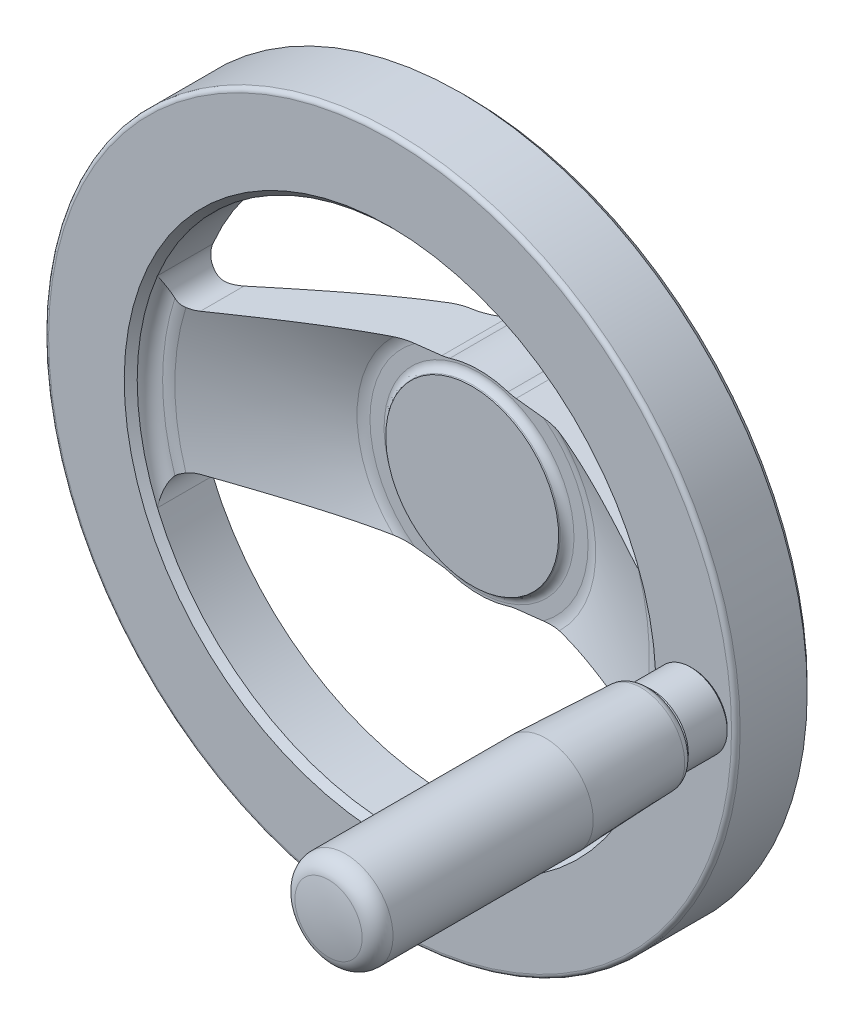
ISO-10303-21;
HEADER;
FILE_DESCRIPTION(('STEP AP214'),'2;1');
FILE_NAME('part.step','',(''),(''),'','','');
FILE_SCHEMA(('AUTOMOTIVE_DESIGN { 1 0 10303 214 1 1 1 1 }'));
ENDSEC;
DATA;
#1=APPLICATION_CONTEXT('core data for automotive mechanical design processes');
#2=APPLICATION_PROTOCOL_DEFINITION('international standard','automotive_design',2000,#1);
#3=PRODUCT_CONTEXT('',#1,'mechanical');
#4=PRODUCT('Part','Part','',(#3));
#5=PRODUCT_RELATED_PRODUCT_CATEGORY('part','',(#4));
#6=PRODUCT_DEFINITION_FORMATION('','',#4);
#7=PRODUCT_DEFINITION_CONTEXT('part definition',#1,'design');
#8=PRODUCT_DEFINITION('design','',#6,#7);
#9=PRODUCT_DEFINITION_SHAPE('','',#8);
#10=(LENGTH_UNIT() NAMED_UNIT(*) SI_UNIT(.MILLI.,.METRE.));
#11=(NAMED_UNIT(*) PLANE_ANGLE_UNIT() SI_UNIT($,.RADIAN.));
#12=(NAMED_UNIT(*) SI_UNIT($,.STERADIAN.) SOLID_ANGLE_UNIT());
#13=UNCERTAINTY_MEASURE_WITH_UNIT(LENGTH_MEASURE(1.E-05),#10,'distance_accuracy_value','');
#14=(GEOMETRIC_REPRESENTATION_CONTEXT(3) GLOBAL_UNCERTAINTY_ASSIGNED_CONTEXT((#13)) GLOBAL_UNIT_ASSIGNED_CONTEXT((#10,
#11,#12)) REPRESENTATION_CONTEXT('',''));
#15=CARTESIAN_POINT('',(0.,0.,0.));
#16=DIRECTION('',(0.,0.,1.));
#17=DIRECTION('',(1.,0.,0.));
#18=AXIS2_PLACEMENT_3D('',#15,#16,#17);
#19=CARTESIAN_POINT('',(0.,0.,21.829634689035));
#20=DIRECTION('',(0.,0.,-1.));
#21=DIRECTION('',(0.,1.,0.));
#22=AXIS2_PLACEMENT_3D('',#19,#20,#21);
#23=TOROIDAL_SURFACE('',#22,24.9629876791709,5.00000000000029);
#24=CARTESIAN_POINT('',(19.4327877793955,19.8404974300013,17.6932115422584));
#25=CARTESIAN_POINT('',(19.2942455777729,19.8562865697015,17.6350509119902));
#26=CARTESIAN_POINT('',(19.154225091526,19.872244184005,17.5805806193));
#27=CARTESIAN_POINT('',(18.8717748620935,19.904433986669,17.4785768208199));
#28=CARTESIAN_POINT('',(18.7293461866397,19.9206660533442,17.4310403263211));
#29=CARTESIAN_POINT('',(18.2996924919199,19.9696320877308,17.2982832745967));
#30=CARTESIAN_POINT('',(18.0095103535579,20.0027030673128,17.2226734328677));
#31=CARTESIAN_POINT('',(17.4275078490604,20.0690317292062,17.0945050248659));
#32=CARTESIAN_POINT('',(17.1357367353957,20.1022837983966,17.0417125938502));
#33=CARTESIAN_POINT('',(16.5493793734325,20.1691087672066,16.9550776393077));
#34=CARTESIAN_POINT('',(16.2547923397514,20.2026817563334,16.9212405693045));
#35=CARTESIAN_POINT('',(15.8061737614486,20.2538091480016,16.8822546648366));
#36=CARTESIAN_POINT('',(15.6526170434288,20.2713094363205,16.8711333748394));
#37=CARTESIAN_POINT('',(15.3448312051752,20.3063866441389,16.852944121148));
#38=CARTESIAN_POINT('',(15.1906014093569,20.3239636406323,16.8458876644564));
#39=CARTESIAN_POINT('',(15.0363074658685,20.3415479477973,16.8407123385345));
#40=B_SPLINE_CURVE_WITH_KNOTS('',3,(#24,#25,#26,#27,#28,#29,#30,#31,#32,#33,#34,#35,#36,#37,#38,
#39),.UNSPECIFIED.,.F.,.F.,(4,2,2,2,2,2,2,4),(0.,0.453117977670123,0.906040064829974,
1.80996987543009,2.70440158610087,3.59909049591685,4.06389763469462,4.53001419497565),.UNSPECIFIED.);
#41=CARTESIAN_POINT('',(19.432311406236,19.8405517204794,17.6930115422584));
#42=VERTEX_POINT('',#41);
#43=CARTESIAN_POINT('',(15.0422455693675,20.3408712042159,16.840912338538));
#44=VERTEX_POINT('',#43);
#45=EDGE_CURVE('E290',#42,#44,#40,.T.);
#46=ORIENTED_EDGE('',*,*,#45,.F.);
#47=CARTESIAN_POINT('',(0.,0.,17.6930115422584));
#48=DIRECTION('',(0.,0.,-1.));
#49=DIRECTION('',(0.,1.,0.));
#50=AXIS2_PLACEMENT_3D('',#47,#48,#49);
#51=CIRCLE('',#50,27.7716081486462);
#52=CARTESIAN_POINT('',(19.432311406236,-19.8405517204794,17.6930115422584));
#53=VERTEX_POINT('',#52);
#54=EDGE_CURVE('E289',#42,#53,#51,.T.);
#55=ORIENTED_EDGE('',*,*,#54,.T.);
#56=CARTESIAN_POINT('',(19.4327877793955,-19.8404974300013,17.6932115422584));
#57=CARTESIAN_POINT('',(19.2942455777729,-19.8562865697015,17.6350509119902));
#58=CARTESIAN_POINT('',(19.154225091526,-19.872244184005,17.5805806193));
#59=CARTESIAN_POINT('',(18.8717748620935,-19.904433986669,17.4785768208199));
#60=CARTESIAN_POINT('',(18.7293461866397,-19.9206660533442,17.4310403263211));
#61=CARTESIAN_POINT('',(18.2996924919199,-19.9696320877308,17.2982832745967));
#62=CARTESIAN_POINT('',(18.0095103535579,-20.0027030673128,17.2226734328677));
#63=CARTESIAN_POINT('',(17.4275078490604,-20.0690317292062,17.0945050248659));
#64=CARTESIAN_POINT('',(17.1357367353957,-20.1022837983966,17.0417125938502));
#65=CARTESIAN_POINT('',(16.5493793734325,-20.1691087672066,16.9550776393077));
#66=CARTESIAN_POINT('',(16.2547923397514,-20.2026817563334,16.9212405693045));
#67=CARTESIAN_POINT('',(15.8061737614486,-20.2538091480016,16.8822546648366));
#68=CARTESIAN_POINT('',(15.6526170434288,-20.2713094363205,16.8711333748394));
#69=CARTESIAN_POINT('',(15.3448312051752,-20.3063866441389,16.852944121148));
#70=CARTESIAN_POINT('',(15.1906014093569,-20.3239636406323,16.8458876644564));
#71=CARTESIAN_POINT('',(15.0363074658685,-20.3415479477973,16.8407123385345));
#72=B_SPLINE_CURVE_WITH_KNOTS('',3,(#56,#57,#58,#59,#60,#61,#62,#63,#64,#65,#66,#67,#68,#69,#70,
#71),.UNSPECIFIED.,.F.,.F.,(4,2,2,2,2,2,2,4),(0.,0.453117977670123,0.906040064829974,
1.80996987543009,2.70440158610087,3.59909049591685,4.06389763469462,4.53001419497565),.UNSPECIFIED.);
#73=CARTESIAN_POINT('',(15.042245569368,-20.3408712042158,16.8409123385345));
#74=VERTEX_POINT('',#73);
#75=EDGE_CURVE('E440',#53,#74,#72,.T.);
#76=ORIENTED_EDGE('',*,*,#75,.T.);
#77=CARTESIAN_POINT('',(0.,0.,16.8409123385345));
#78=DIRECTION('',(0.,0.,-1.));
#79=DIRECTION('',(0.,1.,0.));
#80=AXIS2_PLACEMENT_3D('',#77,#78,#79);
#81=CIRCLE('',#80,25.29862037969);
#82=EDGE_CURVE('E791',#44,#74,#81,.T.);
#83=ORIENTED_EDGE('',*,*,#82,.F.);
#84=EDGE_LOOP('',(#46,#55,#76,#83));
#85=FACE_BOUND('',#84,.T.);
#86=ADVANCED_FACE('F14',(#85),#23,.T.);
#87=CARTESIAN_POINT('',(0.,0.,13.84767892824));
#88=DIRECTION('',(0.,0.,-1.));
#89=DIRECTION('',(0.,1.,0.));
#90=AXIS2_PLACEMENT_3D('',#87,#88,#89);
#91=TOROIDAL_SURFACE('',#90,25.5000000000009,2.99999999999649);
#92=CARTESIAN_POINT('',(7.62231417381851,21.2347918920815,14.4514484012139));
#93=CARTESIAN_POINT('',(7.70157602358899,21.2177757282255,14.503827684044));
#94=CARTESIAN_POINT('',(7.78116034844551,21.2016968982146,14.5560253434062));
#95=CARTESIAN_POINT('',(7.94095366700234,21.1714412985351,14.6599274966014));
#96=CARTESIAN_POINT('',(8.02116234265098,21.1572636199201,14.7116322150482));
#97=CARTESIAN_POINT('',(8.18226165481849,21.1308210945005,14.8144700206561));
#98=CARTESIAN_POINT('',(8.26315230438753,21.1185562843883,14.8656030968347));
#99=CARTESIAN_POINT('',(8.42567067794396,21.0959622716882,14.9672082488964));
#100=CARTESIAN_POINT('',(8.50729873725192,21.0856340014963,15.0176799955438));
#101=CARTESIAN_POINT('',(8.58928498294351,21.0762911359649,15.0677522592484));
#102=B_SPLINE_CURVE_WITH_KNOTS('',3,(#92,#93,#94,#95,#96,#97,#98,#99,#100,#101),.UNSPECIFIED.,
.F.,.F.,(4,2,2,2,4),(0.,0.289547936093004,0.578956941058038,0.868371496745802,1.15792504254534),.UNSPECIFIED.);
#103=CARTESIAN_POINT('',(7.62261681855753,21.234726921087,14.4516484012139));
#104=VERTEX_POINT('',#103);
#105=CARTESIAN_POINT('',(8.589084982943,21.0763139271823,15.067630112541));
#106=VERTEX_POINT('',#105);
#107=EDGE_CURVE('E912',#104,#106,#102,.T.);
#108=ORIENTED_EDGE('',*,*,#107,.T.);
#109=CARTESIAN_POINT('',(8.5888849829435,21.0763367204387,15.0675079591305));
#110=CARTESIAN_POINT('',(8.65868202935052,21.0683822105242,15.1101016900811));
#111=CARTESIAN_POINT('',(8.72930939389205,21.0603330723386,15.1512815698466));
#112=CARTESIAN_POINT('',(8.87190594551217,21.0440818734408,15.2311669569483));
#113=CARTESIAN_POINT('',(8.94387470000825,21.0358798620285,15.2698732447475));
#114=CARTESIAN_POINT('',(9.08880870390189,21.0193622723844,15.3451543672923));
#115=CARTESIAN_POINT('',(9.16177290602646,21.0110468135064,15.3817312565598));
#116=CARTESIAN_POINT('',(9.30859326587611,20.9943142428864,15.4530366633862));
#117=CARTESIAN_POINT('',(9.38244950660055,20.9858971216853,15.4877650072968));
#118=CARTESIAN_POINT('',(9.6048550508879,20.9605503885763,15.5893389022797));
#119=CARTESIAN_POINT('',(9.75452040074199,20.9434935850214,15.6537161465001));
#120=CARTESIAN_POINT('',(10.0561414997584,20.909118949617,15.7768730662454));
#121=CARTESIAN_POINT('',(10.2080979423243,20.8918010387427,15.8356510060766));
#122=CARTESIAN_POINT('',(10.5116305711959,20.8572085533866,15.9473190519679));
#123=CARTESIAN_POINT('',(10.6631802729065,20.8399369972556,16.0002822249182));
#124=CARTESIAN_POINT('',(10.9677815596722,20.805222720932,16.1015637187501));
#125=CARTESIAN_POINT('',(11.1208329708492,20.7877800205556,16.1498825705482));
#126=CARTESIAN_POINT('',(11.4283647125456,20.7527317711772,16.2420370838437));
#127=CARTESIAN_POINT('',(11.5828458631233,20.7351261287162,16.2858699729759));
#128=CARTESIAN_POINT('',(11.8929991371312,20.6997791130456,16.3690285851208));
#129=CARTESIAN_POINT('',(12.048671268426,20.6820377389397,16.4083542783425));
#130=CARTESIAN_POINT('',(12.436881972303,20.6377948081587,16.5003974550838));
#131=CARTESIAN_POINT('',(12.6700734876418,20.6112188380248,16.550356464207));
#132=CARTESIAN_POINT('',(13.1383281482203,20.5578535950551,16.6396178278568));
#133=CARTESIAN_POINT('',(13.3733901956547,20.5310644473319,16.6789260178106));
#134=CARTESIAN_POINT('',(13.8477088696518,20.4770081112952,16.746450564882));
#135=CARTESIAN_POINT('',(14.0869833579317,20.4497388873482,16.7745422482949));
#136=CARTESIAN_POINT('',(14.4468086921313,20.4087309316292,16.8070256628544));
#137=CARTESIAN_POINT('',(14.5669408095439,20.3950399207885,16.816245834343));
#138=CARTESIAN_POINT('',(14.8074252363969,20.3676328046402,16.8312799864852));
#139=CARTESIAN_POINT('',(14.927777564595,20.3539166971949,16.8370936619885));
#140=CARTESIAN_POINT('',(15.048199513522,20.3401926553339,16.8411123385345));
#141=B_SPLINE_CURVE_WITH_KNOTS('',3,(#109,#110,#111,#112,#113,#114,#115,#116,#117,#118,#119,
#120,#121,#122,#123,#124,#125,#126,#127,#128,#129,#130,#131,#132,#133,#134,#135,#136,#137,#138,
#139,#140),.UNSPECIFIED.,.F.,.F.,(4,2,2,2,2,2,2,2,2,2,2,2,2,2,2,4),(0.,0.246416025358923,
0.492753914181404,0.738850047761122,0.984969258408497,1.47626285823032,1.96770825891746,
2.45202166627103,2.93627964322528,3.4208351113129,3.90539378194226,4.62502420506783,
5.34425955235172,6.07128052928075,6.43502076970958,6.79879358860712),.UNSPECIFIED.);
#142=EDGE_CURVE('E293',#106,#44,#141,.T.);
#143=ORIENTED_EDGE('',*,*,#142,.T.);
#144=ORIENTED_EDGE('',*,*,#82,.T.);
#145=CARTESIAN_POINT('',(8.5888849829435,-21.0763367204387,15.0675079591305));
#146=CARTESIAN_POINT('',(8.65868202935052,-21.0683822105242,15.1101016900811));
#147=CARTESIAN_POINT('',(8.72930939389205,-21.0603330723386,15.1512815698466));
#148=CARTESIAN_POINT('',(8.87190594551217,-21.0440818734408,15.2311669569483));
#149=CARTESIAN_POINT('',(8.94387470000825,-21.0358798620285,15.2698732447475));
#150=CARTESIAN_POINT('',(9.08880870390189,-21.0193622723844,15.3451543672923));
#151=CARTESIAN_POINT('',(9.16177290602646,-21.0110468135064,15.3817312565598));
#152=CARTESIAN_POINT('',(9.30859326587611,-20.9943142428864,15.4530366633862));
#153=CARTESIAN_POINT('',(9.38244950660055,-20.9858971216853,15.4877650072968));
#154=CARTESIAN_POINT('',(9.6048550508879,-20.9605503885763,15.5893389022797));
#155=CARTESIAN_POINT('',(9.75452040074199,-20.9434935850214,15.6537161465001));
#156=CARTESIAN_POINT('',(10.0561414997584,-20.909118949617,15.7768730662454));
#157=CARTESIAN_POINT('',(10.2080979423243,-20.8918010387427,15.8356510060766));
#158=CARTESIAN_POINT('',(10.5116305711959,-20.8572085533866,15.9473190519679));
#159=CARTESIAN_POINT('',(10.6631802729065,-20.8399369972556,16.0002822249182));
#160=CARTESIAN_POINT('',(10.9677815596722,-20.805222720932,16.1015637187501));
#161=CARTESIAN_POINT('',(11.1208329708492,-20.7877800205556,16.1498825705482));
#162=CARTESIAN_POINT('',(11.4283647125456,-20.7527317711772,16.2420370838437));
#163=CARTESIAN_POINT('',(11.5828458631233,-20.7351261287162,16.2858699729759));
#164=CARTESIAN_POINT('',(11.8929991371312,-20.6997791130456,16.3690285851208));
#165=CARTESIAN_POINT('',(12.048671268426,-20.6820377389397,16.4083542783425));
#166=CARTESIAN_POINT('',(12.436881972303,-20.6377948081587,16.5003974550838));
#167=CARTESIAN_POINT('',(12.6700734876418,-20.6112188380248,16.550356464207));
#168=CARTESIAN_POINT('',(13.1383281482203,-20.5578535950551,16.6396178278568));
#169=CARTESIAN_POINT('',(13.3733901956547,-20.5310644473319,16.6789260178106));
#170=CARTESIAN_POINT('',(13.8477088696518,-20.4770081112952,16.746450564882));
#171=CARTESIAN_POINT('',(14.0869833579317,-20.4497388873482,16.7745422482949));
#172=CARTESIAN_POINT('',(14.4468086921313,-20.4087309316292,16.8070256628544));
#173=CARTESIAN_POINT('',(14.5669408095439,-20.3950399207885,16.816245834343));
#174=CARTESIAN_POINT('',(14.8074252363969,-20.3676328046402,16.8312799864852));
#175=CARTESIAN_POINT('',(14.927777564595,-20.3539166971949,16.8370936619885));
#176=CARTESIAN_POINT('',(15.048199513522,-20.3401926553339,16.8411123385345));
#177=B_SPLINE_CURVE_WITH_KNOTS('',3,(#145,#146,#147,#148,#149,#150,#151,#152,#153,#154,#155,
#156,#157,#158,#159,#160,#161,#162,#163,#164,#165,#166,#167,#168,#169,#170,#171,#172,#173,#174,
#175,#176),.UNSPECIFIED.,.F.,.F.,(4,2,2,2,2,2,2,2,2,2,2,2,2,2,2,4),(0.,0.246416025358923,
0.492753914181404,0.738850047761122,0.984969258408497,1.47626285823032,1.96770825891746,
2.45202166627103,2.93627964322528,3.4208351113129,3.90539378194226,4.62502420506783,
5.34425955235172,6.07128052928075,6.43502076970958,6.79879358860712),.UNSPECIFIED.);
#178=CARTESIAN_POINT('',(8.589084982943,-21.0763139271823,15.067630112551));
#179=VERTEX_POINT('',#178);
#180=EDGE_CURVE('E987',#179,#74,#177,.T.);
#181=ORIENTED_EDGE('',*,*,#180,.F.);
#182=CARTESIAN_POINT('',(7.62231417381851,-21.2347918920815,14.4514484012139));
#183=CARTESIAN_POINT('',(7.70157602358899,-21.2177757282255,14.503827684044));
#184=CARTESIAN_POINT('',(7.78116034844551,-21.2016968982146,14.5560253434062));
#185=CARTESIAN_POINT('',(7.94095366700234,-21.1714412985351,14.6599274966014));
#186=CARTESIAN_POINT('',(8.02116234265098,-21.1572636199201,14.7116322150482));
#187=CARTESIAN_POINT('',(8.18226165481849,-21.1308210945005,14.8144700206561));
#188=CARTESIAN_POINT('',(8.26315230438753,-21.1185562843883,14.8656030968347));
#189=CARTESIAN_POINT('',(8.42567067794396,-21.0959622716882,14.9672082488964));
#190=CARTESIAN_POINT('',(8.50729873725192,-21.0856340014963,15.0176799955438));
#191=CARTESIAN_POINT('',(8.58928498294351,-21.0762911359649,15.0677522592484));
#192=B_SPLINE_CURVE_WITH_KNOTS('',3,(#182,#183,#184,#185,#186,#187,#188,#189,#190,#191),
.UNSPECIFIED.,.F.,.F.,(4,2,2,2,4),(0.,0.289547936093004,0.578956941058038,0.868371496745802,
1.15792504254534),.UNSPECIFIED.);
#193=CARTESIAN_POINT('',(7.62261681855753,-21.234726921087,14.4516484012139));
#194=VERTEX_POINT('',#193);
#195=EDGE_CURVE('E1011',#194,#179,#192,.T.);
#196=ORIENTED_EDGE('',*,*,#195,.F.);
#197=CARTESIAN_POINT('',(0.,0.,14.4516484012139));
#198=DIRECTION('',(0.,0.,-1.));
#199=DIRECTION('',(0.,1.,0.));
#200=AXIS2_PLACEMENT_3D('',#197,#198,#199);
#201=CIRCLE('',#200,22.5614253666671);
#202=EDGE_CURVE('E787',#104,#194,#201,.T.);
#203=ORIENTED_EDGE('',*,*,#202,.F.);
#204=EDGE_LOOP('',(#108,#143,#144,#181,#196,#203));
#205=FACE_BOUND('',#204,.T.);
#206=ADVANCED_FACE('F435',(#205),#91,.F.);
#207=CARTESIAN_POINT('',(-8.58888498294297,21.0763367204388,15.0675079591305));
#208=CARTESIAN_POINT('',(-8.65868202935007,21.0683822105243,15.110101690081));
#209=CARTESIAN_POINT('',(-8.72930939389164,21.0603330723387,15.1512815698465));
#210=CARTESIAN_POINT('',(-8.87190594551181,21.0440818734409,15.2311669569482));
#211=CARTESIAN_POINT('',(-8.94387470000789,21.0358798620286,15.2698732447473));
#212=CARTESIAN_POINT('',(-9.08880870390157,21.0193622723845,15.3451543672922));
#213=CARTESIAN_POINT('',(-9.16177290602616,21.0110468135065,15.3817312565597));
#214=CARTESIAN_POINT('',(-9.30859326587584,20.9943142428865,15.4530366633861));
#215=CARTESIAN_POINT('',(-9.38244950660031,20.9858971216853,15.4877650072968));
#216=CARTESIAN_POINT('',(-9.60485505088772,20.9605503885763,15.5893389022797));
#217=CARTESIAN_POINT('',(-9.75452040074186,20.9434935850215,15.6537161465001));
#218=CARTESIAN_POINT('',(-10.0561414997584,20.909118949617,15.7768730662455));
#219=CARTESIAN_POINT('',(-10.2080979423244,20.8918010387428,15.8356510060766));
#220=CARTESIAN_POINT('',(-10.511630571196,20.8572085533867,15.9473190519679));
#221=CARTESIAN_POINT('',(-10.6631802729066,20.8399369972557,16.0002822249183));
#222=CARTESIAN_POINT('',(-10.9677815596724,20.805222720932,16.1015637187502));
#223=CARTESIAN_POINT('',(-11.1208329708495,20.7877800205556,16.1498825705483));
#224=CARTESIAN_POINT('',(-11.428364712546,20.7527317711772,16.2420370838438));
#225=CARTESIAN_POINT('',(-11.5828458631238,20.7351261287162,16.285869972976));
#226=CARTESIAN_POINT('',(-11.8929991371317,20.6997791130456,16.369028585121));
#227=CARTESIAN_POINT('',(-12.0486712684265,20.6820377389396,16.4083542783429));
#228=CARTESIAN_POINT('',(-12.4368819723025,20.6377948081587,16.5003974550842));
#229=CARTESIAN_POINT('',(-12.6700734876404,20.611218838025,16.5503564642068));
#230=CARTESIAN_POINT('',(-13.1383281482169,20.5578535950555,16.6396178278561));
#231=CARTESIAN_POINT('',(-13.3733901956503,20.5310644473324,16.6789260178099));
#232=CARTESIAN_POINT('',(-13.8477088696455,20.477008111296,16.7464505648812));
#233=CARTESIAN_POINT('',(-14.0869833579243,20.4497388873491,16.7745422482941));
#234=CARTESIAN_POINT('',(-14.4468086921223,20.4087309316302,16.8070256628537));
#235=CARTESIAN_POINT('',(-14.5669408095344,20.3950399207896,16.8162458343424));
#236=CARTESIAN_POINT('',(-14.8074252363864,20.3676328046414,16.8312799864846));
#237=CARTESIAN_POINT('',(-14.927777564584,20.3539166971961,16.837093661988));
#238=CARTESIAN_POINT('',(-15.0481995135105,20.3401926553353,16.841112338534));
#239=B_SPLINE_CURVE_WITH_KNOTS('',3,(#207,#208,#209,#210,#211,#212,#213,#214,#215,#216,#217,
#218,#219,#220,#221,#222,#223,#224,#225,#226,#227,#228,#229,#230,#231,#232,#233,#234,#235,#236,
#237,#238),.UNSPECIFIED.,.F.,.F.,(4,2,2,2,2,2,2,2,2,2,2,2,2,2,2,4),(0.,0.246416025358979,
0.492753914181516,0.738850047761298,0.984969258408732,1.47626285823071,1.96770825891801,
2.45202166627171,2.93627964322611,3.42083511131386,3.90539378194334,4.62502420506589,
5.34425955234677,6.0712805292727,6.43502076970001,6.79879358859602),.UNSPECIFIED.);
#240=CARTESIAN_POINT('',(-8.58908498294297,21.0763139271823,15.067630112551));
#241=VERTEX_POINT('',#240);
#242=CARTESIAN_POINT('',(-15.0422455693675,20.3408712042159,16.840912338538));
#243=VERTEX_POINT('',#242);
#244=EDGE_CURVE('E340',#241,#243,#239,.T.);
#245=ORIENTED_EDGE('',*,*,#244,.F.);
#246=CARTESIAN_POINT('',(-8.58928498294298,21.0762911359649,15.0677522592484));
#247=CARTESIAN_POINT('',(-8.50729873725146,21.0856340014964,15.0176799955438));
#248=CARTESIAN_POINT('',(-8.42567067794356,21.0959622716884,14.9672082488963));
#249=CARTESIAN_POINT('',(-8.26315230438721,21.1185562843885,14.8656030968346));
#250=CARTESIAN_POINT('',(-8.1822616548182,21.1308210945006,14.8144700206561));
#251=CARTESIAN_POINT('',(-8.02116234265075,21.1572636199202,14.7116322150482));
#252=CARTESIAN_POINT('',(-7.94095366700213,21.1714412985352,14.6599274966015));
#253=CARTESIAN_POINT('',(-7.78116034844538,21.2016968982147,14.5560253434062));
#254=CARTESIAN_POINT('',(-7.70157602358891,21.2177757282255,14.503827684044));
#255=CARTESIAN_POINT('',(-7.62231417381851,21.2347918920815,14.4514484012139));
#256=B_SPLINE_CURVE_WITH_KNOTS('',3,(#246,#247,#248,#249,#250,#251,#252,#253,#254,#255),
.UNSPECIFIED.,.F.,.F.,(4,2,2,2,4),(0.,0.289553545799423,0.578968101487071,0.868377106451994,
1.15792504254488),.UNSPECIFIED.);
#257=CARTESIAN_POINT('',(-7.622616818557,21.234726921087,14.4516484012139));
#258=VERTEX_POINT('',#257);
#259=EDGE_CURVE('E890',#241,#258,#256,.T.);
#260=ORIENTED_EDGE('',*,*,#259,.T.);
#261=CARTESIAN_POINT('',(-7.622616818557,-21.234726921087,14.4516484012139));
#262=VERTEX_POINT('',#261);
#263=EDGE_CURVE('E788',#262,#258,#201,.T.);
#264=ORIENTED_EDGE('',*,*,#263,.F.);
#265=CARTESIAN_POINT('',(-8.58928498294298,-21.0762911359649,15.0677522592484));
#266=CARTESIAN_POINT('',(-8.50729873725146,-21.0856340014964,15.0176799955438));
#267=CARTESIAN_POINT('',(-8.42567067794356,-21.0959622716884,14.9672082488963));
#268=CARTESIAN_POINT('',(-8.26315230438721,-21.1185562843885,14.8656030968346));
#269=CARTESIAN_POINT('',(-8.1822616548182,-21.1308210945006,14.8144700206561));
#270=CARTESIAN_POINT('',(-8.02116234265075,-21.1572636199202,14.7116322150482));
#271=CARTESIAN_POINT('',(-7.94095366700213,-21.1714412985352,14.6599274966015));
#272=CARTESIAN_POINT('',(-7.78116034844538,-21.2016968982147,14.5560253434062));
#273=CARTESIAN_POINT('',(-7.70157602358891,-21.2177757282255,14.503827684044));
#274=CARTESIAN_POINT('',(-7.62231417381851,-21.2347918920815,14.4514484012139));
#275=B_SPLINE_CURVE_WITH_KNOTS('',3,(#265,#266,#267,#268,#269,#270,#271,#272,#273,#274),
.UNSPECIFIED.,.F.,.F.,(4,2,2,2,4),(0.,0.289553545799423,0.578968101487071,0.868377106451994,
1.15792504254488),.UNSPECIFIED.);
#276=CARTESIAN_POINT('',(-8.58908498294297,-21.0763139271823,15.067630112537));
#277=VERTEX_POINT('',#276);
#278=EDGE_CURVE('E840',#277,#262,#275,.T.);
#279=ORIENTED_EDGE('',*,*,#278,.F.);
#280=CARTESIAN_POINT('',(-8.58888498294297,-21.0763367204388,15.0675079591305));
#281=CARTESIAN_POINT('',(-8.65868202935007,-21.0683822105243,15.110101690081));
#282=CARTESIAN_POINT('',(-8.72930939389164,-21.0603330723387,15.1512815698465));
#283=CARTESIAN_POINT('',(-8.87190594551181,-21.0440818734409,15.2311669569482));
#284=CARTESIAN_POINT('',(-8.94387470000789,-21.0358798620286,15.2698732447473));
#285=CARTESIAN_POINT('',(-9.08880870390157,-21.0193622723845,15.3451543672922));
#286=CARTESIAN_POINT('',(-9.16177290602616,-21.0110468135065,15.3817312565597));
#287=CARTESIAN_POINT('',(-9.30859326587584,-20.9943142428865,15.4530366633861));
#288=CARTESIAN_POINT('',(-9.38244950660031,-20.9858971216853,15.4877650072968));
#289=CARTESIAN_POINT('',(-9.60485505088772,-20.9605503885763,15.5893389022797));
#290=CARTESIAN_POINT('',(-9.75452040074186,-20.9434935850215,15.6537161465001));
#291=CARTESIAN_POINT('',(-10.0561414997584,-20.909118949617,15.7768730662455));
#292=CARTESIAN_POINT('',(-10.2080979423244,-20.8918010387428,15.8356510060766));
#293=CARTESIAN_POINT('',(-10.511630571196,-20.8572085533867,15.9473190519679));
#294=CARTESIAN_POINT('',(-10.6631802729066,-20.8399369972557,16.0002822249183));
#295=CARTESIAN_POINT('',(-10.9677815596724,-20.805222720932,16.1015637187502));
#296=CARTESIAN_POINT('',(-11.1208329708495,-20.7877800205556,16.1498825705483));
#297=CARTESIAN_POINT('',(-11.428364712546,-20.7527317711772,16.2420370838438));
#298=CARTESIAN_POINT('',(-11.5828458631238,-20.7351261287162,16.285869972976));
#299=CARTESIAN_POINT('',(-11.8929991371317,-20.6997791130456,16.369028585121));
#300=CARTESIAN_POINT('',(-12.0486712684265,-20.6820377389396,16.4083542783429));
#301=CARTESIAN_POINT('',(-12.4368819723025,-20.6377948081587,16.5003974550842));
#302=CARTESIAN_POINT('',(-12.6700734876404,-20.611218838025,16.5503564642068));
#303=CARTESIAN_POINT('',(-13.1383281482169,-20.5578535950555,16.6396178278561));
#304=CARTESIAN_POINT('',(-13.3733901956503,-20.5310644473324,16.6789260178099));
#305=CARTESIAN_POINT('',(-13.8477088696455,-20.477008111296,16.7464505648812));
#306=CARTESIAN_POINT('',(-14.0869833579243,-20.4497388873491,16.7745422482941));
#307=CARTESIAN_POINT('',(-14.4468086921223,-20.4087309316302,16.8070256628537));
#308=CARTESIAN_POINT('',(-14.5669408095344,-20.3950399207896,16.8162458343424));
#309=CARTESIAN_POINT('',(-14.8074252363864,-20.3676328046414,16.8312799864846));
#310=CARTESIAN_POINT('',(-14.927777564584,-20.3539166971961,16.837093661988));
#311=CARTESIAN_POINT('',(-15.0481995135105,-20.3401926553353,16.841112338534));
#312=B_SPLINE_CURVE_WITH_KNOTS('',3,(#280,#281,#282,#283,#284,#285,#286,#287,#288,#289,#290,
#291,#292,#293,#294,#295,#296,#297,#298,#299,#300,#301,#302,#303,#304,#305,#306,#307,#308,#309,
#310,#311),.UNSPECIFIED.,.F.,.F.,(4,2,2,2,2,2,2,2,2,2,2,2,2,2,2,4),(0.,0.246416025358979,
0.492753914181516,0.738850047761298,0.984969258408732,1.47626285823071,1.96770825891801,
2.45202166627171,2.93627964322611,3.42083511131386,3.90539378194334,4.62502420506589,
5.34425955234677,6.0712805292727,6.43502076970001,6.79879358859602),.UNSPECIFIED.);
#313=CARTESIAN_POINT('',(-15.0422455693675,-20.3408712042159,16.8409123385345));
#314=VERTEX_POINT('',#313);
#315=EDGE_CURVE('E456',#277,#314,#312,.T.);
#316=ORIENTED_EDGE('',*,*,#315,.T.);
#317=EDGE_CURVE('E792',#314,#243,#81,.T.);
#318=ORIENTED_EDGE('',*,*,#317,.T.);
#319=EDGE_LOOP('',(#245,#260,#264,#279,#316,#318));
#320=FACE_BOUND('',#319,.T.);
#321=ADVANCED_FACE('F894',(#320),#91,.F.);
#322=CARTESIAN_POINT('',(-25.2252640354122,0.,30.423968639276));
#323=DIRECTION('',(0.,0.,1.));
#324=DIRECTION('',(0.,-1.,0.));
#325=AXIS2_PLACEMENT_3D('',#322,#323,#324);
#326=PLANE('',#325);
#327=CARTESIAN_POINT('',(0.,0.,30.423968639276));
#328=DIRECTION('',(0.,0.,-1.));
#329=DIRECTION('',(0.,1.,0.));
#330=AXIS2_PLACEMENT_3D('',#327,#328,#329);
#331=CIRCLE('',#330,21.9723067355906);
#332=CARTESIAN_POINT('',(0.,21.9723067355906,30.423968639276));
#333=VERTEX_POINT('',#332);
#334=EDGE_CURVE('E769',#333,#333,#331,.T.);
#335=ORIENTED_EDGE('',*,*,#334,.T.);
#336=EDGE_LOOP('',(#335));
#337=FACE_BOUND('',#336,.T.);
#338=CARTESIAN_POINT('',(0.,0.,30.423968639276));
#339=DIRECTION('',(0.,0.,-1.));
#340=DIRECTION('',(0.,1.,0.));
#341=AXIS2_PLACEMENT_3D('',#338,#339,#340);
#342=CIRCLE('',#341,25.2252640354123);
#343=CARTESIAN_POINT('',(14.8957521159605,20.3575665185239,30.423968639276));
#344=VERTEX_POINT('',#343);
#345=CARTESIAN_POINT('',(14.8957521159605,-20.3575665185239,30.423968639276));
#346=VERTEX_POINT('',#345);
#347=EDGE_CURVE('E765',#344,#346,#342,.T.);
#348=ORIENTED_EDGE('',*,*,#347,.F.);
#349=DIRECTION('',(-0.99356842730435,0.113233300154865,0.));
#350=VECTOR('',#349,1.);
#351=CARTESIAN_POINT('',(-22.4205125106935,24.6103624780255,30.423968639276));
#352=LINE('',#351,#350);
#353=CARTESIAN_POINT('',(8.589084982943,21.0763139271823,30.423968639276));
#354=VERTEX_POINT('',#353);
#355=EDGE_CURVE('E291',#344,#354,#352,.T.);
#356=ORIENTED_EDGE('',*,*,#355,.T.);
#357=CARTESIAN_POINT('',(9.72141798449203,31.0119982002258,30.423968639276));
#358=DIRECTION('',(0.,0.,1.));
#359=DIRECTION('',(0.,-1.,0.));
#360=AXIS2_PLACEMENT_3D('',#357,#358,#359);
#361=CIRCLE('',#360,10.);
#362=CARTESIAN_POINT('',(6.73021245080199,21.4698449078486,30.423968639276));
#363=VERTEX_POINT('',#362);
#364=EDGE_CURVE('E919',#354,#363,#361,.F.);
#365=ORIENTED_EDGE('',*,*,#364,.T.);
#366=CARTESIAN_POINT('',(0.,0.,30.423968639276));
#367=DIRECTION('',(0.,0.,1.));
#368=DIRECTION('',(0.,-1.,0.));
#369=AXIS2_PLACEMENT_3D('',#366,#367,#368);
#370=CIRCLE('',#369,22.5);
#371=CARTESIAN_POINT('',(-6.73021245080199,21.4698449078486,30.423968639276));
#372=VERTEX_POINT('',#371);
#373=EDGE_CURVE('E899',#372,#363,#370,.F.);
#374=ORIENTED_EDGE('',*,*,#373,.F.);
#375=CARTESIAN_POINT('',(-9.7214179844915,31.0119982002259,30.423968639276));
#376=DIRECTION('',(0.,0.,1.));
#377=DIRECTION('',(0.,-1.,0.));
#378=AXIS2_PLACEMENT_3D('',#375,#376,#377);
#379=CIRCLE('',#378,10.);
#380=CARTESIAN_POINT('',(-8.58908498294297,21.0763139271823,30.423968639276));
#381=VERTEX_POINT('',#380);
#382=EDGE_CURVE('E896',#372,#381,#379,.F.);
#383=ORIENTED_EDGE('',*,*,#382,.T.);
#384=DIRECTION('',(0.993568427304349,0.113233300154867,0.));
#385=VECTOR('',#384,1.);
#386=CARTESIAN_POINT('',(-27.383149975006,18.934424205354,30.423968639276));
#387=LINE('',#386,#385);
#388=CARTESIAN_POINT('',(-14.8957521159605,20.3575665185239,30.423968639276));
#389=VERTEX_POINT('',#388);
#390=EDGE_CURVE('E389',#389,#381,#387,.T.);
#391=ORIENTED_EDGE('',*,*,#390,.F.);
#392=CARTESIAN_POINT('',(-14.8957521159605,-20.3575665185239,30.423968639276));
#393=VERTEX_POINT('',#392);
#394=EDGE_CURVE('E766',#393,#389,#342,.T.);
#395=ORIENTED_EDGE('',*,*,#394,.F.);
#396=DIRECTION('',(0.993568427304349,-0.113233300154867,0.));
#397=VECTOR('',#396,1.);
#398=CARTESIAN_POINT('',(-27.383149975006,-18.934424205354,30.423968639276));
#399=LINE('',#398,#397);
#400=CARTESIAN_POINT('',(-8.58908498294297,-21.0763139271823,30.423968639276));
#401=VERTEX_POINT('',#400);
#402=EDGE_CURVE('E975',#393,#401,#399,.T.);
#403=ORIENTED_EDGE('',*,*,#402,.T.);
#404=CARTESIAN_POINT('',(-9.7214179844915,-31.0119982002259,30.423968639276));
#405=DIRECTION('',(0.,0.,1.));
#406=DIRECTION('',(0.,-1.,0.));
#407=AXIS2_PLACEMENT_3D('',#404,#405,#406);
#408=CIRCLE('',#407,10.);
#409=CARTESIAN_POINT('',(-6.73021245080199,-21.4698449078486,30.423968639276));
#410=VERTEX_POINT('',#409);
#411=EDGE_CURVE('E504',#410,#401,#408,.T.);
#412=ORIENTED_EDGE('',*,*,#411,.F.);
#413=CARTESIAN_POINT('',(0.,0.,30.423968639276));
#414=DIRECTION('',(0.,0.,1.));
#415=DIRECTION('',(0.,-1.,0.));
#416=AXIS2_PLACEMENT_3D('',#413,#414,#415);
#417=CIRCLE('',#416,22.5);
#418=CARTESIAN_POINT('',(6.73021245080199,-21.4698449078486,30.423968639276));
#419=VERTEX_POINT('',#418);
#420=EDGE_CURVE('E501',#410,#419,#417,.T.);
#421=ORIENTED_EDGE('',*,*,#420,.T.);
#422=CARTESIAN_POINT('',(9.72141798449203,-31.0119982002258,30.423968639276));
#423=DIRECTION('',(0.,0.,1.));
#424=DIRECTION('',(0.,-1.,0.));
#425=AXIS2_PLACEMENT_3D('',#422,#423,#424);
#426=CIRCLE('',#425,10.);
#427=CARTESIAN_POINT('',(8.589084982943,-21.0763139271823,30.423968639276));
#428=VERTEX_POINT('',#427);
#429=EDGE_CURVE('E493',#428,#419,#426,.T.);
#430=ORIENTED_EDGE('',*,*,#429,.F.);
#431=DIRECTION('',(-0.99356842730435,-0.113233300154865,0.));
#432=VECTOR('',#431,1.);
#433=CARTESIAN_POINT('',(-22.4205125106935,-24.6103624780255,30.423968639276));
#434=LINE('',#433,#432);
#435=EDGE_CURVE('E658',#346,#428,#434,.T.);
#436=ORIENTED_EDGE('',*,*,#435,.F.);
#437=EDGE_LOOP('',(#348,#356,#365,#374,#383,#391,#395,#403,#412,#421,#430,#436));
#438=FACE_BOUND('',#437,.T.);
#439=ADVANCED_FACE('F358',(#337,#438),#326,.T.);
#440=CARTESIAN_POINT('',(0.,0.,35.423968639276));
#441=DIRECTION('',(0.,0.,-1.));
#442=DIRECTION('',(0.,1.,0.));
#443=AXIS2_PLACEMENT_3D('',#440,#441,#442);
#444=TOROIDAL_SURFACE('',#443,25.2252640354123,5.);
#445=CARTESIAN_POINT('',(0.,0.,31.0342802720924));
#446=DIRECTION('',(0.,0.,-1.));
#447=DIRECTION('',(0.,1.,0.));
#448=AXIS2_PLACEMENT_3D('',#445,#446,#447);
#449=CIRCLE('',#448,27.6191387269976);
#450=CARTESIAN_POINT('',(19.184583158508,19.8687843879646,31.0342802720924));
#451=VERTEX_POINT('',#450);
#452=CARTESIAN_POINT('',(19.184583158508,-19.8687843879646,31.0342802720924));
#453=VERTEX_POINT('',#452);
#454=EDGE_CURVE('E761',#451,#453,#449,.T.);
#455=ORIENTED_EDGE('',*,*,#454,.F.);
#456=CARTESIAN_POINT('',(19.1851817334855,19.8687161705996,31.0344802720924));
#457=CARTESIAN_POINT('',(19.0272959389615,19.8867098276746,30.9817324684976));
#458=CARTESIAN_POINT('',(18.8680808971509,19.9048549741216,30.9331350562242));
#459=CARTESIAN_POINT('',(18.5475859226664,19.9413805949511,30.8436918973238));
#460=CARTESIAN_POINT('',(18.3863069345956,19.9597609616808,30.8028427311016));
#461=CARTESIAN_POINT('',(18.0624980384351,19.9966642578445,30.7283842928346));
#462=CARTESIAN_POINT('',(17.8999717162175,20.0151867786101,30.6947590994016));
#463=CARTESIAN_POINT('',(17.5736999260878,20.0523707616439,30.6341070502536));
#464=CARTESIAN_POINT('',(17.4099543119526,20.0710322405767,30.6070809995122));
#465=CARTESIAN_POINT('',(16.9212091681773,20.1267327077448,30.5357070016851));
#466=CARTESIAN_POINT('',(16.5949103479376,20.1639197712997,30.5002206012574));
#467=CARTESIAN_POINT('',(15.940702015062,20.2384774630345,30.449559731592));
#468=CARTESIAN_POINT('',(15.612791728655,20.2758481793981,30.4343962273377));
#469=CARTESIAN_POINT('',(14.7507493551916,20.3740919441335,30.4171142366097));
#470=CARTESIAN_POINT('',(14.2163447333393,20.4349960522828,30.4291545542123));
#471=CARTESIAN_POINT('',(13.1491459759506,20.556620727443,30.4867337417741));
#472=CARTESIAN_POINT('',(12.616353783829,20.61734107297,30.5323035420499));
#473=CARTESIAN_POINT('',(11.5425949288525,20.7397133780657,30.6473241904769));
#474=CARTESIAN_POINT('',(11.0016796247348,20.8013594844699,30.7172373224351));
#475=CARTESIAN_POINT('',(10.1924026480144,20.8935897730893,30.8314249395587));
#476=CARTESIAN_POINT('',(9.92334509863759,20.9242532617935,30.8709824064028));
#477=CARTESIAN_POINT('',(9.38552884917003,20.9855461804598,30.9518030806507));
#478=CARTESIAN_POINT('',(9.11677010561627,21.0161756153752,30.9930659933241));
#479=CARTESIAN_POINT('',(8.84803359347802,21.0468025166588,31.034480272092));
#480=B_SPLINE_CURVE_WITH_KNOTS('',3,(#456,#457,#458,#459,#460,#461,#462,#463,#464,#465,#466,
#467,#468,#469,#470,#471,#472,#473,#474,#475,#476,#477,#478,#479),.UNSPECIFIED.,.F.,.F.,(4,2,2,
2,2,2,2,2,2,2,2,4),(0.,0.502188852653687,1.00415555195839,1.5050043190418,2.00591414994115,
2.99604190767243,3.98670366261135,5.59907765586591,7.21294090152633,8.85929296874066,
9.68031453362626,10.5011948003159),.UNSPECIFIED.);
#481=EDGE_CURVE('E296',#451,#344,#480,.T.);
#482=ORIENTED_EDGE('',*,*,#481,.T.);
#483=ORIENTED_EDGE('',*,*,#347,.T.);
#484=CARTESIAN_POINT('',(19.1851817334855,-19.8687161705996,31.0344802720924));
#485=CARTESIAN_POINT('',(19.0272959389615,-19.8867098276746,30.9817324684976));
#486=CARTESIAN_POINT('',(18.8680808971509,-19.9048549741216,30.9331350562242));
#487=CARTESIAN_POINT('',(18.5475859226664,-19.9413805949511,30.8436918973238));
#488=CARTESIAN_POINT('',(18.3863069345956,-19.9597609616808,30.8028427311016));
#489=CARTESIAN_POINT('',(18.0624980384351,-19.9966642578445,30.7283842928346));
#490=CARTESIAN_POINT('',(17.8999717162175,-20.0151867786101,30.6947590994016));
#491=CARTESIAN_POINT('',(17.5736999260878,-20.0523707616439,30.6341070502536));
#492=CARTESIAN_POINT('',(17.4099543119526,-20.0710322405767,30.6070809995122));
#493=CARTESIAN_POINT('',(16.9212091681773,-20.1267327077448,30.5357070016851));
#494=CARTESIAN_POINT('',(16.5949103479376,-20.1639197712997,30.5002206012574));
#495=CARTESIAN_POINT('',(15.940702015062,-20.2384774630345,30.449559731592));
#496=CARTESIAN_POINT('',(15.612791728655,-20.2758481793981,30.4343962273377));
#497=CARTESIAN_POINT('',(14.7507493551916,-20.3740919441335,30.4171142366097));
#498=CARTESIAN_POINT('',(14.2163447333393,-20.4349960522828,30.4291545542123));
#499=CARTESIAN_POINT('',(13.1491459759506,-20.556620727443,30.4867337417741));
#500=CARTESIAN_POINT('',(12.616353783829,-20.61734107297,30.5323035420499));
#501=CARTESIAN_POINT('',(11.5425949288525,-20.7397133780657,30.6473241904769));
#502=CARTESIAN_POINT('',(11.0016796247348,-20.8013594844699,30.7172373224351));
#503=CARTESIAN_POINT('',(10.1924026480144,-20.8935897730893,30.8314249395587));
#504=CARTESIAN_POINT('',(9.92334509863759,-20.9242532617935,30.8709824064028));
#505=CARTESIAN_POINT('',(9.38552884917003,-20.9855461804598,30.9518030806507));
#506=CARTESIAN_POINT('',(9.11677010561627,-21.0161756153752,30.9930659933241));
#507=CARTESIAN_POINT('',(8.84803359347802,-21.0468025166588,31.034480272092));
#508=B_SPLINE_CURVE_WITH_KNOTS('',3,(#484,#485,#486,#487,#488,#489,#490,#491,#492,#493,#494,
#495,#496,#497,#498,#499,#500,#501,#502,#503,#504,#505,#506,#507),.UNSPECIFIED.,.F.,.F.,(4,2,2,
2,2,2,2,2,2,2,2,4),(0.,0.502188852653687,1.00415555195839,1.5050043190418,2.00591414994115,
2.99604190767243,3.98670366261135,5.59907765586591,7.21294090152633,8.85929296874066,
9.68031453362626,10.5011948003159),.UNSPECIFIED.);
#509=EDGE_CURVE('E363',#453,#346,#508,.T.);
#510=ORIENTED_EDGE('',*,*,#509,.F.);
#511=EDGE_LOOP('',(#455,#482,#483,#510));
#512=FACE_BOUND('',#511,.T.);
#513=ADVANCED_FACE('F354',(#512),#444,.F.);
#514=CARTESIAN_POINT('',(0.,0.,31.8590888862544));
#515=DIRECTION('',(0.,0.,-1.));
#516=DIRECTION('',(0.,1.,0.));
#517=AXIS2_PLACEMENT_3D('',#514,#515,#516);
#518=TOROIDAL_SURFACE('',#517,58.7130607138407,5.);
#519=CARTESIAN_POINT('',(0.,0.,36.2377655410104));
#520=DIRECTION('',(0.,0.,-1.));
#521=DIRECTION('',(0.,1.,0.));
#522=AXIS2_PLACEMENT_3D('',#519,#520,#521);
#523=CIRCLE('',#522,61.1270182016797);
#524=CARTESIAN_POINT('',(0.,61.1270182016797,36.2377655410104));
#525=VERTEX_POINT('',#524);
#526=EDGE_CURVE('E808',#525,#525,#523,.T.);
#527=ORIENTED_EDGE('',*,*,#526,.T.);
#528=EDGE_LOOP('',(#527));
#529=FACE_BOUND('',#528,.T.);
#530=CARTESIAN_POINT('',(0.,0.,36.6906297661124));
#531=DIRECTION('',(0.,0.,-1.));
#532=DIRECTION('',(0.,1.,0.));
#533=AXIS2_PLACEMENT_3D('',#530,#531,#532);
#534=CIRCLE('',#533,60.);
#535=CARTESIAN_POINT('',(55.3138038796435,23.2461416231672,36.6906297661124));
#536=VERTEX_POINT('',#535);
#537=CARTESIAN_POINT('',(-55.3138038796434,23.2461416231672,36.6906297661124));
#538=VERTEX_POINT('',#537);
#539=EDGE_CURVE('E630',#536,#538,#534,.F.);
#540=ORIENTED_EDGE('',*,*,#539,.T.);
#541=CARTESIAN_POINT('',(-51.9904799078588,16.4772146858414,34.6118480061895));
#542=CARTESIAN_POINT('',(-52.0607658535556,16.495929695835,34.7220528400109));
#543=CARTESIAN_POINT('',(-52.1348669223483,16.517291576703,34.8294177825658));
#544=CARTESIAN_POINT('',(-52.2898162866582,16.5663027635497,35.037828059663));
#545=CARTESIAN_POINT('',(-52.3706718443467,16.5939588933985,35.1388663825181));
#546=CARTESIAN_POINT('',(-52.5383230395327,16.6566028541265,35.3340116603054));
#547=CARTESIAN_POINT('',(-52.6251345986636,16.6916108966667,35.4280985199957));
#548=CARTESIAN_POINT('',(-52.8032461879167,16.7698047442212,35.6082167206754));
#549=CARTESIAN_POINT('',(-52.8945438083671,16.8129861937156,35.6942523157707));
#550=CARTESIAN_POINT('',(-53.0643228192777,16.9001234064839,35.8435882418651));
#551=CARTESIAN_POINT('',(-53.1423207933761,16.9426795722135,35.9082585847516));
#552=CARTESIAN_POINT('',(-53.29952372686,17.0342481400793,36.0312409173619));
#553=CARTESIAN_POINT('',(-53.3787284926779,17.0832595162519,36.0895539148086));
#554=CARTESIAN_POINT('',(-53.5371508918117,17.1877919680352,36.1994090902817));
#555=CARTESIAN_POINT('',(-53.6163679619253,17.2432958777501,36.2509683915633));
#556=CARTESIAN_POINT('',(-53.7739801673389,17.3609438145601,36.3473317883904));
#557=CARTESIAN_POINT('',(-53.8523753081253,17.4230877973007,36.3921359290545));
#558=CARTESIAN_POINT('',(-54.0074481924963,17.5540115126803,36.4750458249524));
#559=CARTESIAN_POINT('',(-54.0841222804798,17.6228039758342,36.5131383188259));
#560=CARTESIAN_POINT('',(-54.2345818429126,17.7666356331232,36.5826455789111));
#561=CARTESIAN_POINT('',(-54.3083672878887,17.8416748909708,36.6140602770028));
#562=CARTESIAN_POINT('',(-54.452182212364,17.9976502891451,36.6705139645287));
#563=CARTESIAN_POINT('',(-54.5222084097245,18.078591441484,36.695547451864));
#564=CARTESIAN_POINT('',(-54.6576500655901,18.2458326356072,36.7396255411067));
#565=CARTESIAN_POINT('',(-54.7230637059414,18.33213476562,36.7586677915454));
#566=CARTESIAN_POINT('',(-54.8474655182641,18.5079394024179,36.79098417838));
#567=CARTESIAN_POINT('',(-54.9065466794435,18.5973586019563,36.804354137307));
#568=CARTESIAN_POINT('',(-55.0190778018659,18.7802449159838,36.8263762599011));
#569=CARTESIAN_POINT('',(-55.0725257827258,18.8737134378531,36.8350267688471));
#570=CARTESIAN_POINT('',(-55.2237436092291,19.1592879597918,36.8547964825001));
#571=CARTESIAN_POINT('',(-55.3124869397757,19.3567034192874,36.8597574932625));
#572=CARTESIAN_POINT('',(-55.4728017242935,19.7857118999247,36.8581850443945));
#573=CARTESIAN_POINT('',(-55.540985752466,20.0185463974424,36.850184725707));
#574=CARTESIAN_POINT('',(-55.6429582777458,20.4914330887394,36.8266985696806));
#575=CARTESIAN_POINT('',(-55.67672474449,20.7314898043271,36.8112079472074));
#576=CARTESIAN_POINT('',(-55.7022049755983,21.1091209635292,36.7858338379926));
#577=CARTESIAN_POINT('',(-55.705799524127,21.2460391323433,36.7764284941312));
#578=CARTESIAN_POINT('',(-55.7017472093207,21.5197825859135,36.7581001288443));
#579=CARTESIAN_POINT('',(-55.6940993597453,21.6566078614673,36.7491771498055));
#580=CARTESIAN_POINT('',(-55.6675875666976,21.9292367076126,36.7326467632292));
#581=CARTESIAN_POINT('',(-55.6487241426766,22.0650403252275,36.7250392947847));
#582=CARTESIAN_POINT('',(-55.5998869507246,22.3347326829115,36.7118048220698));
#583=CARTESIAN_POINT('',(-55.5699135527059,22.468621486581,36.7061777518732));
#584=CARTESIAN_POINT('',(-55.4982982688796,22.7363280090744,36.6972932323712));
#585=CARTESIAN_POINT('',(-55.456425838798,22.8700858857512,36.6940877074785));
#586=CARTESIAN_POINT('',(-55.3615846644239,23.1336571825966,36.690519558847));
#587=CARTESIAN_POINT('',(-55.3086152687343,23.2634703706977,36.6901571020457));
#588=CARTESIAN_POINT('',(-55.1918366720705,23.5184640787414,36.6923229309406));
#589=CARTESIAN_POINT('',(-55.1280025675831,23.6436331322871,36.6948579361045));
#590=CARTESIAN_POINT('',(-54.9900811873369,23.8881101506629,36.7025571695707));
#591=CARTESIAN_POINT('',(-54.9159935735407,24.0074179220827,36.707721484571));
#592=CARTESIAN_POINT('',(-54.8370317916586,24.123336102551,36.7140641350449));
#593=B_SPLINE_CURVE_WITH_KNOTS('',3,(#541,#542,#543,#544,#545,#546,#547,#548,#549,#550,#551,
#552,#553,#554,#555,#556,#557,#558,#559,#560,#561,#562,#563,#564,#565,#566,#567,#568,#569,#570,
#571,#572,#573,#574,#575,#576,#577,#578,#579,#580,#581,#582,#583,#584,#585,#586,#587,#588,#589,
#590,#591,#592),.UNSPECIFIED.,.F.,.F.,(4,2,2,2,2,2,2,2,2,2,2,2,2,2,2,2,2,2,2,2,2,2,2,2,2,4),(0.,
0.396075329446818,0.792582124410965,1.19019359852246,1.58759378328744,1.91692302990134,
2.24619999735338,2.57462525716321,2.90304832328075,3.23211320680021,3.56118144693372,
3.89053246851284,4.22001259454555,4.54368079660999,4.86746240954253,5.51450956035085,
6.24002238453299,6.96599931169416,7.37746917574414,7.78897513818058,8.20046204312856,
8.6119352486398,9.03199898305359,9.45208738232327,9.87315198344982,10.2942304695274),.UNSPECIFIED.);
#594=CARTESIAN_POINT('',(-55.373268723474,19.519851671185,36.8590888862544));
#595=VERTEX_POINT('',#594);
#596=EDGE_CURVE('E390',#538,#595,#593,.F.);
#597=ORIENTED_EDGE('',*,*,#596,.T.);
#598=CARTESIAN_POINT('',(0.,0.,36.8590888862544));
#599=DIRECTION('',(0.,0.,-1.));
#600=DIRECTION('',(0.,1.,0.));
#601=AXIS2_PLACEMENT_3D('',#598,#599,#600);
#602=CIRCLE('',#601,58.7130607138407);
#603=CARTESIAN_POINT('',(-55.373268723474,-19.519851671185,36.8590888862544));
#604=VERTEX_POINT('',#603);
#605=EDGE_CURVE('E805',#604,#595,#602,.T.);
#606=ORIENTED_EDGE('',*,*,#605,.F.);
#607=CARTESIAN_POINT('',(-51.9904799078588,-16.4772146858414,34.6118480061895));
#608=CARTESIAN_POINT('',(-52.0607658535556,-16.495929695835,34.7220528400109));
#609=CARTESIAN_POINT('',(-52.1348669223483,-16.517291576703,34.8294177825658));
#610=CARTESIAN_POINT('',(-52.2898162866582,-16.5663027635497,35.037828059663));
#611=CARTESIAN_POINT('',(-52.3706718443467,-16.5939588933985,35.1388663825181));
#612=CARTESIAN_POINT('',(-52.5383230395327,-16.6566028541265,35.3340116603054));
#613=CARTESIAN_POINT('',(-52.6251345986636,-16.6916108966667,35.4280985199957));
#614=CARTESIAN_POINT('',(-52.8032461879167,-16.7698047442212,35.6082167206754));
#615=CARTESIAN_POINT('',(-52.8945438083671,-16.8129861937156,35.6942523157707));
#616=CARTESIAN_POINT('',(-53.0643228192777,-16.9001234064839,35.8435882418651));
#617=CARTESIAN_POINT('',(-53.1423207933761,-16.9426795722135,35.9082585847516));
#618=CARTESIAN_POINT('',(-53.29952372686,-17.0342481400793,36.0312409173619));
#619=CARTESIAN_POINT('',(-53.3787284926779,-17.0832595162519,36.0895539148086));
#620=CARTESIAN_POINT('',(-53.5371508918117,-17.1877919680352,36.1994090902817));
#621=CARTESIAN_POINT('',(-53.6163679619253,-17.2432958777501,36.2509683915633));
#622=CARTESIAN_POINT('',(-53.7739801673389,-17.3609438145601,36.3473317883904));
#623=CARTESIAN_POINT('',(-53.8523753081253,-17.4230877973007,36.3921359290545));
#624=CARTESIAN_POINT('',(-54.0074481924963,-17.5540115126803,36.4750458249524));
#625=CARTESIAN_POINT('',(-54.0841222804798,-17.6228039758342,36.5131383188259));
#626=CARTESIAN_POINT('',(-54.2345818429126,-17.7666356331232,36.5826455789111));
#627=CARTESIAN_POINT('',(-54.3083672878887,-17.8416748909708,36.6140602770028));
#628=CARTESIAN_POINT('',(-54.452182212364,-17.9976502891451,36.6705139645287));
#629=CARTESIAN_POINT('',(-54.5222084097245,-18.078591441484,36.695547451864));
#630=CARTESIAN_POINT('',(-54.6576500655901,-18.2458326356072,36.7396255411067));
#631=CARTESIAN_POINT('',(-54.7230637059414,-18.33213476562,36.7586677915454));
#632=CARTESIAN_POINT('',(-54.8474655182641,-18.5079394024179,36.79098417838));
#633=CARTESIAN_POINT('',(-54.9065466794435,-18.5973586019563,36.804354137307));
#634=CARTESIAN_POINT('',(-55.0190778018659,-18.7802449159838,36.8263762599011));
#635=CARTESIAN_POINT('',(-55.0725257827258,-18.8737134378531,36.8350267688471));
#636=CARTESIAN_POINT('',(-55.2237436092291,-19.1592879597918,36.8547964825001));
#637=CARTESIAN_POINT('',(-55.3124869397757,-19.3567034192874,36.8597574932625));
#638=CARTESIAN_POINT('',(-55.4728017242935,-19.7857118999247,36.8581850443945));
#639=CARTESIAN_POINT('',(-55.540985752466,-20.0185463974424,36.850184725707));
#640=CARTESIAN_POINT('',(-55.6429582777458,-20.4914330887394,36.8266985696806));
#641=CARTESIAN_POINT('',(-55.67672474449,-20.7314898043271,36.8112079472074));
#642=CARTESIAN_POINT('',(-55.7022049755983,-21.1091209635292,36.7858338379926));
#643=CARTESIAN_POINT('',(-55.705799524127,-21.2460391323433,36.7764284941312));
#644=CARTESIAN_POINT('',(-55.7017472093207,-21.5197825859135,36.7581001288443));
#645=CARTESIAN_POINT('',(-55.6940993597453,-21.6566078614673,36.7491771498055));
#646=CARTESIAN_POINT('',(-55.6675875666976,-21.9292367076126,36.7326467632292));
#647=CARTESIAN_POINT('',(-55.6487241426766,-22.0650403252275,36.7250392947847));
#648=CARTESIAN_POINT('',(-55.5998869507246,-22.3347326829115,36.7118048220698));
#649=CARTESIAN_POINT('',(-55.5699135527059,-22.468621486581,36.7061777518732));
#650=CARTESIAN_POINT('',(-55.4982982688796,-22.7363280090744,36.6972932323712));
#651=CARTESIAN_POINT('',(-55.456425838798,-22.8700858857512,36.6940877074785));
#652=CARTESIAN_POINT('',(-55.3615846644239,-23.1336571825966,36.690519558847));
#653=CARTESIAN_POINT('',(-55.3086152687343,-23.2634703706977,36.6901571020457));
#654=CARTESIAN_POINT('',(-55.1918366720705,-23.5184640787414,36.6923229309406));
#655=CARTESIAN_POINT('',(-55.1280025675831,-23.6436331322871,36.6948579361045));
#656=CARTESIAN_POINT('',(-54.9900811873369,-23.8881101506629,36.7025571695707));
#657=CARTESIAN_POINT('',(-54.9159935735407,-24.0074179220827,36.707721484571));
#658=CARTESIAN_POINT('',(-54.8370317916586,-24.123336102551,36.7140641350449));
#659=B_SPLINE_CURVE_WITH_KNOTS('',3,(#607,#608,#609,#610,#611,#612,#613,#614,#615,#616,#617,
#618,#619,#620,#621,#622,#623,#624,#625,#626,#627,#628,#629,#630,#631,#632,#633,#634,#635,#636,
#637,#638,#639,#640,#641,#642,#643,#644,#645,#646,#647,#648,#649,#650,#651,#652,#653,#654,#655,
#656,#657,#658),.UNSPECIFIED.,.F.,.F.,(4,2,2,2,2,2,2,2,2,2,2,2,2,2,2,2,2,2,2,2,2,2,2,2,2,4),(0.,
0.396075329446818,0.792582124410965,1.19019359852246,1.58759378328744,1.91692302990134,
2.24619999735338,2.57462525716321,2.90304832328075,3.23211320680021,3.56118144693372,
3.89053246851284,4.22001259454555,4.54368079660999,4.86746240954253,5.51450956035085,
6.24002238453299,6.96599931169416,7.37746917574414,7.78897513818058,8.20046204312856,
8.6119352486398,9.03199898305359,9.45208738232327,9.87315198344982,10.2942304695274),.UNSPECIFIED.);
#660=CARTESIAN_POINT('',(-55.3138038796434,-23.2461416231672,36.6906297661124));
#661=VERTEX_POINT('',#660);
#662=EDGE_CURVE('E642',#661,#604,#659,.F.);
#663=ORIENTED_EDGE('',*,*,#662,.F.);
#664=CARTESIAN_POINT('',(0.,0.,36.6906297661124));
#665=DIRECTION('',(0.,0.,-1.));
#666=DIRECTION('',(0.,1.,0.));
#667=AXIS2_PLACEMENT_3D('',#664,#665,#666);
#668=CIRCLE('',#667,60.);
#669=CARTESIAN_POINT('',(55.3138038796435,-23.2461416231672,36.6906297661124));
#670=VERTEX_POINT('',#669);
#671=EDGE_CURVE('E670',#670,#661,#668,.T.);
#672=ORIENTED_EDGE('',*,*,#671,.F.);
#673=CARTESIAN_POINT('',(51.990479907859,-16.4772146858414,34.6118480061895));
#674=CARTESIAN_POINT('',(52.0607658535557,-16.495929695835,34.722052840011));
#675=CARTESIAN_POINT('',(52.1348669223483,-16.5172915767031,34.8294177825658));
#676=CARTESIAN_POINT('',(52.2898162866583,-16.5663027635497,35.0378280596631));
#677=CARTESIAN_POINT('',(52.3706718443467,-16.5939588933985,35.1388663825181));
#678=CARTESIAN_POINT('',(52.5383230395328,-16.6566028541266,35.3340116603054));
#679=CARTESIAN_POINT('',(52.6251345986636,-16.6916108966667,35.4280985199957));
#680=CARTESIAN_POINT('',(52.8032461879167,-16.7698047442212,35.6082167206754));
#681=CARTESIAN_POINT('',(52.8945438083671,-16.8129861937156,35.6942523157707));
#682=CARTESIAN_POINT('',(53.0643228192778,-16.9001234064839,35.8435882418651));
#683=CARTESIAN_POINT('',(53.1423207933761,-16.9426795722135,35.9082585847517));
#684=CARTESIAN_POINT('',(53.29952372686,-17.0342481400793,36.0312409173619));
#685=CARTESIAN_POINT('',(53.3787284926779,-17.0832595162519,36.0895539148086));
#686=CARTESIAN_POINT('',(53.5371508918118,-17.1877919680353,36.1994090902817));
#687=CARTESIAN_POINT('',(53.6163679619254,-17.2432958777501,36.2509683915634));
#688=CARTESIAN_POINT('',(53.773980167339,-17.3609438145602,36.3473317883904));
#689=CARTESIAN_POINT('',(53.8523753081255,-17.4230877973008,36.3921359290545));
#690=CARTESIAN_POINT('',(54.0074481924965,-17.5540115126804,36.4750458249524));
#691=CARTESIAN_POINT('',(54.0841222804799,-17.6228039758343,36.513138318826));
#692=CARTESIAN_POINT('',(54.2345818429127,-17.7666356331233,36.5826455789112));
#693=CARTESIAN_POINT('',(54.3083672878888,-17.8416748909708,36.6140602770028));
#694=CARTESIAN_POINT('',(54.4521822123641,-17.9976502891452,36.6705139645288));
#695=CARTESIAN_POINT('',(54.5222084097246,-18.0785914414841,36.695547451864));
#696=CARTESIAN_POINT('',(54.6576500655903,-18.2458326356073,36.7396255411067));
#697=CARTESIAN_POINT('',(54.7230637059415,-18.3321347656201,36.7586677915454));
#698=CARTESIAN_POINT('',(54.8474655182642,-18.507939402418,36.79098417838));
#699=CARTESIAN_POINT('',(54.9065466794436,-18.5973586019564,36.804354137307));
#700=CARTESIAN_POINT('',(55.0190778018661,-18.7802449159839,36.8263762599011));
#701=CARTESIAN_POINT('',(55.072525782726,-18.8737134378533,36.8350267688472));
#702=CARTESIAN_POINT('',(55.2237436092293,-19.159287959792,36.8547964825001));
#703=CARTESIAN_POINT('',(55.3124869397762,-19.3567034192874,36.8597574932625));
#704=CARTESIAN_POINT('',(55.472801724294,-19.7857118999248,36.8581850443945));
#705=CARTESIAN_POINT('',(55.5409857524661,-20.0185463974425,36.8501847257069));
#706=CARTESIAN_POINT('',(55.642958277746,-20.4914330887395,36.8266985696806));
#707=CARTESIAN_POINT('',(55.6767247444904,-20.7314898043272,36.8112079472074));
#708=CARTESIAN_POINT('',(55.7022049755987,-21.1091209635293,36.7858338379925));
#709=CARTESIAN_POINT('',(55.7057995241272,-21.2460391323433,36.7764284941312));
#710=CARTESIAN_POINT('',(55.7017472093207,-21.5197825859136,36.7581001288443));
#711=CARTESIAN_POINT('',(55.6940993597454,-21.6566078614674,36.7491771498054));
#712=CARTESIAN_POINT('',(55.6675875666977,-21.9292367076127,36.7326467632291));
#713=CARTESIAN_POINT('',(55.6487241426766,-22.0650403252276,36.7250392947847));
#714=CARTESIAN_POINT('',(55.5998869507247,-22.3347326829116,36.7118048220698));
#715=CARTESIAN_POINT('',(55.5699135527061,-22.4686214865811,36.7061777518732));
#716=CARTESIAN_POINT('',(55.4982982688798,-22.7363280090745,36.6972932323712));
#717=CARTESIAN_POINT('',(55.4564258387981,-22.8700858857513,36.6940877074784));
#718=CARTESIAN_POINT('',(55.361584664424,-23.1336571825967,36.6905195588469));
#719=CARTESIAN_POINT('',(55.3086152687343,-23.2634703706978,36.6901571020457));
#720=CARTESIAN_POINT('',(55.1918366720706,-23.5184640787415,36.6923229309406));
#721=CARTESIAN_POINT('',(55.1280025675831,-23.6436331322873,36.6948579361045));
#722=CARTESIAN_POINT('',(54.9900811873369,-23.8881101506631,36.7025571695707));
#723=CARTESIAN_POINT('',(54.9159935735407,-24.0074179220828,36.707721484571));
#724=CARTESIAN_POINT('',(54.8370317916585,-24.1233361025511,36.7140641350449));
#725=B_SPLINE_CURVE_WITH_KNOTS('',3,(#673,#674,#675,#676,#677,#678,#679,#680,#681,#682,#683,
#684,#685,#686,#687,#688,#689,#690,#691,#692,#693,#694,#695,#696,#697,#698,#699,#700,#701,#702,
#703,#704,#705,#706,#707,#708,#709,#710,#711,#712,#713,#714,#715,#716,#717,#718,#719,#720,#721,
#722,#723,#724),.UNSPECIFIED.,.F.,.F.,(4,2,2,2,2,2,2,2,2,2,2,2,2,2,2,2,2,2,2,2,2,2,2,2,2,4),(0.,
0.39607532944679,0.792582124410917,1.19019359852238,1.58759378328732,1.91692302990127,
2.24619999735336,2.57462525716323,2.90304832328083,3.23211320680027,3.56118144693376,
3.89053246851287,4.22001259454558,4.54368079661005,4.86746240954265,5.51450956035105,
6.24002238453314,6.96599931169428,7.37746917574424,7.7889751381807,8.20046204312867,
8.6119352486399,9.0319989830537,9.45208738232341,9.87315198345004,10.2942304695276),.UNSPECIFIED.);
#726=CARTESIAN_POINT('',(55.373268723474,-19.519851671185,36.8590888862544));
#727=VERTEX_POINT('',#726);
#728=EDGE_CURVE('E648',#727,#670,#725,.T.);
#729=ORIENTED_EDGE('',*,*,#728,.F.);
#730=CARTESIAN_POINT('',(55.373268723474,19.519851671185,36.8590888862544));
#731=VERTEX_POINT('',#730);
#732=EDGE_CURVE('E668',#731,#727,#602,.T.);
#733=ORIENTED_EDGE('',*,*,#732,.F.);
#734=CARTESIAN_POINT('',(51.990479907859,16.4772146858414,34.6118480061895));
#735=CARTESIAN_POINT('',(52.0607658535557,16.495929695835,34.722052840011));
#736=CARTESIAN_POINT('',(52.1348669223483,16.5172915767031,34.8294177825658));
#737=CARTESIAN_POINT('',(52.2898162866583,16.5663027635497,35.0378280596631));
#738=CARTESIAN_POINT('',(52.3706718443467,16.5939588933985,35.1388663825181));
#739=CARTESIAN_POINT('',(52.5383230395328,16.6566028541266,35.3340116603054));
#740=CARTESIAN_POINT('',(52.6251345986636,16.6916108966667,35.4280985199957));
#741=CARTESIAN_POINT('',(52.8032461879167,16.7698047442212,35.6082167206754));
#742=CARTESIAN_POINT('',(52.8945438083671,16.8129861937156,35.6942523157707));
#743=CARTESIAN_POINT('',(53.0643228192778,16.9001234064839,35.8435882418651));
#744=CARTESIAN_POINT('',(53.1423207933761,16.9426795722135,35.9082585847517));
#745=CARTESIAN_POINT('',(53.29952372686,17.0342481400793,36.0312409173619));
#746=CARTESIAN_POINT('',(53.3787284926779,17.0832595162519,36.0895539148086));
#747=CARTESIAN_POINT('',(53.5371508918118,17.1877919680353,36.1994090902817));
#748=CARTESIAN_POINT('',(53.6163679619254,17.2432958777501,36.2509683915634));
#749=CARTESIAN_POINT('',(53.773980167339,17.3609438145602,36.3473317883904));
#750=CARTESIAN_POINT('',(53.8523753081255,17.4230877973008,36.3921359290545));
#751=CARTESIAN_POINT('',(54.0074481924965,17.5540115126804,36.4750458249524));
#752=CARTESIAN_POINT('',(54.0841222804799,17.6228039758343,36.513138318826));
#753=CARTESIAN_POINT('',(54.2345818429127,17.7666356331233,36.5826455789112));
#754=CARTESIAN_POINT('',(54.3083672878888,17.8416748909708,36.6140602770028));
#755=CARTESIAN_POINT('',(54.4521822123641,17.9976502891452,36.6705139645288));
#756=CARTESIAN_POINT('',(54.5222084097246,18.0785914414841,36.695547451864));
#757=CARTESIAN_POINT('',(54.6576500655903,18.2458326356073,36.7396255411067));
#758=CARTESIAN_POINT('',(54.7230637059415,18.3321347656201,36.7586677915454));
#759=CARTESIAN_POINT('',(54.8474655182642,18.507939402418,36.79098417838));
#760=CARTESIAN_POINT('',(54.9065466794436,18.5973586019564,36.804354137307));
#761=CARTESIAN_POINT('',(55.0190778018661,18.7802449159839,36.8263762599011));
#762=CARTESIAN_POINT('',(55.072525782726,18.8737134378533,36.8350267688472));
#763=CARTESIAN_POINT('',(55.2237436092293,19.159287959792,36.8547964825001));
#764=CARTESIAN_POINT('',(55.3124869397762,19.3567034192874,36.8597574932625));
#765=CARTESIAN_POINT('',(55.472801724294,19.7857118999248,36.8581850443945));
#766=CARTESIAN_POINT('',(55.5409857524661,20.0185463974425,36.8501847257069));
#767=CARTESIAN_POINT('',(55.642958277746,20.4914330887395,36.8266985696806));
#768=CARTESIAN_POINT('',(55.6767247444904,20.7314898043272,36.8112079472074));
#769=CARTESIAN_POINT('',(55.7022049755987,21.1091209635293,36.7858338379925));
#770=CARTESIAN_POINT('',(55.7057995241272,21.2460391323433,36.7764284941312));
#771=CARTESIAN_POINT('',(55.7017472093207,21.5197825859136,36.7581001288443));
#772=CARTESIAN_POINT('',(55.6940993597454,21.6566078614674,36.7491771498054));
#773=CARTESIAN_POINT('',(55.6675875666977,21.9292367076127,36.7326467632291));
#774=CARTESIAN_POINT('',(55.6487241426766,22.0650403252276,36.7250392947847));
#775=CARTESIAN_POINT('',(55.5998869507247,22.3347326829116,36.7118048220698));
#776=CARTESIAN_POINT('',(55.5699135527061,22.4686214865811,36.7061777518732));
#777=CARTESIAN_POINT('',(55.4982982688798,22.7363280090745,36.6972932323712));
#778=CARTESIAN_POINT('',(55.4564258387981,22.8700858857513,36.6940877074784));
#779=CARTESIAN_POINT('',(55.361584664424,23.1336571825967,36.6905195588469));
#780=CARTESIAN_POINT('',(55.3086152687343,23.2634703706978,36.6901571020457));
#781=CARTESIAN_POINT('',(55.1918366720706,23.5184640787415,36.6923229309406));
#782=CARTESIAN_POINT('',(55.1280025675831,23.6436331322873,36.6948579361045));
#783=CARTESIAN_POINT('',(54.9900811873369,23.8881101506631,36.7025571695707));
#784=CARTESIAN_POINT('',(54.9159935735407,24.0074179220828,36.707721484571));
#785=CARTESIAN_POINT('',(54.8370317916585,24.1233361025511,36.7140641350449));
#786=B_SPLINE_CURVE_WITH_KNOTS('',3,(#734,#735,#736,#737,#738,#739,#740,#741,#742,#743,#744,
#745,#746,#747,#748,#749,#750,#751,#752,#753,#754,#755,#756,#757,#758,#759,#760,#761,#762,#763,
#764,#765,#766,#767,#768,#769,#770,#771,#772,#773,#774,#775,#776,#777,#778,#779,#780,#781,#782,
#783,#784,#785),.UNSPECIFIED.,.F.,.F.,(4,2,2,2,2,2,2,2,2,2,2,2,2,2,2,2,2,2,2,2,2,2,2,2,2,4),(0.,
0.39607532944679,0.792582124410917,1.19019359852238,1.58759378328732,1.91692302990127,
2.24619999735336,2.57462525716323,2.90304832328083,3.23211320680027,3.56118144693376,
3.89053246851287,4.22001259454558,4.54368079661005,4.86746240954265,5.51450956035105,
6.24002238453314,6.96599931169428,7.37746917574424,7.7889751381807,8.20046204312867,
8.6119352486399,9.0319989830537,9.45208738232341,9.87315198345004,10.2942304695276),.UNSPECIFIED.);
#787=EDGE_CURVE('E623',#731,#536,#786,.T.);
#788=ORIENTED_EDGE('',*,*,#787,.T.);
#789=EDGE_LOOP('',(#540,#597,#606,#663,#672,#729,#733,#788));
#790=FACE_BOUND('',#789,.T.);
#791=ADVANCED_FACE('F632',(#529,#790),#518,.F.);
#792=CARTESIAN_POINT('',(-57.5370123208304,0.,36.8590888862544));
#793=DIRECTION('',(0.,0.,-1.));
#794=DIRECTION('',(0.,1.,0.));
#795=AXIS2_PLACEMENT_3D('',#792,#793,#794);
#796=PLANE('',#795);
#797=ORIENTED_EDGE('',*,*,#605,.T.);
#798=CARTESIAN_POINT('',(-50.7043202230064,21.3089631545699,36.8590888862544));
#799=DIRECTION('',(0.,0.,-1.));
#800=DIRECTION('',(0.,1.,0.));
#801=AXIS2_PLACEMENT_3D('',#798,#799,#800);
#802=CIRCLE('',#801,5.);
#803=CARTESIAN_POINT('',(-54.5937025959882,18.1668771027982,36.8590888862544));
#804=VERTEX_POINT('',#803);
#805=EDGE_CURVE('E1517',#595,#804,#802,.F.);
#806=ORIENTED_EDGE('',*,*,#805,.T.);
#807=CARTESIAN_POINT('',(0.,0.,36.8590888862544));
#808=DIRECTION('',(0.,0.,-1.));
#809=DIRECTION('',(0.,1.,0.));
#810=AXIS2_PLACEMENT_3D('',#807,#808,#809);
#811=CIRCLE('',#810,57.5370123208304);
#812=CARTESIAN_POINT('',(-54.5937025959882,-18.1668771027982,36.8590888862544));
#813=VERTEX_POINT('',#812);
#814=EDGE_CURVE('E802',#813,#804,#811,.T.);
#815=ORIENTED_EDGE('',*,*,#814,.F.);
#816=CARTESIAN_POINT('',(-50.7043202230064,-21.3089631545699,36.8590888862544));
#817=DIRECTION('',(0.,0.,-1.));
#818=DIRECTION('',(0.,1.,0.));
#819=AXIS2_PLACEMENT_3D('',#816,#817,#818);
#820=CIRCLE('',#819,5.);
#821=EDGE_CURVE('E676',#604,#813,#820,.T.);
#822=ORIENTED_EDGE('',*,*,#821,.F.);
#823=EDGE_LOOP('',(#797,#806,#815,#822));
#824=FACE_BOUND('',#823,.T.);
#825=ADVANCED_FACE('F596',(#824),#796,.T.);
#826=CARTESIAN_POINT('',(54.5937025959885,18.1668771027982,36.8590888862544));
#827=VERTEX_POINT('',#826);
#828=CARTESIAN_POINT('',(54.5937025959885,-18.1668771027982,36.8590888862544));
#829=VERTEX_POINT('',#828);
#830=EDGE_CURVE('E801',#827,#829,#811,.T.);
#831=ORIENTED_EDGE('',*,*,#830,.F.);
#832=CARTESIAN_POINT('',(50.7043202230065,21.3089631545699,36.8590888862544));
#833=DIRECTION('',(0.,0.,-1.));
#834=DIRECTION('',(0.,1.,0.));
#835=AXIS2_PLACEMENT_3D('',#832,#833,#834);
#836=CIRCLE('',#835,5.);
#837=EDGE_CURVE('E615',#827,#731,#836,.F.);
#838=ORIENTED_EDGE('',*,*,#837,.T.);
#839=ORIENTED_EDGE('',*,*,#732,.T.);
#840=CARTESIAN_POINT('',(50.7043202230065,-21.3089631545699,36.8590888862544));
#841=DIRECTION('',(0.,0.,-1.));
#842=DIRECTION('',(0.,1.,0.));
#843=AXIS2_PLACEMENT_3D('',#840,#841,#842);
#844=CIRCLE('',#843,5.);
#845=EDGE_CURVE('E588',#829,#727,#844,.T.);
#846=ORIENTED_EDGE('',*,*,#845,.F.);
#847=EDGE_LOOP('',(#831,#838,#839,#846));
#848=FACE_BOUND('',#847,.T.);
#849=ADVANCED_FACE('F594',(#848),#796,.T.);
#850=CARTESIAN_POINT('',(0.,0.,31.8590888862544));
#851=DIRECTION('',(0.,0.,-1.));
#852=DIRECTION('',(0.,1.,0.));
#853=AXIS2_PLACEMENT_3D('',#850,#851,#852);
#854=TOROIDAL_SURFACE('',#853,57.5370123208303,5.);
#855=ORIENTED_EDGE('',*,*,#814,.T.);
#856=CARTESIAN_POINT('',(-55.313719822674,23.2463416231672,36.2103750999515));
#857=CARTESIAN_POINT('',(-55.3659044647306,23.1222436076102,36.2103159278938));
#858=CARTESIAN_POINT('',(-55.4130254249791,22.9960446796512,36.2131888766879));
#859=CARTESIAN_POINT('',(-55.4968675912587,22.7405672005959,36.2243780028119));
#860=CARTESIAN_POINT('',(-55.5335960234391,22.6112908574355,36.2326903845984));
#861=CARTESIAN_POINT('',(-55.5962820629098,22.3513186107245,36.2542791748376));
#862=CARTESIAN_POINT('',(-55.6222975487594,22.2206343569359,36.2675281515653));
#863=CARTESIAN_POINT('',(-55.6637840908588,21.9581107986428,36.2982398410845));
#864=CARTESIAN_POINT('',(-55.6792536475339,21.8262713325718,36.3157031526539));
#865=CARTESIAN_POINT('',(-55.7097938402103,21.4309767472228,36.3729941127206));
#866=CARTESIAN_POINT('',(-55.7091981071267,21.166896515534,36.4178033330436));
#867=CARTESIAN_POINT('',(-55.6667058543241,20.6425382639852,36.5124295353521));
#868=CARTESIAN_POINT('',(-55.6247263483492,20.3822689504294,36.5622563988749));
#869=CARTESIAN_POINT('',(-55.5291055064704,19.9893229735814,36.6356519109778));
#870=CARTESIAN_POINT('',(-55.4898319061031,19.8532955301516,36.6607088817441));
#871=CARTESIAN_POINT('',(-55.3997288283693,19.5846700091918,36.7081887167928));
#872=CARTESIAN_POINT('',(-55.3489040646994,19.4520705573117,36.7306126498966));
#873=CARTESIAN_POINT('',(-55.2359377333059,19.1912703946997,36.7713423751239));
#874=CARTESIAN_POINT('',(-55.1738066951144,19.0630657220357,36.7896519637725));
#875=CARTESIAN_POINT('',(-55.0385001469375,18.8119228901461,36.8206813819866));
#876=CARTESIAN_POINT('',(-54.9653280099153,18.6889831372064,36.8334029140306));
#877=CARTESIAN_POINT('',(-54.8259821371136,18.4762495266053,36.8497094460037));
#878=CARTESIAN_POINT('',(-54.7618989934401,18.3851883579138,36.854700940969));
#879=CARTESIAN_POINT('',(-54.6277275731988,18.2074694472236,36.859728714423));
#880=CARTESIAN_POINT('',(-54.5576406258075,18.1208107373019,36.8597660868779));
#881=CARTESIAN_POINT('',(-54.4120000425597,17.9525548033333,36.8542433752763));
#882=CARTESIAN_POINT('',(-54.3364523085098,17.8709522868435,36.8486892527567));
#883=CARTESIAN_POINT('',(-54.1804335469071,17.713280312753,36.8314158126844));
#884=CARTESIAN_POINT('',(-54.0999624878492,17.6372108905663,36.8196964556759));
#885=CARTESIAN_POINT('',(-53.9344913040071,17.4908157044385,36.7895497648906));
#886=CARTESIAN_POINT('',(-53.8494728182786,17.4205166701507,36.7710931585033));
#887=CARTESIAN_POINT('',(-53.6761354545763,17.2864865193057,36.7271316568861));
#888=CARTESIAN_POINT('',(-53.5878164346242,17.2227556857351,36.7016264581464));
#889=CARTESIAN_POINT('',(-53.4088096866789,17.1021364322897,36.6433490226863));
#890=CARTESIAN_POINT('',(-53.3181200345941,17.0452537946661,36.6105707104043));
#891=CARTESIAN_POINT('',(-53.135552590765,16.9385743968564,36.5377566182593));
#892=CARTESIAN_POINT('',(-53.043675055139,16.8887761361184,36.4977223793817));
#893=CARTESIAN_POINT('',(-52.8200296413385,16.7762540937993,36.3916482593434));
#894=CARTESIAN_POINT('',(-52.6881489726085,16.7172196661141,36.3218394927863));
#895=CARTESIAN_POINT('',(-52.4925568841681,16.63915042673,36.2068953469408));
#896=CARTESIAN_POINT('',(-52.4277890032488,16.6148917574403,36.1669165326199));
#897=CARTESIAN_POINT('',(-52.2992314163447,16.5696706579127,36.0836591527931));
#898=CARTESIAN_POINT('',(-52.2354416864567,16.5487081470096,36.0403806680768));
#899=CARTESIAN_POINT('',(-52.1722780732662,16.5293083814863,35.9955120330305));
#900=B_SPLINE_CURVE_WITH_KNOTS('',3,(#856,#857,#858,#859,#860,#861,#862,#863,#864,#865,#866,
#867,#868,#869,#870,#871,#872,#873,#874,#875,#876,#877,#878,#879,#880,#881,#882,#883,#884,#885,
#886,#887,#888,#889,#890,#891,#892,#893,#894,#895,#896,#897,#898,#899),.UNSPECIFIED.,.F.,.F.,(4,
2,2,2,2,2,2,2,2,2,2,2,2,2,2,2,2,2,2,2,2,4),(0.,0.403688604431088,0.807095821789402,
1.20829402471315,1.60954926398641,2.40946363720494,3.21098533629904,3.64189119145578,
4.07262152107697,4.50295274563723,4.9331527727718,5.2672094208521,5.60119230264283,
5.93481947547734,6.26844878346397,6.60354527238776,6.93865619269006,7.27404810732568,
7.60936887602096,8.08932101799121,8.32886101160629,8.5683951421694),.UNSPECIFIED.);
#901=CARTESIAN_POINT('',(-52.1725596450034,16.5293948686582,35.9957120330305));
#902=VERTEX_POINT('',#901);
#903=EDGE_CURVE('E1511',#804,#902,#900,.T.);
#904=ORIENTED_EDGE('',*,*,#903,.T.);
#905=CARTESIAN_POINT('',(0.,0.,35.9957120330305));
#906=DIRECTION('',(0.,0.,-1.));
#907=DIRECTION('',(0.,1.,0.));
#908=AXIS2_PLACEMENT_3D('',#905,#906,#907);
#909=CIRCLE('',#908,54.7283918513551);
#910=CARTESIAN_POINT('',(-52.1725596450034,-16.5293948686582,35.9957120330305));
#911=VERTEX_POINT('',#910);
#912=EDGE_CURVE('E799',#911,#902,#909,.T.);
#913=ORIENTED_EDGE('',*,*,#912,.F.);
#914=CARTESIAN_POINT('',(-55.313719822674,-23.2463416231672,36.2103750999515));
#915=CARTESIAN_POINT('',(-55.3659044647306,-23.1222436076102,36.2103159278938));
#916=CARTESIAN_POINT('',(-55.4130254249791,-22.9960446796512,36.2131888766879));
#917=CARTESIAN_POINT('',(-55.4968675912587,-22.7405672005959,36.2243780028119));
#918=CARTESIAN_POINT('',(-55.5335960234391,-22.6112908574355,36.2326903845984));
#919=CARTESIAN_POINT('',(-55.5962820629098,-22.3513186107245,36.2542791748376));
#920=CARTESIAN_POINT('',(-55.6222975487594,-22.2206343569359,36.2675281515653));
#921=CARTESIAN_POINT('',(-55.6637840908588,-21.9581107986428,36.2982398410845));
#922=CARTESIAN_POINT('',(-55.6792536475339,-21.8262713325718,36.3157031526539));
#923=CARTESIAN_POINT('',(-55.7097938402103,-21.4309767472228,36.3729941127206));
#924=CARTESIAN_POINT('',(-55.7091981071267,-21.1668965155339,36.4178033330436));
#925=CARTESIAN_POINT('',(-55.6667058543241,-20.6425382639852,36.5124295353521));
#926=CARTESIAN_POINT('',(-55.6247263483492,-20.3822689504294,36.5622563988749));
#927=CARTESIAN_POINT('',(-55.5291055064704,-19.9893229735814,36.6356519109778));
#928=CARTESIAN_POINT('',(-55.4898319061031,-19.8532955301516,36.6607088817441));
#929=CARTESIAN_POINT('',(-55.3997288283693,-19.5846700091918,36.7081887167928));
#930=CARTESIAN_POINT('',(-55.3489040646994,-19.4520705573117,36.7306126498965));
#931=CARTESIAN_POINT('',(-55.2359377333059,-19.1912703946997,36.7713423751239));
#932=CARTESIAN_POINT('',(-55.1738066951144,-19.0630657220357,36.7896519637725));
#933=CARTESIAN_POINT('',(-55.0385001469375,-18.8119228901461,36.8206813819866));
#934=CARTESIAN_POINT('',(-54.9653280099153,-18.6889831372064,36.8334029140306));
#935=CARTESIAN_POINT('',(-54.8259821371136,-18.4762495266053,36.8497094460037));
#936=CARTESIAN_POINT('',(-54.7618989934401,-18.3851883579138,36.854700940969));
#937=CARTESIAN_POINT('',(-54.6277275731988,-18.2074694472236,36.859728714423));
#938=CARTESIAN_POINT('',(-54.5576406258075,-18.1208107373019,36.8597660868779));
#939=CARTESIAN_POINT('',(-54.4120000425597,-17.9525548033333,36.8542433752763));
#940=CARTESIAN_POINT('',(-54.3364523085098,-17.8709522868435,36.8486892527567));
#941=CARTESIAN_POINT('',(-54.1804335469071,-17.713280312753,36.8314158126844));
#942=CARTESIAN_POINT('',(-54.0999624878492,-17.6372108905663,36.8196964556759));
#943=CARTESIAN_POINT('',(-53.9344913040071,-17.4908157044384,36.7895497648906));
#944=CARTESIAN_POINT('',(-53.8494728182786,-17.4205166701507,36.7710931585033));
#945=CARTESIAN_POINT('',(-53.6761354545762,-17.2864865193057,36.7271316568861));
#946=CARTESIAN_POINT('',(-53.5878164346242,-17.2227556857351,36.7016264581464));
#947=CARTESIAN_POINT('',(-53.4088096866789,-17.1021364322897,36.6433490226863));
#948=CARTESIAN_POINT('',(-53.3181200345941,-17.0452537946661,36.6105707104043));
#949=CARTESIAN_POINT('',(-53.135552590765,-16.9385743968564,36.5377566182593));
#950=CARTESIAN_POINT('',(-53.043675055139,-16.8887761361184,36.4977223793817));
#951=CARTESIAN_POINT('',(-52.8200296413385,-16.7762540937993,36.3916482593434));
#952=CARTESIAN_POINT('',(-52.6881489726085,-16.7172196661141,36.3218394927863));
#953=CARTESIAN_POINT('',(-52.4925568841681,-16.63915042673,36.2068953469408));
#954=CARTESIAN_POINT('',(-52.4277890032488,-16.6148917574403,36.1669165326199));
#955=CARTESIAN_POINT('',(-52.2992314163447,-16.5696706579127,36.0836591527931));
#956=CARTESIAN_POINT('',(-52.2354416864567,-16.5487081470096,36.0403806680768));
#957=CARTESIAN_POINT('',(-52.1722780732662,-16.5293083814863,35.9955120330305));
#958=B_SPLINE_CURVE_WITH_KNOTS('',3,(#914,#915,#916,#917,#918,#919,#920,#921,#922,#923,#924,
#925,#926,#927,#928,#929,#930,#931,#932,#933,#934,#935,#936,#937,#938,#939,#940,#941,#942,#943,
#944,#945,#946,#947,#948,#949,#950,#951,#952,#953,#954,#955,#956,#957),.UNSPECIFIED.,.F.,.F.,(4,
2,2,2,2,2,2,2,2,2,2,2,2,2,2,2,2,2,2,2,2,4),(0.,0.403688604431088,0.807095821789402,
1.20829402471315,1.60954926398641,2.40946363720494,3.21098533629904,3.6418911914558,
4.07262152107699,4.50295274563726,4.93315277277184,5.26720942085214,5.60119230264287,
5.93481947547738,6.26844878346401,6.60354527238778,6.93865619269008,7.27404810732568,
7.60936887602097,8.08932101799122,8.32886101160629,8.5683951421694),.UNSPECIFIED.);
#959=EDGE_CURVE('E600',#813,#911,#958,.T.);
#960=ORIENTED_EDGE('',*,*,#959,.F.);
#961=EDGE_LOOP('',(#855,#904,#913,#960));
#962=FACE_BOUND('',#961,.T.);
#963=ADVANCED_FACE('F589',(#962),#854,.F.);
#964=CARTESIAN_POINT('',(52.1725596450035,16.5293948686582,35.9957120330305));
#965=VERTEX_POINT('',#964);
#966=CARTESIAN_POINT('',(52.1725596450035,-16.5293948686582,35.9957120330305));
#967=VERTEX_POINT('',#966);
#968=EDGE_CURVE('E798',#965,#967,#909,.T.);
#969=ORIENTED_EDGE('',*,*,#968,.F.);
#970=CARTESIAN_POINT('',(52.1722780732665,16.5293083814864,35.9955120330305));
#971=CARTESIAN_POINT('',(52.2568377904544,16.5552652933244,36.0555988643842));
#972=CARTESIAN_POINT('',(52.3425771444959,16.5840669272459,36.11284139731));
#973=CARTESIAN_POINT('',(52.5156507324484,16.6476808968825,36.2213494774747));
#974=CARTESIAN_POINT('',(52.6029856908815,16.6824960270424,36.2726122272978));
#975=CARTESIAN_POINT('',(52.7783274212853,16.7584007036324,36.3687727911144));
#976=CARTESIAN_POINT('',(52.866333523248,16.7994846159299,36.4136762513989));
#977=CARTESIAN_POINT('',(53.0421779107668,16.888091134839,36.4969439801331));
#978=CARTESIAN_POINT('',(53.1300162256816,16.9356124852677,36.5353095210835));
#979=CARTESIAN_POINT('',(53.304903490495,17.0372853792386,36.6055144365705));
#980=CARTESIAN_POINT('',(53.3919487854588,17.0914587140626,36.6373313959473));
#981=CARTESIAN_POINT('',(53.5640053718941,17.2061724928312,36.6942911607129));
#982=CARTESIAN_POINT('',(53.6490166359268,17.266713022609,36.7194338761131));
#983=CARTESIAN_POINT('',(53.8160261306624,17.3938273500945,36.7631783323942));
#984=CARTESIAN_POINT('',(53.8980271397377,17.4603953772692,36.7817862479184));
#985=CARTESIAN_POINT('',(54.058286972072,17.5992262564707,36.812782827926));
#986=CARTESIAN_POINT('',(54.136545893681,17.6714889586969,36.8251716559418));
#987=CARTESIAN_POINT('',(54.2863082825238,17.8189682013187,36.8438473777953));
#988=CARTESIAN_POINT('',(54.3579449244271,17.894027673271,36.8503086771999));
#989=CARTESIAN_POINT('',(54.4965373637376,18.0486129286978,36.8582251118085));
#990=CARTESIAN_POINT('',(54.5634916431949,18.1281401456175,36.8596786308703));
#991=CARTESIAN_POINT('',(54.756712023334,18.3727703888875,36.857275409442));
#992=CARTESIAN_POINT('',(54.8753524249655,18.5439385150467,36.8466567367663));
#993=CARTESIAN_POINT('',(55.1013246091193,18.9175108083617,36.8099795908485));
#994=CARTESIAN_POINT('',(55.2060909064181,19.1212979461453,36.7823916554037));
#995=CARTESIAN_POINT('',(55.3864317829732,19.5398232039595,36.7167812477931));
#996=CARTESIAN_POINT('',(55.4619846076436,19.7545693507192,36.67875103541));
#997=CARTESIAN_POINT('',(55.593660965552,20.2295739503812,36.5912619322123));
#998=CARTESIAN_POINT('',(55.644150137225,20.4912713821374,36.540964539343));
#999=CARTESIAN_POINT('',(55.688294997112,20.8874308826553,36.4680450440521));
#1000=CARTESIAN_POINT('',(55.6977445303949,21.0200990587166,36.4441574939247));
#1001=CARTESIAN_POINT('',(55.7060374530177,21.2861452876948,36.3983177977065));
#1002=CARTESIAN_POINT('',(55.7048803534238,21.4195233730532,36.3763657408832));
#1003=CARTESIAN_POINT('',(55.691342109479,21.6967158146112,36.3338770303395));
#1004=CARTESIAN_POINT('',(55.6780858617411,21.8405264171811,36.3135872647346));
#1005=CARTESIAN_POINT('',(55.6390613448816,22.1270271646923,36.2777511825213));
#1006=CARTESIAN_POINT('',(55.6132945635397,22.2697174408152,36.2622043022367));
#1007=CARTESIAN_POINT('',(55.549127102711,22.5536005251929,36.2367852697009));
#1008=CARTESIAN_POINT('',(55.5106590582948,22.6947811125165,36.2269441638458));
#1009=CARTESIAN_POINT('',(55.4437036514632,22.9038345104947,36.2170357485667));
#1010=CARTESIAN_POINT('',(55.4198268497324,22.9731044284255,36.2145417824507));
#1011=CARTESIAN_POINT('',(55.3690376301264,23.1105681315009,36.2112088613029));
#1012=CARTESIAN_POINT('',(55.34212499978,23.1787618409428,36.210370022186));
#1013=CARTESIAN_POINT('',(55.313719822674,23.2463416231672,36.2103750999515));
#1014=B_SPLINE_CURVE_WITH_KNOTS('',3,(#970,#971,#972,#973,#974,#975,#976,#977,#978,#979,#980,
#981,#982,#983,#984,#985,#986,#987,#988,#989,#990,#991,#992,#993,#994,#995,#996,#997,#998,#999,
#1000,#1001,#1002,#1003,#1004,#1005,#1006,#1007,#1008,#1009,#1010,#1011,#1012,#1013),
.UNSPECIFIED.,.F.,.F.,(4,2,2,2,2,2,2,2,2,2,2,2,2,2,2,2,2,2,2,2,2,4),(0.,0.320754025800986,
0.641657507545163,0.962274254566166,1.28282852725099,1.60446241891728,1.92610064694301,
2.24743414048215,2.56875918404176,2.88029455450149,3.19193045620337,3.81513223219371,
4.50496817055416,5.19531682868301,6.00527560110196,6.4103320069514,6.81540708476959,
7.25232260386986,7.68918617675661,8.12840503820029,8.34826303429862,8.56813642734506),.UNSPECIFIED.);
#1015=EDGE_CURVE('E270',#965,#827,#1014,.T.);
#1016=ORIENTED_EDGE('',*,*,#1015,.T.);
#1017=ORIENTED_EDGE('',*,*,#830,.T.);
#1018=CARTESIAN_POINT('',(52.1722780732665,-16.5293083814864,35.9955120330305));
#1019=CARTESIAN_POINT('',(52.2568377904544,-16.5552652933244,36.0555988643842));
#1020=CARTESIAN_POINT('',(52.3425771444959,-16.5840669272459,36.11284139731));
#1021=CARTESIAN_POINT('',(52.5156507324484,-16.6476808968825,36.2213494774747));
#1022=CARTESIAN_POINT('',(52.6029856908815,-16.6824960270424,36.2726122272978));
#1023=CARTESIAN_POINT('',(52.7783274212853,-16.7584007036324,36.3687727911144));
#1024=CARTESIAN_POINT('',(52.866333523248,-16.7994846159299,36.4136762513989));
#1025=CARTESIAN_POINT('',(53.0421779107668,-16.888091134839,36.4969439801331));
#1026=CARTESIAN_POINT('',(53.1300162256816,-16.9356124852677,36.5353095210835));
#1027=CARTESIAN_POINT('',(53.304903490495,-17.0372853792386,36.6055144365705));
#1028=CARTESIAN_POINT('',(53.3919487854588,-17.0914587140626,36.6373313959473));
#1029=CARTESIAN_POINT('',(53.5640053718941,-17.2061724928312,36.6942911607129));
#1030=CARTESIAN_POINT('',(53.6490166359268,-17.266713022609,36.7194338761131));
#1031=CARTESIAN_POINT('',(53.8160261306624,-17.3938273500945,36.7631783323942));
#1032=CARTESIAN_POINT('',(53.8980271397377,-17.4603953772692,36.7817862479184));
#1033=CARTESIAN_POINT('',(54.058286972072,-17.5992262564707,36.812782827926));
#1034=CARTESIAN_POINT('',(54.136545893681,-17.6714889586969,36.8251716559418));
#1035=CARTESIAN_POINT('',(54.2863082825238,-17.8189682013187,36.8438473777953));
#1036=CARTESIAN_POINT('',(54.3579449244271,-17.894027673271,36.8503086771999));
#1037=CARTESIAN_POINT('',(54.4965373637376,-18.0486129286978,36.8582251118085));
#1038=CARTESIAN_POINT('',(54.5634916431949,-18.1281401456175,36.8596786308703));
#1039=CARTESIAN_POINT('',(54.756712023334,-18.3727703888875,36.857275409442));
#1040=CARTESIAN_POINT('',(54.8753524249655,-18.5439385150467,36.8466567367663));
#1041=CARTESIAN_POINT('',(55.1013246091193,-18.9175108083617,36.8099795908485));
#1042=CARTESIAN_POINT('',(55.2060909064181,-19.1212979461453,36.7823916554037));
#1043=CARTESIAN_POINT('',(55.3864317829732,-19.5398232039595,36.7167812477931));
#1044=CARTESIAN_POINT('',(55.4619846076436,-19.7545693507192,36.67875103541));
#1045=CARTESIAN_POINT('',(55.593660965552,-20.2295739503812,36.5912619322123));
#1046=CARTESIAN_POINT('',(55.644150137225,-20.4912713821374,36.540964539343));
#1047=CARTESIAN_POINT('',(55.688294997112,-20.8874308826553,36.4680450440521));
#1048=CARTESIAN_POINT('',(55.6977445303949,-21.0200990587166,36.4441574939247));
#1049=CARTESIAN_POINT('',(55.7060374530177,-21.2861452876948,36.3983177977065));
#1050=CARTESIAN_POINT('',(55.7048803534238,-21.4195233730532,36.3763657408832));
#1051=CARTESIAN_POINT('',(55.691342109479,-21.6967158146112,36.3338770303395));
#1052=CARTESIAN_POINT('',(55.6780858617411,-21.8405264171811,36.3135872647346));
#1053=CARTESIAN_POINT('',(55.6390613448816,-22.1270271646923,36.2777511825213));
#1054=CARTESIAN_POINT('',(55.6132945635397,-22.2697174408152,36.2622043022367));
#1055=CARTESIAN_POINT('',(55.549127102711,-22.5536005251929,36.2367852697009));
#1056=CARTESIAN_POINT('',(55.5106590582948,-22.6947811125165,36.2269441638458));
#1057=CARTESIAN_POINT('',(55.4437036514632,-22.9038345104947,36.2170357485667));
#1058=CARTESIAN_POINT('',(55.4198268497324,-22.9731044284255,36.2145417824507));
#1059=CARTESIAN_POINT('',(55.3690376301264,-23.1105681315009,36.2112088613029));
#1060=CARTESIAN_POINT('',(55.34212499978,-23.1787618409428,36.210370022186));
#1061=CARTESIAN_POINT('',(55.313719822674,-23.2463416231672,36.2103750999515));
#1062=B_SPLINE_CURVE_WITH_KNOTS('',3,(#1018,#1019,#1020,#1021,#1022,#1023,#1024,#1025,#1026,
#1027,#1028,#1029,#1030,#1031,#1032,#1033,#1034,#1035,#1036,#1037,#1038,#1039,#1040,#1041,#1042,
#1043,#1044,#1045,#1046,#1047,#1048,#1049,#1050,#1051,#1052,#1053,#1054,#1055,#1056,#1057,#1058,
#1059,#1060,#1061),.UNSPECIFIED.,.F.,.F.,(4,2,2,2,2,2,2,2,2,2,2,2,2,2,2,2,2,2,2,2,2,4),(0.,
0.320754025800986,0.641657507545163,0.962274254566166,1.28282852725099,1.60446241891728,
1.92610064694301,2.24743414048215,2.56875918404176,2.88029455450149,3.19193045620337,
3.81513223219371,4.50496817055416,5.19531682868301,6.00527560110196,6.4103320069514,
6.81540708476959,7.25232260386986,7.68918617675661,8.12840503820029,8.34826303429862,
8.56813642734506),.UNSPECIFIED.);
#1063=EDGE_CURVE('E581',#967,#829,#1062,.T.);
#1064=ORIENTED_EDGE('',*,*,#1063,.F.);
#1065=EDGE_LOOP('',(#969,#1016,#1017,#1064));
#1066=FACE_BOUND('',#1065,.T.);
#1067=ADVANCED_FACE('F593',(#1066),#854,.F.);
#1068=CARTESIAN_POINT('',(0.,0.,35.9957120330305));
#1069=DIRECTION('',(0.,0.,1.));
#1070=DIRECTION('',(0.,-1.,0.));
#1071=AXIS2_PLACEMENT_3D('',#1068,#1069,#1070);
#1072=CONICAL_SURFACE('',#1071,54.7283918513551,0.974328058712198);
#1073=CARTESIAN_POINT('',(52.1728412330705,16.5294813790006,35.9959120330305));
#1074=CARTESIAN_POINT('',(52.0098569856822,16.4794130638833,35.8801580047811));
#1075=CARTESIAN_POINT('',(51.8442889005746,16.4376560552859,35.764424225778));
#1076=CARTESIAN_POINT('',(51.5103835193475,16.3714496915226,35.534736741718));
#1077=CARTESIAN_POINT('',(51.342075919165,16.3468741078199,35.4207762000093));
#1078=CARTESIAN_POINT('',(51.0026212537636,16.3149586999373,35.1946203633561));
#1079=CARTESIAN_POINT('',(50.8314739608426,16.3076202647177,35.0824252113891));
#1080=CARTESIAN_POINT('',(50.4862773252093,16.3107190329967,34.8599735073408));
#1081=CARTESIAN_POINT('',(50.3122158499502,16.3212896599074,34.7497377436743));
#1082=CARTESIAN_POINT('',(50.137953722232,16.3411438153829,34.6414144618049));
#1083=B_SPLINE_CURVE_WITH_KNOTS('',3,(#1073,#1074,#1075,#1076,#1077,#1078,#1079,#1080,#1081,
#1082),.UNSPECIFIED.,.F.,.F.,(4,2,2,2,4),(0.,0.61807962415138,1.23156921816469,1.84510824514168,
2.46323829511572),.UNSPECIFIED.);
#1084=CARTESIAN_POINT('',(50.138153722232,16.3411210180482,34.6415387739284));
#1085=VERTEX_POINT('',#1084);
#1086=EDGE_CURVE('E264',#965,#1085,#1083,.T.);
#1087=ORIENTED_EDGE('',*,*,#1086,.F.);
#1088=ORIENTED_EDGE('',*,*,#968,.T.);
#1089=CARTESIAN_POINT('',(52.1728412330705,-16.5294813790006,35.9959120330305));
#1090=CARTESIAN_POINT('',(52.0098569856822,-16.4794130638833,35.8801580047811));
#1091=CARTESIAN_POINT('',(51.8442889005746,-16.4376560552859,35.764424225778));
#1092=CARTESIAN_POINT('',(51.5103835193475,-16.3714496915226,35.534736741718));
#1093=CARTESIAN_POINT('',(51.342075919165,-16.3468741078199,35.4207762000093));
#1094=CARTESIAN_POINT('',(51.0026212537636,-16.3149586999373,35.1946203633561));
#1095=CARTESIAN_POINT('',(50.8314739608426,-16.3076202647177,35.0824252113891));
#1096=CARTESIAN_POINT('',(50.4862773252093,-16.3107190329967,34.8599735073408));
#1097=CARTESIAN_POINT('',(50.3122158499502,-16.3212896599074,34.7497377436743));
#1098=CARTESIAN_POINT('',(50.137953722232,-16.3411438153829,34.6414144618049));
#1099=B_SPLINE_CURVE_WITH_KNOTS('',3,(#1089,#1090,#1091,#1092,#1093,#1094,#1095,#1096,#1097,
#1098),.UNSPECIFIED.,.F.,.F.,(4,2,2,2,4),(0.,0.61807962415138,1.23156921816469,1.84510824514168,
2.46323829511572),.UNSPECIFIED.);
#1100=CARTESIAN_POINT('',(50.138153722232,-16.3411210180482,34.6415387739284));
#1101=VERTEX_POINT('',#1100);
#1102=EDGE_CURVE('E575',#967,#1101,#1099,.T.);
#1103=ORIENTED_EDGE('',*,*,#1102,.T.);
#1104=CARTESIAN_POINT('',(50.138353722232,-16.3410982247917,34.6416630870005));
#1105=CARTESIAN_POINT('',(49.5170190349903,-16.4119094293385,34.2554701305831));
#1106=CARTESIAN_POINT('',(48.8951106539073,-16.4827860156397,33.8702104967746));
#1107=CARTESIAN_POINT('',(47.6500104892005,-16.6246854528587,33.1017921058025));
#1108=CARTESIAN_POINT('',(47.0268187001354,-16.6957083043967,32.7186333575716));
#1109=CARTESIAN_POINT('',(45.7790304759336,-16.8379140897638,31.9546600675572));
#1110=CARTESIAN_POINT('',(45.1544340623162,-16.9090970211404,31.57384549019));
#1111=CARTESIAN_POINT('',(43.9036697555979,-17.0516419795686,30.8148415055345));
#1112=CARTESIAN_POINT('',(43.2775018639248,-17.1230040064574,30.4366520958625));
#1113=CARTESIAN_POINT('',(41.3979629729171,-17.3372080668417,29.3074448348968));
#1114=CARTESIAN_POINT('',(40.1419802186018,-17.4803477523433,28.5608206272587));
#1115=CARTESIAN_POINT('',(37.6212415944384,-17.7676269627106,27.0825017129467));
#1116=CARTESIAN_POINT('',(36.356485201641,-17.9117665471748,26.3508079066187));
#1117=CARTESIAN_POINT('',(34.4503344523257,-18.1290034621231,25.267557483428));
#1118=CARTESIAN_POINT('',(33.8130649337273,-18.2016307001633,24.9086456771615));
#1119=CARTESIAN_POINT('',(32.5353949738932,-18.3472419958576,24.1965102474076));
#1120=CARTESIAN_POINT('',(31.8949945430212,-18.4202260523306,23.8432866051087));
#1121=CARTESIAN_POINT('',(30.6107479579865,-18.566586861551,23.1434738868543));
#1122=CARTESIAN_POINT('',(29.9669023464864,-18.6399635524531,22.7968838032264));
#1123=CARTESIAN_POINT('',(28.6751956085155,-18.7871745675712,22.1113711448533));
#1124=CARTESIAN_POINT('',(28.0273345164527,-18.8610088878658,21.7724485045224));
#1125=CARTESIAN_POINT('',(26.7261896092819,-19.009295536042,21.1031411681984));
#1126=CARTESIAN_POINT('',(26.072899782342,-19.0837485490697,20.7727682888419));
#1127=CARTESIAN_POINT('',(24.7611487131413,-19.2332439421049,20.1226462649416));
#1128=CARTESIAN_POINT('',(24.1026876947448,-19.3082862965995,19.8028966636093));
#1129=CARTESIAN_POINT('',(22.7794950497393,-19.4590856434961,19.1757862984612));
#1130=CARTESIAN_POINT('',(22.1147601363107,-19.5348430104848,18.8684325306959));
#1131=CARTESIAN_POINT('',(21.1126283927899,-19.6490522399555,18.4186299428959));
#1132=CARTESIAN_POINT('',(20.7777201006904,-19.6872204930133,18.2705560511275));
#1133=CARTESIAN_POINT('',(20.1061307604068,-19.76375903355,17.978513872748));
#1134=CARTESIAN_POINT('',(19.7694496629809,-19.8021293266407,17.8345457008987));
#1135=CARTESIAN_POINT('',(19.4318349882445,-19.8406060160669,17.6928115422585));
#1136=B_SPLINE_CURVE_WITH_KNOTS('',3,(#1104,#1105,#1106,#1107,#1108,#1109,#1110,#1111,#1112,
#1113,#1114,#1115,#1116,#1117,#1118,#1119,#1120,#1121,#1122,#1123,#1124,#1125,#1126,#1127,#1128,
#1129,#1130,#1131,#1132,#1133,#1134,#1135),.UNSPECIFIED.,.F.,.F.,(4,2,2,2,2,2,2,2,2,2,2,2,2,2,2,
4),(0.,2.20498210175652,4.40997357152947,6.61493148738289,8.81988740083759,13.2242243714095,
17.6288261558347,19.8337619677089,22.0386904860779,24.2432813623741,26.4478533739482,
28.6553251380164,30.8627018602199,33.0713074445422,34.1757814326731,35.2802862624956),.UNSPECIFIED.);
#1137=EDGE_CURVE('E984',#1101,#53,#1136,.T.);
#1138=ORIENTED_EDGE('',*,*,#1137,.T.);
#1139=ORIENTED_EDGE('',*,*,#54,.F.);
#1140=CARTESIAN_POINT('',(50.138353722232,16.3410982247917,34.6416630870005));
#1141=CARTESIAN_POINT('',(49.5170190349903,16.4119094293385,34.2554701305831));
#1142=CARTESIAN_POINT('',(48.8951106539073,16.4827860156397,33.8702104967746));
#1143=CARTESIAN_POINT('',(47.6500104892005,16.6246854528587,33.1017921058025));
#1144=CARTESIAN_POINT('',(47.0268187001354,16.6957083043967,32.7186333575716));
#1145=CARTESIAN_POINT('',(45.7790304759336,16.8379140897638,31.9546600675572));
#1146=CARTESIAN_POINT('',(45.1544340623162,16.9090970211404,31.57384549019));
#1147=CARTESIAN_POINT('',(43.9036697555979,17.0516419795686,30.8148415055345));
#1148=CARTESIAN_POINT('',(43.2775018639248,17.1230040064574,30.4366520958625));
#1149=CARTESIAN_POINT('',(41.3979629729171,17.3372080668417,29.3074448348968));
#1150=CARTESIAN_POINT('',(40.1419802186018,17.4803477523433,28.5608206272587));
#1151=CARTESIAN_POINT('',(37.6212415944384,17.7676269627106,27.0825017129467));
#1152=CARTESIAN_POINT('',(36.356485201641,17.9117665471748,26.3508079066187));
#1153=CARTESIAN_POINT('',(34.4503344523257,18.1290034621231,25.267557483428));
#1154=CARTESIAN_POINT('',(33.8130649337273,18.2016307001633,24.9086456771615));
#1155=CARTESIAN_POINT('',(32.5353949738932,18.3472419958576,24.1965102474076));
#1156=CARTESIAN_POINT('',(31.8949945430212,18.4202260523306,23.8432866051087));
#1157=CARTESIAN_POINT('',(30.6107479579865,18.566586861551,23.1434738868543));
#1158=CARTESIAN_POINT('',(29.9669023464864,18.6399635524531,22.7968838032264));
#1159=CARTESIAN_POINT('',(28.6751956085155,18.7871745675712,22.1113711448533));
#1160=CARTESIAN_POINT('',(28.0273345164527,18.8610088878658,21.7724485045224));
#1161=CARTESIAN_POINT('',(26.7261896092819,19.009295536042,21.1031411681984));
#1162=CARTESIAN_POINT('',(26.072899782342,19.0837485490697,20.7727682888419));
#1163=CARTESIAN_POINT('',(24.7611487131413,19.2332439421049,20.1226462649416));
#1164=CARTESIAN_POINT('',(24.1026876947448,19.3082862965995,19.8028966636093));
#1165=CARTESIAN_POINT('',(22.7794950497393,19.4590856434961,19.1757862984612));
#1166=CARTESIAN_POINT('',(22.1147601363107,19.5348430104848,18.8684325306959));
#1167=CARTESIAN_POINT('',(21.1126283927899,19.6490522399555,18.4186299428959));
#1168=CARTESIAN_POINT('',(20.7777201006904,19.6872204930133,18.2705560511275));
#1169=CARTESIAN_POINT('',(20.1061307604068,19.76375903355,17.978513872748));
#1170=CARTESIAN_POINT('',(19.7694496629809,19.8021293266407,17.8345457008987));
#1171=CARTESIAN_POINT('',(19.4318349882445,19.8406060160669,17.6928115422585));
#1172=B_SPLINE_CURVE_WITH_KNOTS('',3,(#1140,#1141,#1142,#1143,#1144,#1145,#1146,#1147,#1148,
#1149,#1150,#1151,#1152,#1153,#1154,#1155,#1156,#1157,#1158,#1159,#1160,#1161,#1162,#1163,#1164,
#1165,#1166,#1167,#1168,#1169,#1170,#1171),.UNSPECIFIED.,.F.,.F.,(4,2,2,2,2,2,2,2,2,2,2,2,2,2,2,
4),(0.,2.20498210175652,4.40997357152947,6.61493148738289,8.81988740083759,13.2242243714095,
17.6288261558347,19.8337619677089,22.0386904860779,24.2432813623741,26.4478533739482,
28.6553251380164,30.8627018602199,33.0713074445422,34.1757814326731,35.2802862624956),.UNSPECIFIED.);
#1173=EDGE_CURVE('E279',#1085,#42,#1172,.T.);
#1174=ORIENTED_EDGE('',*,*,#1173,.F.);
#1175=EDGE_LOOP('',(#1087,#1088,#1103,#1138,#1139,#1174));
#1176=FACE_BOUND('',#1175,.T.);
#1177=ADVANCED_FACE('F287',(#1176),#1072,.T.);
#1178=CARTESIAN_POINT('',(-50.137953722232,16.3411438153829,34.6414144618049));
#1179=CARTESIAN_POINT('',(-50.3122158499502,16.3212896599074,34.7497377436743));
#1180=CARTESIAN_POINT('',(-50.4862773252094,16.3107190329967,34.8599735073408));
#1181=CARTESIAN_POINT('',(-50.8314739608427,16.3076202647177,35.0824252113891));
#1182=CARTESIAN_POINT('',(-51.0026212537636,16.3149586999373,35.1946203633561));
#1183=CARTESIAN_POINT('',(-51.3420759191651,16.3468741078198,35.4207762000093));
#1184=CARTESIAN_POINT('',(-51.5103835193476,16.3714496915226,35.534736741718));
#1185=CARTESIAN_POINT('',(-51.8442889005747,16.4376560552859,35.7644242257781));
#1186=CARTESIAN_POINT('',(-52.0098569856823,16.4794130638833,35.8801580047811));
#1187=CARTESIAN_POINT('',(-52.1728412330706,16.5294813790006,35.9959120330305));
#1188=B_SPLINE_CURVE_WITH_KNOTS('',3,(#1178,#1179,#1180,#1181,#1182,#1183,#1184,#1185,#1186,
#1187),.UNSPECIFIED.,.F.,.F.,(4,2,2,2,4),(0.,0.618130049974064,1.23166907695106,1.8451586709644,
2.4632382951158),.UNSPECIFIED.);
#1189=CARTESIAN_POINT('',(-50.138153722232,16.3411210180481,34.6415387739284));
#1190=VERTEX_POINT('',#1189);
#1191=EDGE_CURVE('E979',#1190,#902,#1188,.T.);
#1192=ORIENTED_EDGE('',*,*,#1191,.F.);
#1193=CARTESIAN_POINT('',(-50.138353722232,16.3410982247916,34.6416630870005));
#1194=CARTESIAN_POINT('',(-49.5170190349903,16.4119094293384,34.2554701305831));
#1195=CARTESIAN_POINT('',(-48.8951106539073,16.4827860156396,33.8702104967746));
#1196=CARTESIAN_POINT('',(-47.6500104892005,16.6246854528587,33.1017921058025));
#1197=CARTESIAN_POINT('',(-47.0268187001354,16.6957083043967,32.7186333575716));
#1198=CARTESIAN_POINT('',(-45.7790304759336,16.8379140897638,31.9546600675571));
#1199=CARTESIAN_POINT('',(-45.1544340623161,16.9090970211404,31.57384549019));
#1200=CARTESIAN_POINT('',(-43.9036697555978,17.0516419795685,30.8148415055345));
#1201=CARTESIAN_POINT('',(-43.2775018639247,17.1230040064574,30.4366520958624));
#1202=CARTESIAN_POINT('',(-41.397962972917,17.3372080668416,29.3074448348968));
#1203=CARTESIAN_POINT('',(-40.1419802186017,17.4803477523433,28.5608206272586));
#1204=CARTESIAN_POINT('',(-37.6212415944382,17.7676269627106,27.0825017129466));
#1205=CARTESIAN_POINT('',(-36.3564852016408,17.9117665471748,26.3508079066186));
#1206=CARTESIAN_POINT('',(-34.4503344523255,18.1290034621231,25.2675574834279));
#1207=CARTESIAN_POINT('',(-33.813064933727,18.2016307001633,24.9086456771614));
#1208=CARTESIAN_POINT('',(-32.535394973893,18.3472419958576,24.1965102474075));
#1209=CARTESIAN_POINT('',(-31.8949945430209,18.4202260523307,23.8432866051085));
#1210=CARTESIAN_POINT('',(-30.6107479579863,18.5665868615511,23.1434738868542));
#1211=CARTESIAN_POINT('',(-29.9669023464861,18.6399635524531,22.7968838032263));
#1212=CARTESIAN_POINT('',(-28.6751956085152,18.7871745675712,22.1113711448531));
#1213=CARTESIAN_POINT('',(-28.0273345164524,18.8610088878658,21.7724485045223));
#1214=CARTESIAN_POINT('',(-26.7261896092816,19.009295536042,21.1031411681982));
#1215=CARTESIAN_POINT('',(-26.0728997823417,19.0837485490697,20.7727682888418));
#1216=CARTESIAN_POINT('',(-24.761148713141,19.233243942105,20.1226462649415));
#1217=CARTESIAN_POINT('',(-24.1026876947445,19.3082862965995,19.8028966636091));
#1218=CARTESIAN_POINT('',(-22.7794950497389,19.4590856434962,19.175786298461));
#1219=CARTESIAN_POINT('',(-22.1147601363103,19.5348430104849,18.8684325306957));
#1220=CARTESIAN_POINT('',(-21.1126283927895,19.6490522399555,18.4186299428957));
#1221=CARTESIAN_POINT('',(-20.77772010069,19.6872204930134,18.2705560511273));
#1222=CARTESIAN_POINT('',(-20.1061307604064,19.76375903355,17.9785138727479));
#1223=CARTESIAN_POINT('',(-19.7694496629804,19.8021293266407,17.8345457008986));
#1224=CARTESIAN_POINT('',(-19.431834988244,19.8406060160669,17.6928115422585));
#1225=B_SPLINE_CURVE_WITH_KNOTS('',3,(#1193,#1194,#1195,#1196,#1197,#1198,#1199,#1200,#1201,
#1202,#1203,#1204,#1205,#1206,#1207,#1208,#1209,#1210,#1211,#1212,#1213,#1214,#1215,#1216,#1217,
#1218,#1219,#1220,#1221,#1222,#1223,#1224),.UNSPECIFIED.,.F.,.F.,(4,2,2,2,2,2,2,2,2,2,2,2,2,2,2,
4),(0.,2.20498210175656,4.40997357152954,6.61493148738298,8.81988740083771,13.2242243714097,
17.6288261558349,19.8337619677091,22.0386904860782,24.2432813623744,26.4478533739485,
28.6553251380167,30.8627018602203,33.0713074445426,34.1757814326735,35.280286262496),.UNSPECIFIED.);
#1226=CARTESIAN_POINT('',(-19.432311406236,19.8405517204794,17.6930115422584));
#1227=VERTEX_POINT('',#1226);
#1228=EDGE_CURVE('E420',#1190,#1227,#1225,.T.);
#1229=ORIENTED_EDGE('',*,*,#1228,.T.);
#1230=CARTESIAN_POINT('',(-19.432311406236,-19.8405517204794,17.6930115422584));
#1231=VERTEX_POINT('',#1230);
#1232=EDGE_CURVE('E795',#1231,#1227,#51,.T.);
#1233=ORIENTED_EDGE('',*,*,#1232,.F.);
#1234=CARTESIAN_POINT('',(-50.138353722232,-16.3410982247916,34.6416630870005));
#1235=CARTESIAN_POINT('',(-49.5170190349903,-16.4119094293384,34.2554701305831));
#1236=CARTESIAN_POINT('',(-48.8951106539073,-16.4827860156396,33.8702104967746));
#1237=CARTESIAN_POINT('',(-47.6500104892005,-16.6246854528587,33.1017921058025));
#1238=CARTESIAN_POINT('',(-47.0268187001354,-16.6957083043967,32.7186333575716));
#1239=CARTESIAN_POINT('',(-45.7790304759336,-16.8379140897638,31.9546600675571));
#1240=CARTESIAN_POINT('',(-45.1544340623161,-16.9090970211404,31.57384549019));
#1241=CARTESIAN_POINT('',(-43.9036697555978,-17.0516419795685,30.8148415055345));
#1242=CARTESIAN_POINT('',(-43.2775018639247,-17.1230040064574,30.4366520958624));
#1243=CARTESIAN_POINT('',(-41.397962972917,-17.3372080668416,29.3074448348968));
#1244=CARTESIAN_POINT('',(-40.1419802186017,-17.4803477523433,28.5608206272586));
#1245=CARTESIAN_POINT('',(-37.6212415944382,-17.7676269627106,27.0825017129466));
#1246=CARTESIAN_POINT('',(-36.3564852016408,-17.9117665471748,26.3508079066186));
#1247=CARTESIAN_POINT('',(-34.4503344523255,-18.1290034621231,25.2675574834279));
#1248=CARTESIAN_POINT('',(-33.813064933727,-18.2016307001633,24.9086456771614));
#1249=CARTESIAN_POINT('',(-32.535394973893,-18.3472419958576,24.1965102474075));
#1250=CARTESIAN_POINT('',(-31.8949945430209,-18.4202260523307,23.8432866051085));
#1251=CARTESIAN_POINT('',(-30.6107479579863,-18.5665868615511,23.1434738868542));
#1252=CARTESIAN_POINT('',(-29.9669023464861,-18.6399635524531,22.7968838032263));
#1253=CARTESIAN_POINT('',(-28.6751956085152,-18.7871745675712,22.1113711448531));
#1254=CARTESIAN_POINT('',(-28.0273345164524,-18.8610088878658,21.7724485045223));
#1255=CARTESIAN_POINT('',(-26.7261896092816,-19.009295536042,21.1031411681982));
#1256=CARTESIAN_POINT('',(-26.0728997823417,-19.0837485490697,20.7727682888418));
#1257=CARTESIAN_POINT('',(-24.761148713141,-19.233243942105,20.1226462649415));
#1258=CARTESIAN_POINT('',(-24.1026876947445,-19.3082862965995,19.8028966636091));
#1259=CARTESIAN_POINT('',(-22.7794950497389,-19.4590856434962,19.175786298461));
#1260=CARTESIAN_POINT('',(-22.1147601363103,-19.5348430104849,18.8684325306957));
#1261=CARTESIAN_POINT('',(-21.1126283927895,-19.6490522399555,18.4186299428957));
#1262=CARTESIAN_POINT('',(-20.77772010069,-19.6872204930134,18.2705560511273));
#1263=CARTESIAN_POINT('',(-20.1061307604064,-19.76375903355,17.9785138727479));
#1264=CARTESIAN_POINT('',(-19.7694496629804,-19.8021293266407,17.8345457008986));
#1265=CARTESIAN_POINT('',(-19.431834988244,-19.8406060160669,17.6928115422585));
#1266=B_SPLINE_CURVE_WITH_KNOTS('',3,(#1234,#1235,#1236,#1237,#1238,#1239,#1240,#1241,#1242,
#1243,#1244,#1245,#1246,#1247,#1248,#1249,#1250,#1251,#1252,#1253,#1254,#1255,#1256,#1257,#1258,
#1259,#1260,#1261,#1262,#1263,#1264,#1265),.UNSPECIFIED.,.F.,.F.,(4,2,2,2,2,2,2,2,2,2,2,2,2,2,2,
4),(0.,2.20498210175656,4.40997357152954,6.61493148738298,8.81988740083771,13.2242243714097,
17.6288261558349,19.8337619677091,22.0386904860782,24.2432813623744,26.4478533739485,
28.6553251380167,30.8627018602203,33.0713074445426,34.1757814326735,35.280286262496),.UNSPECIFIED.);
#1267=CARTESIAN_POINT('',(-50.138153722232,-16.3411210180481,34.6415387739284));
#1268=VERTEX_POINT('',#1267);
#1269=EDGE_CURVE('E455',#1268,#1231,#1266,.T.);
#1270=ORIENTED_EDGE('',*,*,#1269,.F.);
#1271=CARTESIAN_POINT('',(-50.137953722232,-16.3411438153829,34.6414144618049));
#1272=CARTESIAN_POINT('',(-50.3122158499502,-16.3212896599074,34.7497377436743));
#1273=CARTESIAN_POINT('',(-50.4862773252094,-16.3107190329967,34.8599735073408));
#1274=CARTESIAN_POINT('',(-50.8314739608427,-16.3076202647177,35.0824252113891));
#1275=CARTESIAN_POINT('',(-51.0026212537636,-16.3149586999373,35.1946203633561));
#1276=CARTESIAN_POINT('',(-51.3420759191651,-16.3468741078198,35.4207762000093));
#1277=CARTESIAN_POINT('',(-51.5103835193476,-16.3714496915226,35.534736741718));
#1278=CARTESIAN_POINT('',(-51.8442889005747,-16.4376560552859,35.7644242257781));
#1279=CARTESIAN_POINT('',(-52.0098569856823,-16.4794130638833,35.8801580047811));
#1280=CARTESIAN_POINT('',(-52.1728412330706,-16.5294813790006,35.9959120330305));
#1281=B_SPLINE_CURVE_WITH_KNOTS('',3,(#1271,#1272,#1273,#1274,#1275,#1276,#1277,#1278,#1279,
#1280),.UNSPECIFIED.,.F.,.F.,(4,2,2,2,4),(0.,0.618130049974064,1.23166907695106,1.8451586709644,
2.4632382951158),.UNSPECIFIED.);
#1282=EDGE_CURVE('E680',#1268,#911,#1281,.T.);
#1283=ORIENTED_EDGE('',*,*,#1282,.T.);
#1284=ORIENTED_EDGE('',*,*,#912,.T.);
#1285=EDGE_LOOP('',(#1192,#1229,#1233,#1270,#1283,#1284));
#1286=FACE_BOUND('',#1285,.T.);
#1287=ADVANCED_FACE('F860',(#1286),#1072,.T.);
#1288=CARTESIAN_POINT('',(0.,0.,14.));
#1289=DIRECTION('',(0.,0.,1.));
#1290=DIRECTION('',(0.,-1.,0.));
#1291=AXIS2_PLACEMENT_3D('',#1288,#1289,#1290);
#1292=CONICAL_SURFACE('',#1291,20.000000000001,1.39626340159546);
#1293=CARTESIAN_POINT('',(0.,0.,14.));
#1294=DIRECTION('',(0.,0.,-1.));
#1295=DIRECTION('',(0.,1.,0.));
#1296=AXIS2_PLACEMENT_3D('',#1293,#1294,#1295);
#1297=CIRCLE('',#1296,20.000000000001);
#1298=CARTESIAN_POINT('',(0.,20.000000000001,14.));
#1299=VERTEX_POINT('',#1298);
#1300=EDGE_CURVE('E784',#1299,#1299,#1297,.T.);
#1301=ORIENTED_EDGE('',*,*,#1300,.F.);
#1302=EDGE_LOOP('',(#1301));
#1303=FACE_BOUND('',#1302,.T.);
#1304=CARTESIAN_POINT('',(0.,0.,14.4408174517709));
#1305=DIRECTION('',(0.,0.,1.));
#1306=DIRECTION('',(0.,-1.,0.));
#1307=AXIS2_PLACEMENT_3D('',#1304,#1305,#1306);
#1308=CIRCLE('',#1307,22.5);
#1309=CARTESIAN_POINT('',(6.73021245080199,21.4698449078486,14.4408174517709));
#1310=VERTEX_POINT('',#1309);
#1311=CARTESIAN_POINT('',(-6.73021245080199,21.4698449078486,14.4408174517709));
#1312=VERTEX_POINT('',#1311);
#1313=EDGE_CURVE('E28',#1310,#1312,#1308,.T.);
#1314=ORIENTED_EDGE('',*,*,#1313,.F.);
#1315=CARTESIAN_POINT('',(6.73001245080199,21.4699076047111,14.4408174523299));
#1316=CARTESIAN_POINT('',(6.87834598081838,21.423410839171,14.4408197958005));
#1317=CARTESIAN_POINT('',(7.02758926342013,21.3804156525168,14.4417402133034));
#1318=CARTESIAN_POINT('',(7.32789532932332,21.3014284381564,14.4454171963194));
#1319=CARTESIAN_POINT('',(7.47895811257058,21.2654364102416,14.4481737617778));
#1320=CARTESIAN_POINT('',(7.63093064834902,21.2329459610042,14.4518484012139));
#1321=B_SPLINE_CURVE_WITH_KNOTS('',3,(#1315,#1316,#1317,#1318,#1319,#1320),.UNSPECIFIED.,.F.,
.F.,(4,2,4),(0.,0.46594733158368,0.931894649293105),.UNSPECIFIED.);
#1322=EDGE_CURVE('E9',#1310,#104,#1321,.T.);
#1323=ORIENTED_EDGE('',*,*,#1322,.T.);
#1324=ORIENTED_EDGE('',*,*,#202,.T.);
#1325=CARTESIAN_POINT('',(6.73001245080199,-21.4699076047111,14.4408174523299));
#1326=CARTESIAN_POINT('',(6.87834598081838,-21.423410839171,14.4408197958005));
#1327=CARTESIAN_POINT('',(7.02758926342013,-21.3804156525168,14.4417402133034));
#1328=CARTESIAN_POINT('',(7.32789532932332,-21.3014284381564,14.4454171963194));
#1329=CARTESIAN_POINT('',(7.47895811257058,-21.2654364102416,14.4481737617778));
#1330=CARTESIAN_POINT('',(7.63093064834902,-21.2329459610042,14.4518484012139));
#1331=B_SPLINE_CURVE_WITH_KNOTS('',3,(#1325,#1326,#1327,#1328,#1329,#1330),.UNSPECIFIED.,.F.,
.F.,(4,2,4),(0.,0.46594733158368,0.931894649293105),.UNSPECIFIED.);
#1332=CARTESIAN_POINT('',(6.73021245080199,-21.4698449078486,14.4408174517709));
#1333=VERTEX_POINT('',#1332);
#1334=EDGE_CURVE('E866',#1333,#194,#1331,.T.);
#1335=ORIENTED_EDGE('',*,*,#1334,.F.);
#1336=CARTESIAN_POINT('',(0.,0.,14.4408174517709));
#1337=DIRECTION('',(0.,0.,1.));
#1338=DIRECTION('',(0.,-1.,0.));
#1339=AXIS2_PLACEMENT_3D('',#1336,#1337,#1338);
#1340=CIRCLE('',#1339,22.5);
#1341=CARTESIAN_POINT('',(-6.73021245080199,-21.4698449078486,14.4408174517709));
#1342=VERTEX_POINT('',#1341);
#1343=EDGE_CURVE('E854',#1333,#1342,#1340,.F.);
#1344=ORIENTED_EDGE('',*,*,#1343,.T.);
#1345=CARTESIAN_POINT('',(-7.63093064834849,-21.2329459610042,14.4518484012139));
#1346=CARTESIAN_POINT('',(-7.47895811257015,-21.2654364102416,14.4481737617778));
#1347=CARTESIAN_POINT('',(-7.32789532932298,-21.3014284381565,14.4454171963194));
#1348=CARTESIAN_POINT('',(-7.02758926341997,-21.3804156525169,14.4417402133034));
#1349=CARTESIAN_POINT('',(-6.8783459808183,-21.423410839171,14.4408197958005));
#1350=CARTESIAN_POINT('',(-6.73001245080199,-21.4699076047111,14.4408174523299));
#1351=B_SPLINE_CURVE_WITH_KNOTS('',3,(#1345,#1346,#1347,#1348,#1349,#1350),.UNSPECIFIED.,.F.,
.F.,(4,2,4),(0.,0.465947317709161,0.931894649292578),.UNSPECIFIED.);
#1352=EDGE_CURVE('E848',#262,#1342,#1351,.T.);
#1353=ORIENTED_EDGE('',*,*,#1352,.F.);
#1354=ORIENTED_EDGE('',*,*,#263,.T.);
#1355=CARTESIAN_POINT('',(-7.63093064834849,21.2329459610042,14.4518484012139));
#1356=CARTESIAN_POINT('',(-7.47895811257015,21.2654364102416,14.4481737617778));
#1357=CARTESIAN_POINT('',(-7.32789532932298,21.3014284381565,14.4454171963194));
#1358=CARTESIAN_POINT('',(-7.02758926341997,21.3804156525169,14.4417402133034));
#1359=CARTESIAN_POINT('',(-6.8783459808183,21.423410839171,14.4408197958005));
#1360=CARTESIAN_POINT('',(-6.73001245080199,21.4699076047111,14.4408174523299));
#1361=B_SPLINE_CURVE_WITH_KNOTS('',3,(#1355,#1356,#1357,#1358,#1359,#1360),.UNSPECIFIED.,.F.,
.F.,(4,2,4),(0.,0.465947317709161,0.931894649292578),.UNSPECIFIED.);
#1362=EDGE_CURVE('E872',#258,#1312,#1361,.T.);
#1363=ORIENTED_EDGE('',*,*,#1362,.T.);
#1364=EDGE_LOOP('',(#1314,#1323,#1324,#1335,#1344,#1353,#1354,#1363));
#1365=FACE_BOUND('',#1364,.T.);
#1366=ADVANCED_FACE('F856',(#1303,#1365),#1292,.T.);
#1367=CARTESIAN_POINT('',(0.,0.,45.9062426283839));
#1368=DIRECTION('',(0.,0.,1.));
#1369=DIRECTION('',(0.,-1.,0.));
#1370=AXIS2_PLACEMENT_3D('',#1367,#1368,#1369);
#1371=CONICAL_SURFACE('',#1370,54.8901067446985,1.0715375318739);
#1372=CARTESIAN_POINT('',(0.,0.,45.9062426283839));
#1373=DIRECTION('',(0.,0.,-1.));
#1374=DIRECTION('',(0.,1.,0.));
#1375=AXIS2_PLACEMENT_3D('',#1372,#1373,#1374);
#1376=CIRCLE('',#1375,54.8901067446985);
#1377=CARTESIAN_POINT('',(52.326361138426,16.5793772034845,45.9062426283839));
#1378=VERTEX_POINT('',#1377);
#1379=CARTESIAN_POINT('',(52.326361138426,-16.5793772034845,45.9062426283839));
#1380=VERTEX_POINT('',#1379);
#1381=EDGE_CURVE('E740',#1378,#1380,#1376,.T.);
#1382=ORIENTED_EDGE('',*,*,#1381,.F.);
#1383=CARTESIAN_POINT('',(52.3267081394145,16.5794962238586,45.906442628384));
#1384=CARTESIAN_POINT('',(52.1520046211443,16.5195637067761,45.8057540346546));
#1385=CARTESIAN_POINT('',(51.9740304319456,16.4693341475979,45.7049508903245));
#1386=CARTESIAN_POINT('',(51.6149451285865,16.3891791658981,45.5050729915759));
#1387=CARTESIAN_POINT('',(51.4338804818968,16.3590635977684,45.4059909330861));
#1388=CARTESIAN_POINT('',(51.0685890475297,16.3188658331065,45.2095357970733));
#1389=CARTESIAN_POINT('',(50.8843620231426,16.3087851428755,45.1121628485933));
#1390=CARTESIAN_POINT('',(50.512695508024,16.3091477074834,44.9192792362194));
#1391=CARTESIAN_POINT('',(50.3252421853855,16.3197907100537,44.8237957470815));
#1392=CARTESIAN_POINT('',(50.137953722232,16.3411438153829,44.730288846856));
#1393=B_SPLINE_CURVE_WITH_KNOTS('',3,(#1383,#1384,#1385,#1386,#1387,#1388,#1389,#1390,#1391,
#1392),.UNSPECIFIED.,.F.,.F.,(4,2,2,2,4),(0.,0.630841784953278,1.25563221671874,
1.88046962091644,2.51135941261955),.UNSPECIFIED.);
#1394=CARTESIAN_POINT('',(50.138153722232,16.3411210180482,44.730388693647));
#1395=VERTEX_POINT('',#1394);
#1396=EDGE_CURVE('E274',#1378,#1395,#1393,.T.);
#1397=ORIENTED_EDGE('',*,*,#1396,.T.);
#1398=CARTESIAN_POINT('',(50.138353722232,16.3410982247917,44.730488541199));
#1399=CARTESIAN_POINT('',(49.5068185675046,16.4130719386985,44.4152061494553));
#1400=CARTESIAN_POINT('',(48.8748589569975,16.4850940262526,44.1007854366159));
#1401=CARTESIAN_POINT('',(47.609991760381,16.6292462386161,43.473875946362));
#1402=CARTESIAN_POINT('',(46.9770841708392,16.7013763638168,43.1613871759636));
#1403=CARTESIAN_POINT('',(45.0768104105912,16.9179435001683,42.227141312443));
#1404=CARTESIAN_POINT('',(43.8078805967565,17.0625587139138,41.6085983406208));
#1405=CARTESIAN_POINT('',(41.2661339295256,17.3522321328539,40.3828806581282));
#1406=CARTESIAN_POINT('',(39.9933220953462,17.497289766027,39.7756954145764));
#1407=CARTESIAN_POINT('',(37.4413277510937,17.7881310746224,38.5750302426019));
#1408=CARTESIAN_POINT('',(36.1621453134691,17.933914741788,37.9815501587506));
#1409=CARTESIAN_POINT('',(34.2367249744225,18.1533477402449,37.1044285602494));
#1410=CARTESIAN_POINT('',(33.5934934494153,18.2266544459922,36.8140986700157));
#1411=CARTESIAN_POINT('',(32.3047612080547,18.373526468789,36.2385900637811));
#1412=CARTESIAN_POINT('',(31.659260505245,18.447091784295,35.9534113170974));
#1413=CARTESIAN_POINT('',(30.3657738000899,18.5945056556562,35.3890174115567));
#1414=CARTESIAN_POINT('',(29.7177880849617,18.6683541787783,35.1098015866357));
#1415=CARTESIAN_POINT('',(28.4189392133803,18.8163791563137,34.5582438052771));
#1416=CARTESIAN_POINT('',(27.7680760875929,18.8905556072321,34.285901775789));
#1417=CARTESIAN_POINT('',(26.4624172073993,19.0393566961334,33.7489316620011));
#1418=CARTESIAN_POINT('',(25.8076180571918,19.1139817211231,33.4843119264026));
#1419=CARTESIAN_POINT('',(24.4943752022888,19.2636471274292,32.9644443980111));
#1420=CARTESIAN_POINT('',(23.8359316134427,19.3386874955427,32.7091963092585));
#1421=CARTESIAN_POINT('',(22.5146497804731,19.4892690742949,32.209573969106));
#1422=CARTESIAN_POINT('',(21.851809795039,19.5648104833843,31.9652043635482));
#1423=CARTESIAN_POINT('',(20.8540900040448,19.6785168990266,31.6083446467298));
#1424=CARTESIAN_POINT('',(20.520921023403,19.7164869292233,31.4910007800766));
#1425=CARTESIAN_POINT('',(19.853373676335,19.7925648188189,31.2598307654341));
#1426=CARTESIAN_POINT('',(19.5189952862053,19.8306726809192,31.1460046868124));
#1427=CARTESIAN_POINT('',(19.183984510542,19.8688526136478,31.0340802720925));
#1428=B_SPLINE_CURVE_WITH_KNOTS('',3,(#1398,#1399,#1400,#1401,#1402,#1403,#1404,#1405,#1406,
#1407,#1408,#1409,#1410,#1411,#1412,#1413,#1414,#1415,#1416,#1417,#1418,#1419,#1420,#1421,#1422,
#1423,#1424,#1425,#1426,#1427),.UNSPECIFIED.,.F.,.F.,(4,2,2,2,2,2,2,2,2,2,2,2,2,2,4),(0.,
2.12856117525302,4.25713007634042,8.51422522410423,12.7671542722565,17.0200350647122,
19.1485634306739,21.2770791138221,23.4053557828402,25.5336098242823,27.6640853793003,
29.79449359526,31.9258030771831,32.9915792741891,34.0573764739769),.UNSPECIFIED.);
#1429=EDGE_CURVE('E282',#1395,#451,#1428,.T.);
#1430=ORIENTED_EDGE('',*,*,#1429,.T.);
#1431=ORIENTED_EDGE('',*,*,#454,.T.);
#1432=CARTESIAN_POINT('',(50.138353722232,-16.3410982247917,44.730488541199));
#1433=CARTESIAN_POINT('',(49.5068185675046,-16.4130719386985,44.4152061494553));
#1434=CARTESIAN_POINT('',(48.8748589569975,-16.4850940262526,44.1007854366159));
#1435=CARTESIAN_POINT('',(47.609991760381,-16.6292462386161,43.473875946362));
#1436=CARTESIAN_POINT('',(46.9770841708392,-16.7013763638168,43.1613871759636));
#1437=CARTESIAN_POINT('',(45.0768104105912,-16.9179435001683,42.227141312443));
#1438=CARTESIAN_POINT('',(43.8078805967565,-17.0625587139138,41.6085983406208));
#1439=CARTESIAN_POINT('',(41.2661339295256,-17.3522321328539,40.3828806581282));
#1440=CARTESIAN_POINT('',(39.9933220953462,-17.497289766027,39.7756954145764));
#1441=CARTESIAN_POINT('',(37.4413277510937,-17.7881310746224,38.5750302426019));
#1442=CARTESIAN_POINT('',(36.1621453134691,-17.933914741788,37.9815501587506));
#1443=CARTESIAN_POINT('',(34.2367249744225,-18.1533477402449,37.1044285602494));
#1444=CARTESIAN_POINT('',(33.5934934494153,-18.2266544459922,36.8140986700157));
#1445=CARTESIAN_POINT('',(32.3047612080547,-18.373526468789,36.2385900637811));
#1446=CARTESIAN_POINT('',(31.659260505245,-18.447091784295,35.9534113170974));
#1447=CARTESIAN_POINT('',(30.3657738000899,-18.5945056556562,35.3890174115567));
#1448=CARTESIAN_POINT('',(29.7177880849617,-18.6683541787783,35.1098015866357));
#1449=CARTESIAN_POINT('',(28.4189392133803,-18.8163791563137,34.5582438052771));
#1450=CARTESIAN_POINT('',(27.7680760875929,-18.8905556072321,34.285901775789));
#1451=CARTESIAN_POINT('',(26.4624172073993,-19.0393566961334,33.7489316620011));
#1452=CARTESIAN_POINT('',(25.8076180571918,-19.1139817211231,33.4843119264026));
#1453=CARTESIAN_POINT('',(24.4943752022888,-19.2636471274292,32.9644443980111));
#1454=CARTESIAN_POINT('',(23.8359316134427,-19.3386874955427,32.7091963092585));
#1455=CARTESIAN_POINT('',(22.5146497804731,-19.4892690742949,32.209573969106));
#1456=CARTESIAN_POINT('',(21.851809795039,-19.5648104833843,31.9652043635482));
#1457=CARTESIAN_POINT('',(20.8540900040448,-19.6785168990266,31.6083446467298));
#1458=CARTESIAN_POINT('',(20.520921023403,-19.7164869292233,31.4910007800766));
#1459=CARTESIAN_POINT('',(19.853373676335,-19.7925648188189,31.2598307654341));
#1460=CARTESIAN_POINT('',(19.5189952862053,-19.8306726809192,31.1460046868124));
#1461=CARTESIAN_POINT('',(19.183984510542,-19.8688526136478,31.0340802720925));
#1462=B_SPLINE_CURVE_WITH_KNOTS('',3,(#1432,#1433,#1434,#1435,#1436,#1437,#1438,#1439,#1440,
#1441,#1442,#1443,#1444,#1445,#1446,#1447,#1448,#1449,#1450,#1451,#1452,#1453,#1454,#1455,#1456,
#1457,#1458,#1459,#1460,#1461),.UNSPECIFIED.,.F.,.F.,(4,2,2,2,2,2,2,2,2,2,2,2,2,2,4),(0.,
2.12856117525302,4.25713007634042,8.51422522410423,12.7671542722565,17.0200350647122,
19.1485634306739,21.2770791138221,23.4053557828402,25.5336098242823,27.6640853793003,
29.79449359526,31.9258030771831,32.9915792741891,34.0573764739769),.UNSPECIFIED.);
#1463=CARTESIAN_POINT('',(50.138153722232,-16.3411210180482,44.730388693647));
#1464=VERTEX_POINT('',#1463);
#1465=EDGE_CURVE('E494',#1464,#453,#1462,.T.);
#1466=ORIENTED_EDGE('',*,*,#1465,.F.);
#1467=CARTESIAN_POINT('',(52.3267081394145,-16.5794962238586,45.906442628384));
#1468=CARTESIAN_POINT('',(52.1520046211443,-16.5195637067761,45.8057540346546));
#1469=CARTESIAN_POINT('',(51.9740304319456,-16.4693341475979,45.7049508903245));
#1470=CARTESIAN_POINT('',(51.6149451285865,-16.3891791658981,45.5050729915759));
#1471=CARTESIAN_POINT('',(51.4338804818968,-16.3590635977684,45.4059909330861));
#1472=CARTESIAN_POINT('',(51.0685890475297,-16.3188658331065,45.2095357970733));
#1473=CARTESIAN_POINT('',(50.8843620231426,-16.3087851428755,45.1121628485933));
#1474=CARTESIAN_POINT('',(50.512695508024,-16.3091477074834,44.9192792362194));
#1475=CARTESIAN_POINT('',(50.3252421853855,-16.3197907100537,44.8237957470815));
#1476=CARTESIAN_POINT('',(50.137953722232,-16.3411438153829,44.730288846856));
#1477=B_SPLINE_CURVE_WITH_KNOTS('',3,(#1467,#1468,#1469,#1470,#1471,#1472,#1473,#1474,#1475,
#1476),.UNSPECIFIED.,.F.,.F.,(4,2,2,2,4),(0.,0.630841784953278,1.25563221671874,
1.88046962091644,2.51135941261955),.UNSPECIFIED.);
#1478=EDGE_CURVE('E569',#1380,#1464,#1477,.T.);
#1479=ORIENTED_EDGE('',*,*,#1478,.F.);
#1480=EDGE_LOOP('',(#1382,#1397,#1430,#1431,#1466,#1479));
#1481=FACE_BOUND('',#1480,.T.);
#1482=ADVANCED_FACE('F355',(#1481),#1371,.F.);
#1483=CARTESIAN_POINT('',(-50.138353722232,16.3410982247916,44.730488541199));
#1484=CARTESIAN_POINT('',(-49.5068185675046,16.4130719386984,44.4152061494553));
#1485=CARTESIAN_POINT('',(-48.8748589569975,16.4850940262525,44.1007854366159));
#1486=CARTESIAN_POINT('',(-47.609991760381,16.6292462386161,43.473875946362));
#1487=CARTESIAN_POINT('',(-46.9770841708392,16.7013763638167,43.1613871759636));
#1488=CARTESIAN_POINT('',(-45.0768104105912,16.9179435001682,42.227141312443));
#1489=CARTESIAN_POINT('',(-43.8078805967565,17.0625587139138,41.6085983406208));
#1490=CARTESIAN_POINT('',(-41.2661339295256,17.3522321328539,40.3828806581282));
#1491=CARTESIAN_POINT('',(-39.9933220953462,17.497289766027,39.7756954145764));
#1492=CARTESIAN_POINT('',(-37.4413277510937,17.7881310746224,38.5750302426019));
#1493=CARTESIAN_POINT('',(-36.1621453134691,17.933914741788,37.9815501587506));
#1494=CARTESIAN_POINT('',(-34.2367249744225,18.1533477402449,37.1044285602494));
#1495=CARTESIAN_POINT('',(-33.5934934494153,18.2266544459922,36.8140986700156));
#1496=CARTESIAN_POINT('',(-32.3047612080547,18.373526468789,36.2385900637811));
#1497=CARTESIAN_POINT('',(-31.659260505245,18.447091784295,35.9534113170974));
#1498=CARTESIAN_POINT('',(-30.3657738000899,18.5945056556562,35.3890174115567));
#1499=CARTESIAN_POINT('',(-29.7177880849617,18.6683541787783,35.1098015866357));
#1500=CARTESIAN_POINT('',(-28.4189392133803,18.8163791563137,34.5582438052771));
#1501=CARTESIAN_POINT('',(-27.7680760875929,18.8905556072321,34.285901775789));
#1502=CARTESIAN_POINT('',(-26.4624172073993,19.0393566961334,33.7489316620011));
#1503=CARTESIAN_POINT('',(-25.8076180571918,19.1139817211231,33.4843119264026));
#1504=CARTESIAN_POINT('',(-24.4943752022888,19.2636471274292,32.9644443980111));
#1505=CARTESIAN_POINT('',(-23.8359316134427,19.3386874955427,32.7091963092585));
#1506=CARTESIAN_POINT('',(-22.5146497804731,19.4892690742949,32.209573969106));
#1507=CARTESIAN_POINT('',(-21.851809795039,19.5648104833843,31.9652043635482));
#1508=CARTESIAN_POINT('',(-20.8540900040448,19.6785168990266,31.6083446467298));
#1509=CARTESIAN_POINT('',(-20.520921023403,19.7164869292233,31.4910007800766));
#1510=CARTESIAN_POINT('',(-19.853373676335,19.792564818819,31.2598307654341));
#1511=CARTESIAN_POINT('',(-19.5189952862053,19.8306726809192,31.1460046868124));
#1512=CARTESIAN_POINT('',(-19.183984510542,19.8688526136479,31.0340802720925));
#1513=B_SPLINE_CURVE_WITH_KNOTS('',3,(#1483,#1484,#1485,#1486,#1487,#1488,#1489,#1490,#1491,
#1492,#1493,#1494,#1495,#1496,#1497,#1498,#1499,#1500,#1501,#1502,#1503,#1504,#1505,#1506,#1507,
#1508,#1509,#1510,#1511,#1512),.UNSPECIFIED.,.F.,.F.,(4,2,2,2,2,2,2,2,2,2,2,2,2,2,4),(0.,
2.12856117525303,4.25713007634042,8.51422522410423,12.7671542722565,17.0200350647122,
19.1485634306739,21.2770791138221,23.4053557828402,25.5336098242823,27.6640853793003,
29.79449359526,31.9258030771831,32.9915792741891,34.0573764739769),.UNSPECIFIED.);
#1514=CARTESIAN_POINT('',(-50.138153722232,16.3411210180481,44.730388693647));
#1515=VERTEX_POINT('',#1514);
#1516=CARTESIAN_POINT('',(-19.184583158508,19.8687843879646,31.0342802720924));
#1517=VERTEX_POINT('',#1516);
#1518=EDGE_CURVE('E412',#1515,#1517,#1513,.T.);
#1519=ORIENTED_EDGE('',*,*,#1518,.F.);
#1520=CARTESIAN_POINT('',(-50.137953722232,16.3411438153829,44.730288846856));
#1521=CARTESIAN_POINT('',(-50.3252421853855,16.3197907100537,44.8237957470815));
#1522=CARTESIAN_POINT('',(-50.512695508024,16.3091477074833,44.9192792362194));
#1523=CARTESIAN_POINT('',(-50.8843620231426,16.3087851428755,45.1121628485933));
#1524=CARTESIAN_POINT('',(-51.0685890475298,16.3188658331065,45.2095357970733));
#1525=CARTESIAN_POINT('',(-51.4338804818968,16.3590635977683,45.4059909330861));
#1526=CARTESIAN_POINT('',(-51.6149451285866,16.3891791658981,45.5050729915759));
#1527=CARTESIAN_POINT('',(-51.9740304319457,16.4693341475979,45.7049508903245));
#1528=CARTESIAN_POINT('',(-52.1520046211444,16.519563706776,45.8057540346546));
#1529=CARTESIAN_POINT('',(-52.3267081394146,16.5794962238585,45.906442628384));
#1530=B_SPLINE_CURVE_WITH_KNOTS('',3,(#1520,#1521,#1522,#1523,#1524,#1525,#1526,#1527,#1528,
#1529),.UNSPECIFIED.,.F.,.F.,(4,2,2,2,4),(0.,0.630889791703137,1.25572719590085,
1.88051762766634,2.51135941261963),.UNSPECIFIED.);
#1531=CARTESIAN_POINT('',(-52.326361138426,16.5793772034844,45.9062426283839));
#1532=VERTEX_POINT('',#1531);
#1533=EDGE_CURVE('E947',#1515,#1532,#1530,.T.);
#1534=ORIENTED_EDGE('',*,*,#1533,.T.);
#1535=CARTESIAN_POINT('',(-52.326361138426,-16.5793772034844,45.9062426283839));
#1536=VERTEX_POINT('',#1535);
#1537=EDGE_CURVE('E758',#1536,#1532,#1376,.T.);
#1538=ORIENTED_EDGE('',*,*,#1537,.F.);
#1539=CARTESIAN_POINT('',(-50.137953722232,-16.3411438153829,44.730288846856));
#1540=CARTESIAN_POINT('',(-50.3252421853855,-16.3197907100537,44.8237957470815));
#1541=CARTESIAN_POINT('',(-50.512695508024,-16.3091477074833,44.9192792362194));
#1542=CARTESIAN_POINT('',(-50.8843620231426,-16.3087851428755,45.1121628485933));
#1543=CARTESIAN_POINT('',(-51.0685890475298,-16.3188658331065,45.2095357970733));
#1544=CARTESIAN_POINT('',(-51.4338804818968,-16.3590635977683,45.4059909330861));
#1545=CARTESIAN_POINT('',(-51.6149451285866,-16.3891791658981,45.5050729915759));
#1546=CARTESIAN_POINT('',(-51.9740304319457,-16.4693341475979,45.7049508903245));
#1547=CARTESIAN_POINT('',(-52.1520046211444,-16.519563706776,45.8057540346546));
#1548=CARTESIAN_POINT('',(-52.3267081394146,-16.5794962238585,45.906442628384));
#1549=B_SPLINE_CURVE_WITH_KNOTS('',3,(#1539,#1540,#1541,#1542,#1543,#1544,#1545,#1546,#1547,
#1548),.UNSPECIFIED.,.F.,.F.,(4,2,2,2,4),(0.,0.630889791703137,1.25572719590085,
1.88051762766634,2.51135941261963),.UNSPECIFIED.);
#1550=CARTESIAN_POINT('',(-50.138153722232,-16.3411210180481,44.730388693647));
#1551=VERTEX_POINT('',#1550);
#1552=EDGE_CURVE('E682',#1551,#1536,#1549,.T.);
#1553=ORIENTED_EDGE('',*,*,#1552,.F.);
#1554=CARTESIAN_POINT('',(-50.138353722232,-16.3410982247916,44.730488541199));
#1555=CARTESIAN_POINT('',(-49.5068185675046,-16.4130719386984,44.4152061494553));
#1556=CARTESIAN_POINT('',(-48.8748589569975,-16.4850940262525,44.1007854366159));
#1557=CARTESIAN_POINT('',(-47.609991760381,-16.6292462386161,43.473875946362));
#1558=CARTESIAN_POINT('',(-46.9770841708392,-16.7013763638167,43.1613871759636));
#1559=CARTESIAN_POINT('',(-45.0768104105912,-16.9179435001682,42.227141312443));
#1560=CARTESIAN_POINT('',(-43.8078805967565,-17.0625587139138,41.6085983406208));
#1561=CARTESIAN_POINT('',(-41.2661339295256,-17.3522321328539,40.3828806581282));
#1562=CARTESIAN_POINT('',(-39.9933220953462,-17.497289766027,39.7756954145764));
#1563=CARTESIAN_POINT('',(-37.4413277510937,-17.7881310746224,38.5750302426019));
#1564=CARTESIAN_POINT('',(-36.1621453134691,-17.933914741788,37.9815501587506));
#1565=CARTESIAN_POINT('',(-34.2367249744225,-18.1533477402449,37.1044285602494));
#1566=CARTESIAN_POINT('',(-33.5934934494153,-18.2266544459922,36.8140986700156));
#1567=CARTESIAN_POINT('',(-32.3047612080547,-18.373526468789,36.2385900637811));
#1568=CARTESIAN_POINT('',(-31.659260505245,-18.447091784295,35.9534113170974));
#1569=CARTESIAN_POINT('',(-30.3657738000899,-18.5945056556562,35.3890174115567));
#1570=CARTESIAN_POINT('',(-29.7177880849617,-18.6683541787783,35.1098015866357));
#1571=CARTESIAN_POINT('',(-28.4189392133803,-18.8163791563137,34.5582438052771));
#1572=CARTESIAN_POINT('',(-27.7680760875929,-18.8905556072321,34.285901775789));
#1573=CARTESIAN_POINT('',(-26.4624172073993,-19.0393566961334,33.7489316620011));
#1574=CARTESIAN_POINT('',(-25.8076180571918,-19.1139817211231,33.4843119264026));
#1575=CARTESIAN_POINT('',(-24.4943752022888,-19.2636471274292,32.9644443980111));
#1576=CARTESIAN_POINT('',(-23.8359316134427,-19.3386874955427,32.7091963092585));
#1577=CARTESIAN_POINT('',(-22.5146497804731,-19.4892690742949,32.209573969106));
#1578=CARTESIAN_POINT('',(-21.851809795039,-19.5648104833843,31.9652043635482));
#1579=CARTESIAN_POINT('',(-20.8540900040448,-19.6785168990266,31.6083446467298));
#1580=CARTESIAN_POINT('',(-20.520921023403,-19.7164869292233,31.4910007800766));
#1581=CARTESIAN_POINT('',(-19.853373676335,-19.792564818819,31.2598307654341));
#1582=CARTESIAN_POINT('',(-19.5189952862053,-19.8306726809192,31.1460046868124));
#1583=CARTESIAN_POINT('',(-19.183984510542,-19.8688526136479,31.0340802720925));
#1584=B_SPLINE_CURVE_WITH_KNOTS('',3,(#1554,#1555,#1556,#1557,#1558,#1559,#1560,#1561,#1562,
#1563,#1564,#1565,#1566,#1567,#1568,#1569,#1570,#1571,#1572,#1573,#1574,#1575,#1576,#1577,#1578,
#1579,#1580,#1581,#1582,#1583),.UNSPECIFIED.,.F.,.F.,(4,2,2,2,2,2,2,2,2,2,2,2,2,2,4),(0.,
2.12856117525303,4.25713007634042,8.51422522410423,12.7671542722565,17.0200350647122,
19.1485634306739,21.2770791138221,23.4053557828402,25.5336098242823,27.6640853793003,
29.79449359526,31.9258030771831,32.9915792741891,34.0573764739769),.UNSPECIFIED.);
#1585=CARTESIAN_POINT('',(-19.184583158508,-19.8687843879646,31.0342802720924));
#1586=VERTEX_POINT('',#1585);
#1587=EDGE_CURVE('E483',#1551,#1586,#1584,.T.);
#1588=ORIENTED_EDGE('',*,*,#1587,.T.);
#1589=EDGE_CURVE('E762',#1586,#1517,#449,.T.);
#1590=ORIENTED_EDGE('',*,*,#1589,.T.);
#1591=EDGE_LOOP('',(#1519,#1534,#1538,#1553,#1588,#1590));
#1592=FACE_BOUND('',#1591,.T.);
#1593=ADVANCED_FACE('F714',(#1592),#1371,.F.);
#1594=CARTESIAN_POINT('',(0.,0.,41.5165542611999));
#1595=DIRECTION('',(0.,0.,-1.));
#1596=DIRECTION('',(0.,1.,0.));
#1597=AXIS2_PLACEMENT_3D('',#1594,#1595,#1596);
#1598=TOROIDAL_SURFACE('',#1597,57.2839814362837,5.);
#1599=CARTESIAN_POINT('',(-54.2672071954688,17.8009955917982,46.5136030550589));
#1600=CARTESIAN_POINT('',(-54.1924428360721,17.7250285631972,46.5103646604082));
#1601=CARTESIAN_POINT('',(-54.1152631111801,17.6515292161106,46.5043455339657));
#1602=CARTESIAN_POINT('',(-53.9567481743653,17.5098906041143,46.4863634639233));
#1603=CARTESIAN_POINT('',(-53.8754116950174,17.4417529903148,46.4743986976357));
#1604=CARTESIAN_POINT('',(-53.7115574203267,17.3130783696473,46.4445547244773));
#1605=CARTESIAN_POINT('',(-53.6291314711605,17.2523853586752,46.4268447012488));
#1606=CARTESIAN_POINT('',(-53.4618133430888,17.1368462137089,46.3852278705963));
#1607=CARTESIAN_POINT('',(-53.376921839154,17.0819984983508,46.3613227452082));
#1608=CARTESIAN_POINT('',(-53.2128409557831,16.9827971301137,46.3095390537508));
#1609=CARTESIAN_POINT('',(-53.1337876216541,16.9379468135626,46.2821777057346));
#1610=CARTESIAN_POINT('',(-52.9749286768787,16.8533557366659,46.2222033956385));
#1611=CARTESIAN_POINT('',(-52.8951229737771,16.8136156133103,46.189589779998));
#1612=CARTESIAN_POINT('',(-52.733380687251,16.7382884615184,46.1183039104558));
#1613=CARTESIAN_POINT('',(-52.6514416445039,16.7028331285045,46.0794984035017));
#1614=CARTESIAN_POINT('',(-52.4881380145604,16.6371573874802,45.9966519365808));
#1615=CARTESIAN_POINT('',(-52.4067733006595,16.6069357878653,45.9526121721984));
#1616=CARTESIAN_POINT('',(-52.3260141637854,16.5792582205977,45.9060426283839));
#1617=B_SPLINE_CURVE_WITH_KNOTS('',3,(#1599,#1600,#1601,#1602,#1603,#1604,#1605,#1606,#1607,
#1608,#1609,#1610,#1611,#1612,#1613,#1614,#1615,#1616),.UNSPECIFIED.,.F.,.F.,(4,2,2,2,2,2,2,2,
4),(0.,0.319847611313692,0.639793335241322,0.951062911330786,1.26224806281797,1.54672135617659,
1.8312300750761,2.12299148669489,2.41468638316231),.UNSPECIFIED.);
#1618=CARTESIAN_POINT('',(-54.2626878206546,17.7964113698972,46.5134030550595));
#1619=VERTEX_POINT('',#1618);
#1620=EDGE_CURVE('E950',#1619,#1532,#1617,.T.);
#1621=ORIENTED_EDGE('',*,*,#1620,.F.);
#1622=CARTESIAN_POINT('',(0.,0.,46.5134030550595));
#1623=DIRECTION('',(0.,0.,-1.));
#1624=DIRECTION('',(0.,1.,0.));
#1625=AXIS2_PLACEMENT_3D('',#1622,#1623,#1624);
#1626=CIRCLE('',#1625,57.1064930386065);
#1627=CARTESIAN_POINT('',(-54.2626878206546,-17.7964113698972,46.5134030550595));
#1628=VERTEX_POINT('',#1627);
#1629=EDGE_CURVE('E749',#1628,#1619,#1626,.T.);
#1630=ORIENTED_EDGE('',*,*,#1629,.F.);
#1631=CARTESIAN_POINT('',(-54.2672071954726,-17.8009955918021,46.5136030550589));
#1632=CARTESIAN_POINT('',(-54.192442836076,-17.725028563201,46.5103646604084));
#1633=CARTESIAN_POINT('',(-54.1152631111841,-17.6515292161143,46.5043455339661));
#1634=CARTESIAN_POINT('',(-53.9567481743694,-17.5098906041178,46.4863634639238));
#1635=CARTESIAN_POINT('',(-53.8754116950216,-17.4417529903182,46.4743986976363));
#1636=CARTESIAN_POINT('',(-53.711557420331,-17.3130783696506,46.4445547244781));
#1637=CARTESIAN_POINT('',(-53.6291314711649,-17.2523853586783,46.4268447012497));
#1638=CARTESIAN_POINT('',(-53.4618133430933,-17.1368462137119,46.3852278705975));
#1639=CARTESIAN_POINT('',(-53.3769218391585,-17.0819984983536,46.3613227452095));
#1640=CARTESIAN_POINT('',(-53.2128409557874,-16.982797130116,46.3095390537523));
#1641=CARTESIAN_POINT('',(-53.133787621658,-16.9379468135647,46.282177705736));
#1642=CARTESIAN_POINT('',(-52.9749286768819,-16.8533557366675,46.2222033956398));
#1643=CARTESIAN_POINT('',(-52.8951229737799,-16.8136156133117,46.1895897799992));
#1644=CARTESIAN_POINT('',(-52.733380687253,-16.7382884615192,46.1183039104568));
#1645=CARTESIAN_POINT('',(-52.6514416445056,-16.7028331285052,46.0794984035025));
#1646=CARTESIAN_POINT('',(-52.4881380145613,-16.6371573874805,45.9966519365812));
#1647=CARTESIAN_POINT('',(-52.4067733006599,-16.6069357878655,45.9526121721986));
#1648=CARTESIAN_POINT('',(-52.3260141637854,-16.5792582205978,45.9060426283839));
#1649=B_SPLINE_CURVE_WITH_KNOTS('',3,(#1631,#1632,#1633,#1634,#1635,#1636,#1637,#1638,#1639,
#1640,#1641,#1642,#1643,#1644,#1645,#1646,#1647,#1648),.UNSPECIFIED.,.F.,.F.,(4,2,2,2,2,2,2,2,
4),(0.,0.319847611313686,0.639793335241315,0.951062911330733,1.26224806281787,1.54672135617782,
1.83123007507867,2.12299148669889,2.41468638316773),.UNSPECIFIED.);
#1650=EDGE_CURVE('E687',#1628,#1536,#1649,.T.);
#1651=ORIENTED_EDGE('',*,*,#1650,.T.);
#1652=ORIENTED_EDGE('',*,*,#1537,.T.);
#1653=EDGE_LOOP('',(#1621,#1630,#1651,#1652));
#1654=FACE_BOUND('',#1653,.T.);
#1655=ADVANCED_FACE('F710',(#1654),#1598,.T.);
#1656=CARTESIAN_POINT('',(52.3260141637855,16.5792582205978,45.9060426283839));
#1657=CARTESIAN_POINT('',(52.4145802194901,16.6096062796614,45.9571196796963));
#1658=CARTESIAN_POINT('',(52.5038792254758,16.6430228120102,46.0051488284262));
#1659=CARTESIAN_POINT('',(52.6831022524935,16.7161703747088,46.0948961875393));
#1660=CARTESIAN_POINT('',(52.7730264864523,16.7559036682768,46.1366121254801));
#1661=CARTESIAN_POINT('',(52.9501572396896,16.8406744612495,46.2124376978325));
#1662=CARTESIAN_POINT('',(53.0373712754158,16.8855387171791,46.2467230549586));
#1663=CARTESIAN_POINT('',(53.2106611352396,16.9813713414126,46.3089836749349));
#1664=CARTESIAN_POINT('',(53.2967372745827,17.0323379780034,46.3369607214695));
#1665=CARTESIAN_POINT('',(53.4595928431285,17.1356007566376,46.3844944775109));
#1666=CARTESIAN_POINT('',(53.5365344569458,17.187404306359,46.4045688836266));
#1667=CARTESIAN_POINT('',(53.6881771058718,17.2958236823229,46.4395839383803));
#1668=CARTESIAN_POINT('',(53.7628778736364,17.3524400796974,46.4545239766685));
#1669=CARTESIAN_POINT('',(53.9113269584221,17.4717253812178,46.4797678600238));
#1670=CARTESIAN_POINT('',(53.9850024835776,17.5345117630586,46.489943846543));
#1671=CARTESIAN_POINT('',(54.128854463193,17.6645149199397,46.5053823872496));
#1672=CARTESIAN_POINT('',(54.1990315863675,17.7317308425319,46.5106458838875));
#1673=CARTESIAN_POINT('',(54.267207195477,17.8009955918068,46.5136030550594));
#1674=B_SPLINE_CURVE_WITH_KNOTS('',3,(#1656,#1657,#1658,#1659,#1660,#1661,#1662,#1663,#1664,
#1665,#1666,#1667,#1668,#1669,#1670,#1671,#1672,#1673),.UNSPECIFIED.,.F.,.F.,(4,2,2,2,2,2,2,2,
4),(0.,0.31988977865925,0.639894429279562,0.951213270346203,1.26244397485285,1.54686861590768,
1.83132705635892,2.12303501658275,2.41468700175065),.UNSPECIFIED.);
#1675=CARTESIAN_POINT('',(54.2626878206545,17.7964113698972,46.5134030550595));
#1676=VERTEX_POINT('',#1675);
#1677=EDGE_CURVE('E721',#1378,#1676,#1674,.T.);
#1678=ORIENTED_EDGE('',*,*,#1677,.F.);
#1679=ORIENTED_EDGE('',*,*,#1381,.T.);
#1680=CARTESIAN_POINT('',(52.3260141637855,-16.5792582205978,45.9060426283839));
#1681=CARTESIAN_POINT('',(52.4145802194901,-16.6096062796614,45.9571196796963));
#1682=CARTESIAN_POINT('',(52.5038792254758,-16.6430228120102,46.0051488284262));
#1683=CARTESIAN_POINT('',(52.6831022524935,-16.7161703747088,46.0948961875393));
#1684=CARTESIAN_POINT('',(52.7730264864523,-16.7559036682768,46.1366121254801));
#1685=CARTESIAN_POINT('',(52.9501572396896,-16.8406744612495,46.2124376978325));
#1686=CARTESIAN_POINT('',(53.0373712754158,-16.8855387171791,46.2467230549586));
#1687=CARTESIAN_POINT('',(53.2106611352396,-16.9813713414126,46.3089836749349));
#1688=CARTESIAN_POINT('',(53.2967372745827,-17.0323379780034,46.3369607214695));
#1689=CARTESIAN_POINT('',(53.4595928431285,-17.1356007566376,46.3844944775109));
#1690=CARTESIAN_POINT('',(53.5365344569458,-17.187404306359,46.4045688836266));
#1691=CARTESIAN_POINT('',(53.6881771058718,-17.2958236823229,46.4395839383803));
#1692=CARTESIAN_POINT('',(53.7628778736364,-17.3524400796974,46.4545239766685));
#1693=CARTESIAN_POINT('',(53.9113269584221,-17.4717253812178,46.4797678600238));
#1694=CARTESIAN_POINT('',(53.9850024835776,-17.5345117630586,46.489943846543));
#1695=CARTESIAN_POINT('',(54.128854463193,-17.6645149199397,46.5053823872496));
#1696=CARTESIAN_POINT('',(54.1990315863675,-17.7317308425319,46.5106458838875));
#1697=CARTESIAN_POINT('',(54.267207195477,-17.8009955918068,46.5136030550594));
#1698=B_SPLINE_CURVE_WITH_KNOTS('',3,(#1680,#1681,#1682,#1683,#1684,#1685,#1686,#1687,#1688,
#1689,#1690,#1691,#1692,#1693,#1694,#1695,#1696,#1697),.UNSPECIFIED.,.F.,.F.,(4,2,2,2,2,2,2,2,
4),(0.,0.31988977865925,0.639894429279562,0.951213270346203,1.26244397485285,1.54686861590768,
1.83132705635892,2.12303501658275,2.41468700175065),.UNSPECIFIED.);
#1699=CARTESIAN_POINT('',(54.2626878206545,-17.7964113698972,46.5134030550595));
#1700=VERTEX_POINT('',#1699);
#1701=EDGE_CURVE('E562',#1380,#1700,#1698,.T.);
#1702=ORIENTED_EDGE('',*,*,#1701,.T.);
#1703=EDGE_CURVE('E746',#1676,#1700,#1626,.T.);
#1704=ORIENTED_EDGE('',*,*,#1703,.F.);
#1705=EDGE_LOOP('',(#1678,#1679,#1702,#1704));
#1706=FACE_BOUND('',#1705,.T.);
#1707=ADVANCED_FACE('F713',(#1706),#1598,.T.);
#1708=CARTESIAN_POINT('',(0.,0.,49.511512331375));
#1709=DIRECTION('',(0.,0.,-1.));
#1710=DIRECTION('',(0.,1.,0.));
#1711=AXIS2_PLACEMENT_3D('',#1708,#1709,#1710);
#1712=TOROIDAL_SURFACE('',#1711,57.,3.00000000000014);
#1713=ORIENTED_EDGE('',*,*,#1629,.T.);
#1714=CARTESIAN_POINT('',(-54.2581139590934,17.7917838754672,46.513203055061));
#1715=CARTESIAN_POINT('',(-54.3296294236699,17.8640130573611,46.5162368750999));
#1716=CARTESIAN_POINT('',(-54.3987781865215,17.9383170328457,46.5233244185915));
#1717=CARTESIAN_POINT('',(-54.5318560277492,18.0902534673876,46.5447927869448));
#1718=CARTESIAN_POINT('',(-54.5957936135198,18.1678801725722,46.5591614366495));
#1719=CARTESIAN_POINT('',(-54.7176084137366,18.325117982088,46.5942219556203));
#1720=CARTESIAN_POINT('',(-54.7755385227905,18.4047024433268,46.6148509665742));
#1721=CARTESIAN_POINT('',(-54.8859264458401,18.566022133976,46.6617438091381));
#1722=CARTESIAN_POINT('',(-54.9383813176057,18.6477584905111,46.6880106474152));
#1723=CARTESIAN_POINT('',(-55.051215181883,18.8352020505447,46.7532714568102));
#1724=CARTESIAN_POINT('',(-55.1098925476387,18.9414057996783,46.7937856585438));
#1725=CARTESIAN_POINT('',(-55.2184481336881,19.155575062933,46.8815506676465));
#1726=CARTESIAN_POINT('',(-55.2683199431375,19.2635417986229,46.9288063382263));
#1727=CARTESIAN_POINT('',(-55.3596675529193,19.4809312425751,47.0291681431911));
#1728=CARTESIAN_POINT('',(-55.4011062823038,19.5903582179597,47.082298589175));
#1729=CARTESIAN_POINT('',(-55.4756161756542,19.8095837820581,47.1932905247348));
#1730=CARTESIAN_POINT('',(-55.5086897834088,19.9193822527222,47.2511506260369));
#1731=CARTESIAN_POINT('',(-55.5772883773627,20.1784642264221,47.3923912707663));
#1732=CARTESIAN_POINT('',(-55.6094118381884,20.3277367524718,47.477462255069));
#1733=CARTESIAN_POINT('',(-55.659649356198,20.625226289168,47.6533123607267));
#1734=CARTESIAN_POINT('',(-55.6777584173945,20.7734429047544,47.7440935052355));
#1735=CARTESIAN_POINT('',(-55.7121828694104,21.2156238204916,48.0231791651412));
#1736=CARTESIAN_POINT('',(-55.7086039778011,21.5071526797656,48.2182445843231));
#1737=CARTESIAN_POINT('',(-55.6686765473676,21.918170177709,48.5059350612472));
#1738=CARTESIAN_POINT('',(-55.6517751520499,22.0426877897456,48.5948367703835));
#1739=CARTESIAN_POINT('',(-55.6088924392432,22.2891700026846,48.774056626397));
#1740=CARTESIAN_POINT('',(-55.5829113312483,22.4111346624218,48.8643747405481));
#1741=CARTESIAN_POINT('',(-55.5223042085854,22.6514658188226,49.045391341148));
#1742=CARTESIAN_POINT('',(-55.4877277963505,22.7698487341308,49.1360848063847));
#1743=CARTESIAN_POINT('',(-55.4100561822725,23.0034151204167,49.3179087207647));
#1744=CARTESIAN_POINT('',(-55.3669621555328,23.118599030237,49.4090391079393));
#1745=CARTESIAN_POINT('',(-55.3197037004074,23.2320428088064,49.5001778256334));
#1746=B_SPLINE_CURVE_WITH_KNOTS('',3,(#1714,#1715,#1716,#1717,#1718,#1719,#1720,#1721,#1722,
#1723,#1724,#1725,#1726,#1727,#1728,#1729,#1730,#1731,#1732,#1733,#1734,#1735,#1736,#1737,#1738,
#1739,#1740,#1741,#1742,#1743,#1744,#1745),.UNSPECIFIED.,.F.,.F.,(4,2,2,2,2,2,2,2,2,2,2,2,2,2,2,
4),(0.,0.304838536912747,0.609169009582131,0.910539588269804,1.21207128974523,1.59526990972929,
1.97874637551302,2.36387378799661,2.74888855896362,3.27246686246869,3.79623173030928,
4.84364503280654,5.30525307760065,5.76685047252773,6.22584349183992,6.68477323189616),.UNSPECIFIED.);
#1747=CARTESIAN_POINT('',(-55.319807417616,23.2317938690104,49.4999778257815));
#1748=VERTEX_POINT('',#1747);
#1749=EDGE_CURVE('E955',#1619,#1748,#1746,.T.);
#1750=ORIENTED_EDGE('',*,*,#1749,.T.);
#1751=CARTESIAN_POINT('',(0.,0.,49.4999778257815));
#1752=DIRECTION('',(0.,0.,-1.));
#1753=DIRECTION('',(0.,1.,0.));
#1754=AXIS2_PLACEMENT_3D('',#1751,#1752,#1753);
#1755=CIRCLE('',#1754,59.9999778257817);
#1756=CARTESIAN_POINT('',(-55.319807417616,-23.2317938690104,49.4999778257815));
#1757=VERTEX_POINT('',#1756);
#1758=EDGE_CURVE('E750',#1757,#1748,#1755,.T.);
#1759=ORIENTED_EDGE('',*,*,#1758,.F.);
#1760=CARTESIAN_POINT('',(-54.2581139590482,-17.7917838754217,46.5132030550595));
#1761=CARTESIAN_POINT('',(-54.3296294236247,-17.8640130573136,46.5162368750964));
#1762=CARTESIAN_POINT('',(-54.3987781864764,-17.9383170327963,46.5233244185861));
#1763=CARTESIAN_POINT('',(-54.5318560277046,-18.0902534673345,46.5447927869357));
#1764=CARTESIAN_POINT('',(-54.5957936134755,-18.1678801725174,46.5591614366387));
#1765=CARTESIAN_POINT('',(-54.7176084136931,-18.3251179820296,46.5942219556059));
#1766=CARTESIAN_POINT('',(-54.7755385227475,-18.4047024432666,46.6148509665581));
#1767=CARTESIAN_POINT('',(-54.8859264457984,-18.5660221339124,46.6617438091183));
#1768=CARTESIAN_POINT('',(-54.9383813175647,-18.6477584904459,46.6880106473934));
#1769=CARTESIAN_POINT('',(-55.0512151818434,-18.8352020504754,46.7532714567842));
#1770=CARTESIAN_POINT('',(-55.1098925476,-18.9414057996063,46.7937856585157));
#1771=CARTESIAN_POINT('',(-55.2184481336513,-19.1555750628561,46.8815506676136));
#1772=CARTESIAN_POINT('',(-55.2683199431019,-19.2635417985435,46.928806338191));
#1773=CARTESIAN_POINT('',(-55.3596675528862,-19.480931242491,47.0291681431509));
#1774=CARTESIAN_POINT('',(-55.4011062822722,-19.5903582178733,47.0822985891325));
#1775=CARTESIAN_POINT('',(-55.4756161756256,-19.8095837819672,47.1932905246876));
#1776=CARTESIAN_POINT('',(-55.5086897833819,-19.9193822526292,47.2511506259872));
#1777=CARTESIAN_POINT('',(-55.57728837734,-20.1784642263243,47.3923912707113));
#1778=CARTESIAN_POINT('',(-55.6094118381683,-20.3277367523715,47.4774622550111));
#1779=CARTESIAN_POINT('',(-55.6596493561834,-20.6252262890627,47.653312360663));
#1780=CARTESIAN_POINT('',(-55.6777584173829,-20.7734429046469,47.7440935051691));
#1781=CARTESIAN_POINT('',(-55.7121828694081,-21.2156238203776,48.0231791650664));
#1782=CARTESIAN_POINT('',(-55.7086039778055,-21.5071526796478,48.2182445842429));
#1783=CARTESIAN_POINT('',(-55.6686765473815,-21.9181701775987,48.5059350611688));
#1784=CARTESIAN_POINT('',(-55.6517751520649,-22.0426877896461,48.5948367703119));
#1785=CARTESIAN_POINT('',(-55.6088924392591,-22.2891700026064,48.7740566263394));
#1786=CARTESIAN_POINT('',(-55.5829113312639,-22.411134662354,48.8643747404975));
#1787=CARTESIAN_POINT('',(-55.5223042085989,-22.6514658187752,49.0453913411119));
#1788=CARTESIAN_POINT('',(-55.4877277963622,-22.7698487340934,49.1360848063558));
#1789=CARTESIAN_POINT('',(-55.4100561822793,-23.0034151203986,49.3179087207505));
#1790=CARTESIAN_POINT('',(-55.3669621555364,-23.1185990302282,49.4090391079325));
#1791=CARTESIAN_POINT('',(-55.3197037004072,-23.2320428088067,49.500177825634));
#1792=B_SPLINE_CURVE_WITH_KNOTS('',3,(#1760,#1761,#1762,#1763,#1764,#1765,#1766,#1767,#1768,
#1769,#1770,#1771,#1772,#1773,#1774,#1775,#1776,#1777,#1778,#1779,#1780,#1781,#1782,#1783,#1784,
#1785,#1786,#1787,#1788,#1789,#1790,#1791),.UNSPECIFIED.,.F.,.F.,(4,2,2,2,2,2,2,2,2,2,2,2,2,2,2,
4),(0.,0.304838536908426,0.609169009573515,0.910539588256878,1.21207128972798,1.59526990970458,
1.97874637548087,2.36387378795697,2.74888855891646,3.27246686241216,3.79623173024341,
4.84364503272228,5.30525307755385,5.76685047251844,6.22584349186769,6.68477323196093),.UNSPECIFIED.);
#1793=EDGE_CURVE('E704',#1628,#1757,#1792,.T.);
#1794=ORIENTED_EDGE('',*,*,#1793,.F.);
#1795=EDGE_LOOP('',(#1713,#1750,#1759,#1794));
#1796=FACE_BOUND('',#1795,.T.);
#1797=ADVANCED_FACE('F520',(#1796),#1712,.F.);
#1798=CARTESIAN_POINT('',(55.3198074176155,23.2317938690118,49.4999778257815));
#1799=VERTEX_POINT('',#1798);
#1800=CARTESIAN_POINT('',(55.3198074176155,-23.2317938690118,49.4999778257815));
#1801=VERTEX_POINT('',#1800);
#1802=EDGE_CURVE('E754',#1799,#1801,#1755,.T.);
#1803=ORIENTED_EDGE('',*,*,#1802,.F.);
#1804=CARTESIAN_POINT('',(55.319703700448,23.2320428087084,49.5001778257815));
#1805=CARTESIAN_POINT('',(55.385604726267,23.0737996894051,49.3730590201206));
#1806=CARTESIAN_POINT('',(55.4434340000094,22.9121654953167,49.2459357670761));
#1807=CARTESIAN_POINT('',(55.5424193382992,22.5827372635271,48.992747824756));
#1808=CARTESIAN_POINT('',(55.5835546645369,22.4149358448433,48.8666846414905));
#1809=CARTESIAN_POINT('',(55.648729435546,22.0727570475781,48.61595413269));
#1810=CARTESIAN_POINT('',(55.6726220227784,21.8983361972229,48.4913074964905));
#1811=CARTESIAN_POINT('',(55.7018694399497,21.5453101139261,48.2460713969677));
#1812=CARTESIAN_POINT('',(55.7072355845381,21.3667075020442,48.1254795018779));
#1813=CARTESIAN_POINT('',(55.696456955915,20.9267859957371,47.8381010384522));
#1814=CARTESIAN_POINT('',(55.669812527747,20.6636379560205,47.6743261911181));
#1815=CARTESIAN_POINT('',(55.5719315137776,20.1349272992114,47.3657566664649));
#1816=CARTESIAN_POINT('',(55.500811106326,19.8693727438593,47.220913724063));
#1817=CARTESIAN_POINT('',(55.3347561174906,19.4111143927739,46.99449127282));
#1818=CARTESIAN_POINT('',(55.2510233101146,19.2176400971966,46.9062962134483));
#1819=CARTESIAN_POINT('',(55.0555713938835,18.8366898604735,46.7516417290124));
#1820=CARTESIAN_POINT('',(54.94395408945,18.6491948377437,46.6851052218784));
#1821=CARTESIAN_POINT('',(54.7365729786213,18.3489581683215,46.5992469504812));
#1822=CARTESIAN_POINT('',(54.6489210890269,18.2330096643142,46.5715508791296));
#1823=CARTESIAN_POINT('',(54.5088274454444,18.0637930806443,46.5409490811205));
#1824=CARTESIAN_POINT('',(54.4605544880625,18.0080308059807,46.5325646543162));
#1825=CARTESIAN_POINT('',(54.3613105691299,17.8984052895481,46.5197991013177));
#1826=CARTESIAN_POINT('',(54.3103374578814,17.8445436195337,46.5154212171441));
#1827=CARTESIAN_POINT('',(54.2581139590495,17.7917838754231,46.5132030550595));
#1828=B_SPLINE_CURVE_WITH_KNOTS('',3,(#1804,#1805,#1806,#1807,#1808,#1809,#1810,#1811,#1812,
#1813,#1814,#1815,#1816,#1817,#1818,#1819,#1820,#1821,#1822,#1823,#1824,#1825,#1826,#1827),
.UNSPECIFIED.,.F.,.F.,(4,2,2,2,2,2,2,2,2,2,2,4),(0.,0.640079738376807,1.28095220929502,
1.92722060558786,2.5730942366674,3.50305293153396,4.43059251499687,5.11389661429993,
5.79474157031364,6.2374272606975,6.45994963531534,6.68265191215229),.UNSPECIFIED.);
#1829=EDGE_CURVE('E43',#1799,#1676,#1828,.T.);
#1830=ORIENTED_EDGE('',*,*,#1829,.T.);
#1831=ORIENTED_EDGE('',*,*,#1703,.T.);
#1832=CARTESIAN_POINT('',(55.3197037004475,-23.2320428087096,49.500177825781));
#1833=CARTESIAN_POINT('',(55.385604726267,-23.0737996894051,49.3730590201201));
#1834=CARTESIAN_POINT('',(55.4434340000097,-22.9121654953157,49.2459357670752));
#1835=CARTESIAN_POINT('',(55.5424193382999,-22.5827372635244,48.9927478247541));
#1836=CARTESIAN_POINT('',(55.5835546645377,-22.4149358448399,48.866684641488));
#1837=CARTESIAN_POINT('',(55.6487294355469,-22.0727570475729,48.6159541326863));
#1838=CARTESIAN_POINT('',(55.6726220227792,-21.8983361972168,48.4913074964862));
#1839=CARTESIAN_POINT('',(55.7018694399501,-21.5453101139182,48.2460713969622));
#1840=CARTESIAN_POINT('',(55.707235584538,-21.3667075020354,48.1254795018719));
#1841=CARTESIAN_POINT('',(55.6964569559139,-20.9267859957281,47.8381010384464));
#1842=CARTESIAN_POINT('',(55.6698125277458,-20.6636379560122,47.6743261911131));
#1843=CARTESIAN_POINT('',(55.5719315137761,-20.1349272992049,47.3657566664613));
#1844=CARTESIAN_POINT('',(55.5008111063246,-19.8693727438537,47.2209137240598));
#1845=CARTESIAN_POINT('',(55.3347561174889,-19.4111143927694,46.9944912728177));
#1846=CARTESIAN_POINT('',(55.2510233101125,-19.2176400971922,46.9062962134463));
#1847=CARTESIAN_POINT('',(55.0555713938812,-18.8366898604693,46.751641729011));
#1848=CARTESIAN_POINT('',(54.9439540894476,-18.6491948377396,46.6851052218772));
#1849=CARTESIAN_POINT('',(54.7365729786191,-18.3489581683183,46.5992469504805));
#1850=CARTESIAN_POINT('',(54.648921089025,-18.2330096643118,46.5715508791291));
#1851=CARTESIAN_POINT('',(54.5088274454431,-18.0637930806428,46.5409490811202));
#1852=CARTESIAN_POINT('',(54.4605544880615,-18.0080308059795,46.532564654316));
#1853=CARTESIAN_POINT('',(54.3613105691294,-17.8984052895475,46.5197991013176));
#1854=CARTESIAN_POINT('',(54.3103374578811,-17.8445436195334,46.5154212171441));
#1855=CARTESIAN_POINT('',(54.2581139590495,-17.7917838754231,46.5132030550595));
#1856=B_SPLINE_CURVE_WITH_KNOTS('',3,(#1832,#1833,#1834,#1835,#1836,#1837,#1838,#1839,#1840,
#1841,#1842,#1843,#1844,#1845,#1846,#1847,#1848,#1849,#1850,#1851,#1852,#1853,#1854,#1855),
.UNSPECIFIED.,.F.,.F.,(4,2,2,2,2,2,2,2,2,2,2,4),(0.,0.640079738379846,1.2809522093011,
1.92722060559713,2.57309423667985,3.50305293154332,4.43059251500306,5.11389661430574,
5.7947415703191,6.23742726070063,6.45994963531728,6.68265191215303),.UNSPECIFIED.);
#1857=EDGE_CURVE('E554',#1801,#1700,#1856,.T.);
#1858=ORIENTED_EDGE('',*,*,#1857,.F.);
#1859=EDGE_LOOP('',(#1803,#1830,#1831,#1858));
#1860=FACE_BOUND('',#1859,.T.);
#1861=ADVANCED_FACE('F518',(#1860),#1712,.F.);
#1862=CARTESIAN_POINT('',(0.,0.,51.));
#1863=DIRECTION('',(0.,0.,1.));
#1864=DIRECTION('',(0.,-1.,0.));
#1865=AXIS2_PLACEMENT_3D('',#1862,#1863,#1864);
#1866=CONICAL_SURFACE('',#1865,61.5,0.785398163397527);
#1867=CARTESIAN_POINT('',(0.,0.,51.));
#1868=DIRECTION('',(0.,0.,-1.));
#1869=DIRECTION('',(0.,1.,0.));
#1870=AXIS2_PLACEMENT_3D('',#1867,#1868,#1869);
#1871=CIRCLE('',#1870,61.5);
#1872=CARTESIAN_POINT('',(0.,61.5,51.));
#1873=VERTEX_POINT('',#1872);
#1874=EDGE_CURVE('E834',#1873,#1873,#1871,.T.);
#1875=ORIENTED_EDGE('',*,*,#1874,.F.);
#1876=EDGE_LOOP('',(#1875));
#1877=FACE_BOUND('',#1876,.T.);
#1878=ORIENTED_EDGE('',*,*,#1758,.T.);
#1879=CARTESIAN_POINT('',(-55.3326541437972,23.200662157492,49.4997778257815));
#1880=CARTESIAN_POINT('',(-55.329536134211,23.2082908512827,49.499852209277));
#1881=CARTESIAN_POINT('',(-55.3263992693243,23.2159118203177,49.4999079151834));
#1882=CARTESIAN_POINT('',(-55.3200878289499,23.2311383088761,49.4999819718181));
#1883=CARTESIAN_POINT('',(-55.3169132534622,23.2387438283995,49.5000003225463));
#1884=CARTESIAN_POINT('',(-55.313719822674,23.2463416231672,49.4999999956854));
#1885=B_SPLINE_CURVE_WITH_KNOTS('',3,(#1879,#1880,#1881,#1882,#1883,#1884),.UNSPECIFIED.,.F.,
.F.,(4,2,4),(0.,0.02472447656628,0.0494489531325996),.UNSPECIFIED.);
#1886=CARTESIAN_POINT('',(-55.3138038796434,23.2461416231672,49.5));
#1887=VERTEX_POINT('',#1886);
#1888=EDGE_CURVE('E957',#1748,#1887,#1885,.T.);
#1889=ORIENTED_EDGE('',*,*,#1888,.T.);
#1890=CARTESIAN_POINT('',(0.,0.,49.5));
#1891=DIRECTION('',(0.,0.,1.));
#1892=DIRECTION('',(0.,-1.,0.));
#1893=AXIS2_PLACEMENT_3D('',#1890,#1891,#1892);
#1894=CIRCLE('',#1893,60.);
#1895=CARTESIAN_POINT('',(55.3138038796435,23.2461416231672,49.5));
#1896=VERTEX_POINT('',#1895);
#1897=EDGE_CURVE('E513',#1887,#1896,#1894,.F.);
#1898=ORIENTED_EDGE('',*,*,#1897,.T.);
#1899=CARTESIAN_POINT('',(55.313719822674,23.2463416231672,49.4999999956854));
#1900=CARTESIAN_POINT('',(55.3169132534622,23.2387438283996,49.5000003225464));
#1901=CARTESIAN_POINT('',(55.3200878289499,23.2311383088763,49.4999819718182));
#1902=CARTESIAN_POINT('',(55.3263992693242,23.215911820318,49.4999079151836));
#1903=CARTESIAN_POINT('',(55.3295361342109,23.2082908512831,49.4998522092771));
#1904=CARTESIAN_POINT('',(55.332654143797,23.2006621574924,49.4997778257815));
#1905=B_SPLINE_CURVE_WITH_KNOTS('',3,(#1899,#1900,#1901,#1902,#1903,#1904),.UNSPECIFIED.,.F.,
.F.,(4,2,4),(0.,0.0247244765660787,0.0494489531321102),.UNSPECIFIED.);
#1906=EDGE_CURVE('E506',#1896,#1799,#1905,.T.);
#1907=ORIENTED_EDGE('',*,*,#1906,.T.);
#1908=ORIENTED_EDGE('',*,*,#1802,.T.);
#1909=CARTESIAN_POINT('',(55.313719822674,-23.2463416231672,49.4999999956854));
#1910=CARTESIAN_POINT('',(55.3169132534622,-23.2387438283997,49.5000003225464));
#1911=CARTESIAN_POINT('',(55.3200878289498,-23.2311383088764,49.4999819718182));
#1912=CARTESIAN_POINT('',(55.3263992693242,-23.2159118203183,49.4999079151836));
#1913=CARTESIAN_POINT('',(55.3295361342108,-23.2082908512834,49.4998522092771));
#1914=CARTESIAN_POINT('',(55.332654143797,-23.2006621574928,49.4997778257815));
#1915=B_SPLINE_CURVE_WITH_KNOTS('',3,(#1909,#1910,#1911,#1912,#1913,#1914),.UNSPECIFIED.,.F.,
.F.,(4,2,4),(0.,0.0247244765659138,0.0494489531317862),.UNSPECIFIED.);
#1916=CARTESIAN_POINT('',(55.3138038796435,-23.2461416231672,49.5));
#1917=VERTEX_POINT('',#1916);
#1918=EDGE_CURVE('E533',#1917,#1801,#1915,.T.);
#1919=ORIENTED_EDGE('',*,*,#1918,.F.);
#1920=CARTESIAN_POINT('',(0.,0.,49.5));
#1921=DIRECTION('',(0.,0.,1.));
#1922=DIRECTION('',(0.,-1.,0.));
#1923=AXIS2_PLACEMENT_3D('',#1920,#1921,#1922);
#1924=CIRCLE('',#1923,60.);
#1925=CARTESIAN_POINT('',(-55.3138038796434,-23.2461416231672,49.5));
#1926=VERTEX_POINT('',#1925);
#1927=EDGE_CURVE('E540',#1926,#1917,#1924,.T.);
#1928=ORIENTED_EDGE('',*,*,#1927,.F.);
#1929=CARTESIAN_POINT('',(-55.3326541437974,-23.2006621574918,49.4997778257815));
#1930=CARTESIAN_POINT('',(-55.3295361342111,-23.2082908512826,49.499852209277));
#1931=CARTESIAN_POINT('',(-55.3263992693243,-23.2159118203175,49.4999079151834));
#1932=CARTESIAN_POINT('',(-55.3200878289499,-23.231138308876,49.4999819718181));
#1933=CARTESIAN_POINT('',(-55.3169132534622,-23.2387438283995,49.5000003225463));
#1934=CARTESIAN_POINT('',(-55.313719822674,-23.2463416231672,49.4999999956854));
#1935=B_SPLINE_CURVE_WITH_KNOTS('',3,(#1929,#1930,#1931,#1932,#1933,#1934),.UNSPECIFIED.,.F.,
.F.,(4,2,4),(0.,0.0247244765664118,0.0494489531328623),.UNSPECIFIED.);
#1936=EDGE_CURVE('E525',#1757,#1926,#1935,.T.);
#1937=ORIENTED_EDGE('',*,*,#1936,.F.);
#1938=EDGE_LOOP('',(#1878,#1889,#1898,#1907,#1908,#1919,#1928,#1937));
#1939=FACE_BOUND('',#1938,.T.);
#1940=ADVANCED_FACE('F433',(#1877,#1939),#1866,.F.);
#1941=ORIENTED_EDGE('',*,*,#1232,.T.);
#1942=CARTESIAN_POINT('',(-19.4327877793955,19.8404974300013,17.6932115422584));
#1943=CARTESIAN_POINT('',(-19.2942455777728,19.8562865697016,17.6350509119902));
#1944=CARTESIAN_POINT('',(-19.1542250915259,19.872244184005,17.5805806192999));
#1945=CARTESIAN_POINT('',(-18.8717748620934,19.9044339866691,17.4785768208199));
#1946=CARTESIAN_POINT('',(-18.7293461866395,19.9206660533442,17.431040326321));
#1947=CARTESIAN_POINT('',(-18.2996924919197,19.9696320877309,17.2982832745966));
#1948=CARTESIAN_POINT('',(-18.0095103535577,20.0027030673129,17.2226734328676));
#1949=CARTESIAN_POINT('',(-17.4275078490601,20.0690317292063,17.0945050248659));
#1950=CARTESIAN_POINT('',(-17.1357367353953,20.1022837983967,17.0417125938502));
#1951=CARTESIAN_POINT('',(-16.5493793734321,20.1691087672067,16.9550776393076));
#1952=CARTESIAN_POINT('',(-16.254792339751,20.2026817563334,16.9212405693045));
#1953=CARTESIAN_POINT('',(-15.8061737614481,20.2538091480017,16.8822546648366));
#1954=CARTESIAN_POINT('',(-15.6526170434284,20.2713094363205,16.8711333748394));
#1955=CARTESIAN_POINT('',(-15.3448312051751,20.3063866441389,16.8529441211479));
#1956=CARTESIAN_POINT('',(-15.1906014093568,20.3239636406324,16.8458876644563));
#1957=CARTESIAN_POINT('',(-15.0363074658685,20.3415479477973,16.8407123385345));
#1958=B_SPLINE_CURVE_WITH_KNOTS('',3,(#1942,#1943,#1944,#1945,#1946,#1947,#1948,#1949,#1950,
#1951,#1952,#1953,#1954,#1955,#1956,#1957),.UNSPECIFIED.,.F.,.F.,(4,2,2,2,2,2,2,4),(0.,
0.453117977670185,0.906040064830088,1.80996987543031,2.70440158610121,3.5990904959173,
4.06389763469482,4.5300141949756),.UNSPECIFIED.);
#1959=EDGE_CURVE('E425',#1227,#243,#1958,.T.);
#1960=ORIENTED_EDGE('',*,*,#1959,.T.);
#1961=ORIENTED_EDGE('',*,*,#317,.F.);
#1962=CARTESIAN_POINT('',(-19.4327877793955,-19.8404974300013,17.6932115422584));
#1963=CARTESIAN_POINT('',(-19.2942455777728,-19.8562865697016,17.6350509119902));
#1964=CARTESIAN_POINT('',(-19.1542250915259,-19.872244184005,17.5805806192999));
#1965=CARTESIAN_POINT('',(-18.8717748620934,-19.9044339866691,17.4785768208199));
#1966=CARTESIAN_POINT('',(-18.7293461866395,-19.9206660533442,17.431040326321));
#1967=CARTESIAN_POINT('',(-18.2996924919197,-19.9696320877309,17.2982832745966));
#1968=CARTESIAN_POINT('',(-18.0095103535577,-20.0027030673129,17.2226734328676));
#1969=CARTESIAN_POINT('',(-17.4275078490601,-20.0690317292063,17.0945050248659));
#1970=CARTESIAN_POINT('',(-17.1357367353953,-20.1022837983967,17.0417125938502));
#1971=CARTESIAN_POINT('',(-16.5493793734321,-20.1691087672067,16.9550776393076));
#1972=CARTESIAN_POINT('',(-16.254792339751,-20.2026817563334,16.9212405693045));
#1973=CARTESIAN_POINT('',(-15.8061737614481,-20.2538091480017,16.8822546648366));
#1974=CARTESIAN_POINT('',(-15.6526170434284,-20.2713094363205,16.8711333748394));
#1975=CARTESIAN_POINT('',(-15.3448312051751,-20.3063866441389,16.8529441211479));
#1976=CARTESIAN_POINT('',(-15.1906014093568,-20.3239636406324,16.8458876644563));
#1977=CARTESIAN_POINT('',(-15.0363074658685,-20.3415479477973,16.8407123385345));
#1978=B_SPLINE_CURVE_WITH_KNOTS('',3,(#1962,#1963,#1964,#1965,#1966,#1967,#1968,#1969,#1970,
#1971,#1972,#1973,#1974,#1975,#1976,#1977),.UNSPECIFIED.,.F.,.F.,(4,2,2,2,2,2,2,4),(0.,
0.453117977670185,0.906040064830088,1.80996987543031,2.70440158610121,3.5990904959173,
4.06389763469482,4.5300141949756),.UNSPECIFIED.);
#1979=EDGE_CURVE('E448',#1231,#314,#1978,.T.);
#1980=ORIENTED_EDGE('',*,*,#1979,.F.);
#1981=EDGE_LOOP('',(#1941,#1960,#1961,#1980));
#1982=FACE_BOUND('',#1981,.T.);
#1983=ADVANCED_FACE('F352',(#1982),#23,.T.);
#1984=CARTESIAN_POINT('',(-19.185181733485,19.8687161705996,31.0344802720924));
#1985=CARTESIAN_POINT('',(-19.027295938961,19.8867098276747,30.9817324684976));
#1986=CARTESIAN_POINT('',(-18.8680808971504,19.9048549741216,30.933135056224));
#1987=CARTESIAN_POINT('',(-18.547585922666,19.9413805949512,30.8436918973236));
#1988=CARTESIAN_POINT('',(-18.3863069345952,19.9597609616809,30.8028427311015));
#1989=CARTESIAN_POINT('',(-18.0624980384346,19.9966642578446,30.7283842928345));
#1990=CARTESIAN_POINT('',(-17.899971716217,20.0151867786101,30.6947590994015));
#1991=CARTESIAN_POINT('',(-17.5736999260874,20.052370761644,30.6341070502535));
#1992=CARTESIAN_POINT('',(-17.4099543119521,20.0710322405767,30.6070809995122));
#1993=CARTESIAN_POINT('',(-16.9212091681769,20.1267327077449,30.5357070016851));
#1994=CARTESIAN_POINT('',(-16.5949103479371,20.1639197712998,30.5002206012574));
#1995=CARTESIAN_POINT('',(-15.9407020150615,20.2384774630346,30.449559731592));
#1996=CARTESIAN_POINT('',(-15.6127917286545,20.2758481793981,30.4343962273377));
#1997=CARTESIAN_POINT('',(-14.7507493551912,20.3740919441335,30.4171142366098));
#1998=CARTESIAN_POINT('',(-14.2163447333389,20.4349960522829,30.4291545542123));
#1999=CARTESIAN_POINT('',(-13.1491459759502,20.5566207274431,30.4867337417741));
#2000=CARTESIAN_POINT('',(-12.6163537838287,20.6173410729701,30.5323035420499));
#2001=CARTESIAN_POINT('',(-11.5425949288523,20.7397133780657,30.6473241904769));
#2002=CARTESIAN_POINT('',(-11.0016796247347,20.80135948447,30.7172373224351));
#2003=CARTESIAN_POINT('',(-10.1924026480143,20.8935897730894,30.8314249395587));
#2004=CARTESIAN_POINT('',(-9.92334509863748,20.9242532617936,30.8709824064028));
#2005=CARTESIAN_POINT('',(-9.38552884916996,20.9855461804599,30.9518030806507));
#2006=CARTESIAN_POINT('',(-9.11677010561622,21.0161756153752,30.9930659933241));
#2007=CARTESIAN_POINT('',(-8.84803359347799,21.0468025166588,31.034480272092));
#2008=B_SPLINE_CURVE_WITH_KNOTS('',3,(#1984,#1985,#1986,#1987,#1988,#1989,#1990,#1991,#1992,
#1993,#1994,#1995,#1996,#1997,#1998,#1999,#2000,#2001,#2002,#2003,#2004,#2005,#2006,#2007),
.UNSPECIFIED.,.F.,.F.,(4,2,2,2,2,2,2,2,2,2,2,4),(0.,0.502188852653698,1.0041555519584,
1.50500431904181,2.00591414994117,2.99604190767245,3.98670366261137,5.59907765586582,
7.21294090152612,8.85929296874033,9.68031453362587,10.5011948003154),.UNSPECIFIED.);
#2009=EDGE_CURVE('E382',#1517,#389,#2008,.T.);
#2010=ORIENTED_EDGE('',*,*,#2009,.F.);
#2011=ORIENTED_EDGE('',*,*,#1589,.F.);
#2012=CARTESIAN_POINT('',(-19.185181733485,-19.8687161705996,31.0344802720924));
#2013=CARTESIAN_POINT('',(-19.027295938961,-19.8867098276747,30.9817324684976));
#2014=CARTESIAN_POINT('',(-18.8680808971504,-19.9048549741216,30.933135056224));
#2015=CARTESIAN_POINT('',(-18.547585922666,-19.9413805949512,30.8436918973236));
#2016=CARTESIAN_POINT('',(-18.3863069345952,-19.9597609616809,30.8028427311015));
#2017=CARTESIAN_POINT('',(-18.0624980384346,-19.9966642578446,30.7283842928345));
#2018=CARTESIAN_POINT('',(-17.899971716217,-20.0151867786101,30.6947590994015));
#2019=CARTESIAN_POINT('',(-17.5736999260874,-20.052370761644,30.6341070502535));
#2020=CARTESIAN_POINT('',(-17.4099543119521,-20.0710322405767,30.6070809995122));
#2021=CARTESIAN_POINT('',(-16.9212091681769,-20.1267327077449,30.5357070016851));
#2022=CARTESIAN_POINT('',(-16.5949103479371,-20.1639197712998,30.5002206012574));
#2023=CARTESIAN_POINT('',(-15.9407020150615,-20.2384774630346,30.449559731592));
#2024=CARTESIAN_POINT('',(-15.6127917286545,-20.2758481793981,30.4343962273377));
#2025=CARTESIAN_POINT('',(-14.7507493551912,-20.3740919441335,30.4171142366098));
#2026=CARTESIAN_POINT('',(-14.2163447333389,-20.4349960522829,30.4291545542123));
#2027=CARTESIAN_POINT('',(-13.1491459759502,-20.5566207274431,30.4867337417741));
#2028=CARTESIAN_POINT('',(-12.6163537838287,-20.6173410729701,30.5323035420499));
#2029=CARTESIAN_POINT('',(-11.5425949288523,-20.7397133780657,30.6473241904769));
#2030=CARTESIAN_POINT('',(-11.0016796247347,-20.80135948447,30.7172373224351));
#2031=CARTESIAN_POINT('',(-10.1924026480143,-20.8935897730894,30.8314249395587));
#2032=CARTESIAN_POINT('',(-9.92334509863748,-20.9242532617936,30.8709824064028));
#2033=CARTESIAN_POINT('',(-9.38552884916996,-20.9855461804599,30.9518030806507));
#2034=CARTESIAN_POINT('',(-9.11677010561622,-21.0161756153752,30.9930659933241));
#2035=CARTESIAN_POINT('',(-8.84803359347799,-21.0468025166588,31.034480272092));
#2036=B_SPLINE_CURVE_WITH_KNOTS('',3,(#2012,#2013,#2014,#2015,#2016,#2017,#2018,#2019,#2020,
#2021,#2022,#2023,#2024,#2025,#2026,#2027,#2028,#2029,#2030,#2031,#2032,#2033,#2034,#2035),
.UNSPECIFIED.,.F.,.F.,(4,2,2,2,2,2,2,2,2,2,2,4),(0.,0.502188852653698,1.0041555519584,
1.50500431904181,2.00591414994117,2.99604190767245,3.98670366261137,5.59907765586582,
7.21294090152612,8.85929296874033,9.68031453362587,10.5011948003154),.UNSPECIFIED.);
#2037=EDGE_CURVE('E373',#1586,#393,#2036,.T.);
#2038=ORIENTED_EDGE('',*,*,#2037,.T.);
#2039=ORIENTED_EDGE('',*,*,#394,.T.);
#2040=EDGE_LOOP('',(#2010,#2011,#2038,#2039));
#2041=FACE_BOUND('',#2040,.T.);
#2042=ADVANCED_FACE('F348',(#2041),#444,.F.);
#2043=CARTESIAN_POINT('',(0.,0.,50.));
#2044=DIRECTION('',(0.,0.,-1.));
#2045=DIRECTION('',(0.,1.,0.));
#2046=AXIS2_PLACEMENT_3D('',#2043,#2044,#2045);
#2047=TOROIDAL_SURFACE('',#2046,79.,1.);
#2048=CARTESIAN_POINT('',(0.,0.,50.));
#2049=DIRECTION('',(0.,0.,-1.));
#2050=DIRECTION('',(0.,1.,0.));
#2051=AXIS2_PLACEMENT_3D('',#2048,#2049,#2050);
#2052=CIRCLE('',#2051,80.);
#2053=CARTESIAN_POINT('',(0.,80.,50.));
#2054=VERTEX_POINT('',#2053);
#2055=EDGE_CURVE('E822',#2054,#2054,#2052,.T.);
#2056=ORIENTED_EDGE('',*,*,#2055,.F.);
#2057=EDGE_LOOP('',(#2056));
#2058=FACE_BOUND('',#2057,.T.);
#2059=CARTESIAN_POINT('',(0.,0.,51.));
#2060=DIRECTION('',(0.,0.,-1.));
#2061=DIRECTION('',(0.,1.,0.));
#2062=AXIS2_PLACEMENT_3D('',#2059,#2060,#2061);
#2063=CIRCLE('',#2062,79.);
#2064=CARTESIAN_POINT('',(0.,79.,51.));
#2065=VERTEX_POINT('',#2064);
#2066=EDGE_CURVE('E836',#2065,#2065,#2063,.T.);
#2067=ORIENTED_EDGE('',*,*,#2066,.T.);
#2068=EDGE_LOOP('',(#2067));
#2069=FACE_BOUND('',#2068,.T.);
#2070=ADVANCED_FACE('F16',(#2058,#2069),#2047,.T.);
#2071=CARTESIAN_POINT('',(0.,0.,-4.));
#2072=DIRECTION('',(0.,0.,-1.));
#2073=DIRECTION('',(0.,1.,0.));
#2074=AXIS2_PLACEMENT_3D('',#2071,#2072,#2073);
#2075=CYLINDRICAL_SURFACE('',#2074,80.);
#2076=ORIENTED_EDGE('',*,*,#2055,.T.);
#2077=EDGE_LOOP('',(#2076));
#2078=FACE_BOUND('',#2077,.T.);
#2079=CARTESIAN_POINT('',(0.,0.,34.5));
#2080=DIRECTION('',(0.,0.,-1.));
#2081=DIRECTION('',(0.,1.,0.));
#2082=AXIS2_PLACEMENT_3D('',#2079,#2080,#2081);
#2083=CIRCLE('',#2082,80.);
#2084=CARTESIAN_POINT('',(0.,80.,34.5));
#2085=VERTEX_POINT('',#2084);
#2086=EDGE_CURVE('E820',#2085,#2085,#2083,.T.);
#2087=ORIENTED_EDGE('',*,*,#2086,.F.);
#2088=EDGE_LOOP('',(#2087));
#2089=FACE_BOUND('',#2088,.T.);
#2090=ADVANCED_FACE('F1382',(#2078,#2089),#2075,.T.);
#2091=CARTESIAN_POINT('',(0.,0.,33.));
#2092=DIRECTION('',(0.,0.,1.));
#2093=DIRECTION('',(0.,-1.,0.));
#2094=AXIS2_PLACEMENT_3D('',#2091,#2092,#2093);
#2095=CONICAL_SURFACE('',#2094,78.5,0.785398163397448);
#2096=ORIENTED_EDGE('',*,*,#2086,.T.);
#2097=EDGE_LOOP('',(#2096));
#2098=FACE_BOUND('',#2097,.T.);
#2099=CARTESIAN_POINT('',(0.,0.,33.));
#2100=DIRECTION('',(0.,0.,-1.));
#2101=DIRECTION('',(0.,1.,0.));
#2102=AXIS2_PLACEMENT_3D('',#2099,#2100,#2101);
#2103=CIRCLE('',#2102,78.5);
#2104=CARTESIAN_POINT('',(0.,78.5,33.));
#2105=VERTEX_POINT('',#2104);
#2106=EDGE_CURVE('E817',#2105,#2105,#2103,.T.);
#2107=ORIENTED_EDGE('',*,*,#2106,.F.);
#2108=EDGE_LOOP('',(#2107));
#2109=FACE_BOUND('',#2108,.T.);
#2110=ADVANCED_FACE('F1386',(#2098,#2109),#2095,.T.);
#2111=CARTESIAN_POINT('',(-68.2869392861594,0.,33.));
#2112=DIRECTION('',(0.,0.,-1.));
#2113=DIRECTION('',(0.,1.,0.));
#2114=AXIS2_PLACEMENT_3D('',#2111,#2112,#2113);
#2115=PLANE('',#2114);
#2116=ORIENTED_EDGE('',*,*,#2106,.T.);
#2117=EDGE_LOOP('',(#2116));
#2118=FACE_BOUND('',#2117,.T.);
#2119=CARTESIAN_POINT('',(0.,0.,33.));
#2120=DIRECTION('',(0.,0.,-1.));
#2121=DIRECTION('',(0.,1.,0.));
#2122=AXIS2_PLACEMENT_3D('',#2119,#2120,#2121);
#2123=CIRCLE('',#2122,68.2869392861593);
#2124=CARTESIAN_POINT('',(0.,68.2869392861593,33.));
#2125=VERTEX_POINT('',#2124);
#2126=EDGE_CURVE('E814',#2125,#2125,#2123,.T.);
#2127=ORIENTED_EDGE('',*,*,#2126,.F.);
#2128=EDGE_LOOP('',(#2127));
#2129=FACE_BOUND('',#2128,.T.);
#2130=ADVANCED_FACE('F1390',(#2118,#2129),#2115,.T.);
#2131=CARTESIAN_POINT('',(0.,0.,38.));
#2132=DIRECTION('',(0.,0.,-1.));
#2133=DIRECTION('',(0.,1.,0.));
#2134=AXIS2_PLACEMENT_3D('',#2131,#2132,#2133);
#2135=TOROIDAL_SURFACE('',#2134,68.2869392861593,5.);
#2136=CARTESIAN_POINT('',(0.,0.,33.621323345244));
#2137=DIRECTION('',(0.,0.,-1.));
#2138=DIRECTION('',(0.,1.,0.));
#2139=AXIS2_PLACEMENT_3D('',#2136,#2137,#2138);
#2140=CIRCLE('',#2139,65.8729817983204);
#2141=CARTESIAN_POINT('',(0.,65.8729817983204,33.621323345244));
#2142=VERTEX_POINT('',#2141);
#2143=EDGE_CURVE('E811',#2142,#2142,#2140,.T.);
#2144=ORIENTED_EDGE('',*,*,#2143,.F.);
#2145=EDGE_LOOP('',(#2144));
#2146=FACE_BOUND('',#2145,.T.);
#2147=ORIENTED_EDGE('',*,*,#2126,.T.);
#2148=EDGE_LOOP('',(#2147));
#2149=FACE_BOUND('',#2148,.T.);
#2150=ADVANCED_FACE('F1396',(#2146,#2149),#2135,.T.);
#2151=CARTESIAN_POINT('',(0.,0.,33.621323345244));
#2152=DIRECTION('',(0.,0.,-1.));
#2153=DIRECTION('',(0.,1.,0.));
#2154=AXIS2_PLACEMENT_3D('',#2151,#2152,#2153);
#2155=CONICAL_SURFACE('',#2154,65.8729817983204,1.06695680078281);
#2156=ORIENTED_EDGE('',*,*,#526,.F.);
#2157=EDGE_LOOP('',(#2156));
#2158=FACE_BOUND('',#2157,.T.);
#2159=ORIENTED_EDGE('',*,*,#2143,.T.);
#2160=EDGE_LOOP('',(#2159));
#2161=FACE_BOUND('',#2160,.T.);
#2162=ADVANCED_FACE('F637',(#2158,#2161),#2155,.F.);
#2163=CARTESIAN_POINT('',(0.,0.,-4.));
#2164=DIRECTION('',(0.,0.,-1.));
#2165=DIRECTION('',(0.,1.,0.));
#2166=AXIS2_PLACEMENT_3D('',#2163,#2164,#2165);
#2167=CYLINDRICAL_SURFACE('',#2166,20.000000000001);
#2168=ORIENTED_EDGE('',*,*,#1300,.T.);
#2169=EDGE_LOOP('',(#2168));
#2170=FACE_BOUND('',#2169,.T.);
#2171=CARTESIAN_POINT('',(0.,0.,0.5));
#2172=DIRECTION('',(0.,0.,-1.));
#2173=DIRECTION('',(0.,1.,0.));
#2174=AXIS2_PLACEMENT_3D('',#2171,#2172,#2173);
#2175=CIRCLE('',#2174,20.000000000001);
#2176=CARTESIAN_POINT('',(0.,20.000000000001,0.5));
#2177=VERTEX_POINT('',#2176);
#2178=EDGE_CURVE('E781',#2177,#2177,#2175,.T.);
#2179=ORIENTED_EDGE('',*,*,#2178,.F.);
#2180=EDGE_LOOP('',(#2179));
#2181=FACE_BOUND('',#2180,.T.);
#2182=ADVANCED_FACE('F862',(#2170,#2181),#2167,.T.);
#2183=CARTESIAN_POINT('',(0.,0.,0.));
#2184=DIRECTION('',(0.,0.,1.));
#2185=DIRECTION('',(0.,-1.,0.));
#2186=AXIS2_PLACEMENT_3D('',#2183,#2184,#2185);
#2187=CONICAL_SURFACE('',#2186,19.500000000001,0.785398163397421);
#2188=ORIENTED_EDGE('',*,*,#2178,.T.);
#2189=EDGE_LOOP('',(#2188));
#2190=FACE_BOUND('',#2189,.T.);
#2191=CARTESIAN_POINT('',(0.,0.,0.));
#2192=DIRECTION('',(0.,0.,-1.));
#2193=DIRECTION('',(0.,1.,0.));
#2194=AXIS2_PLACEMENT_3D('',#2191,#2192,#2193);
#2195=CIRCLE('',#2194,19.500000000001);
#2196=CARTESIAN_POINT('',(0.,19.500000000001,0.));
#2197=VERTEX_POINT('',#2196);
#2198=EDGE_CURVE('E778',#2197,#2197,#2195,.T.);
#2199=ORIENTED_EDGE('',*,*,#2198,.F.);
#2200=EDGE_LOOP('',(#2199));
#2201=FACE_BOUND('',#2200,.T.);
#2202=ADVANCED_FACE('F1412',(#2190,#2201),#2187,.T.);
#2203=CARTESIAN_POINT('',(0.,0.,0.));
#2204=DIRECTION('',(0.,0.,-1.));
#2205=DIRECTION('',(0.,1.,0.));
#2206=AXIS2_PLACEMENT_3D('',#2203,#2204,#2205);
#2207=PLANE('',#2206);
#2208=ORIENTED_EDGE('',*,*,#2198,.T.);
#2209=EDGE_LOOP('',(#2208));
#2210=FACE_BOUND('',#2209,.T.);
#2211=ADVANCED_FACE('F1418',(#2210),#2207,.T.);
#2212=CARTESIAN_POINT('',(0.,0.,32.));
#2213=DIRECTION('',(0.,0.,-1.));
#2214=DIRECTION('',(0.,1.,0.));
#2215=AXIS2_PLACEMENT_3D('',#2212,#2213,#2214);
#2216=PLANE('',#2215);
#2217=CARTESIAN_POINT('',(0.,0.,32.));
#2218=DIRECTION('',(0.,0.,-1.));
#2219=DIRECTION('',(0.,1.,0.));
#2220=AXIS2_PLACEMENT_3D('',#2217,#2218,#2219);
#2221=CIRCLE('',#2220,20.000000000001);
#2222=CARTESIAN_POINT('',(0.,20.000000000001,32.));
#2223=VERTEX_POINT('',#2222);
#2224=EDGE_CURVE('E775',#2223,#2223,#2221,.T.);
#2225=ORIENTED_EDGE('',*,*,#2224,.F.);
#2226=EDGE_LOOP('',(#2225));
#2227=FACE_BOUND('',#2226,.T.);
#2228=ADVANCED_FACE('F1427',(#2227),#2216,.F.);
#2229=CARTESIAN_POINT('',(0.,0.,31.75129584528));
#2230=DIRECTION('',(0.,0.,-1.));
#2231=DIRECTION('',(0.,1.,0.));
#2232=AXIS2_PLACEMENT_3D('',#2229,#2230,#2231);
#2233=CONICAL_SURFACE('',#2232,20.088822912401,0.343023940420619);
#2234=ORIENTED_EDGE('',*,*,#2224,.T.);
#2235=EDGE_LOOP('',(#2234));
#2236=FACE_BOUND('',#2235,.T.);
#2237=CARTESIAN_POINT('',(0.,0.,31.75129584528));
#2238=DIRECTION('',(0.,0.,-1.));
#2239=DIRECTION('',(0.,1.,0.));
#2240=AXIS2_PLACEMENT_3D('',#2237,#2238,#2239);
#2241=CIRCLE('',#2240,20.088822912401);
#2242=CARTESIAN_POINT('',(0.,20.088822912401,31.75129584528));
#2243=VERTEX_POINT('',#2242);
#2244=EDGE_CURVE('E772',#2243,#2243,#2241,.T.);
#2245=ORIENTED_EDGE('',*,*,#2244,.F.);
#2246=EDGE_LOOP('',(#2245));
#2247=FACE_BOUND('',#2246,.T.);
#2248=ADVANCED_FACE('F1432',(#2236,#2247),#2233,.T.);
#2249=CARTESIAN_POINT('',(0.,0.,32.4239686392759));
#2250=DIRECTION('',(0.,0.,-1.));
#2251=DIRECTION('',(0.,1.,0.));
#2252=AXIS2_PLACEMENT_3D('',#2249,#2250,#2251);
#2253=TOROIDAL_SURFACE('',#2252,21.9723067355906,2.);
#2254=ORIENTED_EDGE('',*,*,#2244,.T.);
#2255=EDGE_LOOP('',(#2254));
#2256=FACE_BOUND('',#2255,.T.);
#2257=ORIENTED_EDGE('',*,*,#334,.F.);
#2258=EDGE_LOOP('',(#2257));
#2259=FACE_BOUND('',#2258,.T.);
#2260=ADVANCED_FACE('F1378',(#2256,#2259),#2253,.F.);
#2261=CARTESIAN_POINT('',(-61.5,0.,51.));
#2262=DIRECTION('',(0.,0.,-1.));
#2263=DIRECTION('',(0.,1.,0.));
#2264=AXIS2_PLACEMENT_3D('',#2261,#2262,#2263);
#2265=PLANE('',#2264);
#2266=CARTESIAN_POINT('',(70.,0.,51.));
#2267=DIRECTION('',(0.,0.,-1.));
#2268=DIRECTION('',(0.,1.,0.));
#2269=AXIS2_PLACEMENT_3D('',#2266,#2267,#2268);
#2270=CIRCLE('',#2269,8.);
#2271=CARTESIAN_POINT('',(70.,8.,51.));
#2272=VERTEX_POINT('',#2271);
#2273=EDGE_CURVE('E1358',#2272,#2272,#2270,.T.);
#2274=ORIENTED_EDGE('',*,*,#2273,.T.);
#2275=EDGE_LOOP('',(#2274));
#2276=FACE_BOUND('',#2275,.T.);
#2277=ORIENTED_EDGE('',*,*,#2066,.F.);
#2278=EDGE_LOOP('',(#2277));
#2279=FACE_BOUND('',#2278,.T.);
#2280=ORIENTED_EDGE('',*,*,#1874,.T.);
#2281=EDGE_LOOP('',(#2280));
#2282=FACE_BOUND('',#2281,.T.);
#2283=ADVANCED_FACE('F472',(#2276,#2279,#2282),#2265,.F.);
#2284=CARTESIAN_POINT('',(-50.138153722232,-16.3411210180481,1.));
#2285=DIRECTION('',(-0.113233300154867,-0.993568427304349,0.));
#2286=DIRECTION('',(-0.993568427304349,0.113233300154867,0.));
#2287=AXIS2_PLACEMENT_3D('',#2284,#2285,#2286);
#2288=PLANE('',#2287);
#2289=ORIENTED_EDGE('',*,*,#1269,.T.);
#2290=ORIENTED_EDGE('',*,*,#1979,.T.);
#2291=ORIENTED_EDGE('',*,*,#315,.F.);
#2292=DIRECTION('',(0.,0.,1.));
#2293=VECTOR('',#2292,1.);
#2294=CARTESIAN_POINT('',(-8.58908498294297,-21.0763139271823,1.));
#2295=LINE('',#2294,#2293);
#2296=EDGE_CURVE('E934',#277,#401,#2295,.T.);
#2297=ORIENTED_EDGE('',*,*,#2296,.T.);
#2298=ORIENTED_EDGE('',*,*,#402,.F.);
#2299=ORIENTED_EDGE('',*,*,#2037,.F.);
#2300=ORIENTED_EDGE('',*,*,#1587,.F.);
#2301=DIRECTION('',(0.,0.,1.));
#2302=VECTOR('',#2301,1.);
#2303=CARTESIAN_POINT('',(-50.138153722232,-16.3411210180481,1.));
#2304=LINE('',#2303,#2302);
#2305=EDGE_CURVE('E937',#1268,#1551,#2304,.T.);
#2306=ORIENTED_EDGE('',*,*,#2305,.F.);
#2307=EDGE_LOOP('',(#2289,#2290,#2291,#2297,#2298,#2299,#2300,#2306));
#2308=FACE_BOUND('',#2307,.T.);
#2309=ADVANCED_FACE('F466',(#2308),#2288,.T.);
#2310=CARTESIAN_POINT('',(50.138153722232,-16.3411210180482,1.));
#2311=DIRECTION('',(-0.113233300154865,0.993568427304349,0.));
#2312=DIRECTION('',(0.99356842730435,0.113233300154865,0.));
#2313=AXIS2_PLACEMENT_3D('',#2310,#2311,#2312);
#2314=PLANE('',#2313);
#2315=DIRECTION('',(0.,0.,1.));
#2316=VECTOR('',#2315,1.);
#2317=CARTESIAN_POINT('',(50.138153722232,-16.3411210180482,1.));
#2318=LINE('',#2317,#2316);
#2319=EDGE_CURVE('E922',#1101,#1464,#2318,.T.);
#2320=ORIENTED_EDGE('',*,*,#2319,.T.);
#2321=ORIENTED_EDGE('',*,*,#1465,.T.);
#2322=ORIENTED_EDGE('',*,*,#509,.T.);
#2323=ORIENTED_EDGE('',*,*,#435,.T.);
#2324=DIRECTION('',(0.,0.,1.));
#2325=VECTOR('',#2324,1.);
#2326=CARTESIAN_POINT('',(8.589084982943,-21.0763139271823,1.));
#2327=LINE('',#2326,#2325);
#2328=EDGE_CURVE('E925',#179,#428,#2327,.T.);
#2329=ORIENTED_EDGE('',*,*,#2328,.F.);
#2330=ORIENTED_EDGE('',*,*,#180,.T.);
#2331=ORIENTED_EDGE('',*,*,#75,.F.);
#2332=ORIENTED_EDGE('',*,*,#1137,.F.);
#2333=EDGE_LOOP('',(#2320,#2321,#2322,#2323,#2329,#2330,#2331,#2332));
#2334=FACE_BOUND('',#2333,.T.);
#2335=ADVANCED_FACE('F471',(#2334),#2314,.F.);
#2336=CARTESIAN_POINT('',(50.7043202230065,-21.3089631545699,1.));
#2337=DIRECTION('',(0.,0.,1.));
#2338=DIRECTION('',(0.,-1.,0.));
#2339=AXIS2_PLACEMENT_3D('',#2336,#2337,#2338);
#2340=CYLINDRICAL_SURFACE('',#2339,5.);
#2341=ORIENTED_EDGE('',*,*,#728,.T.);
#2342=DIRECTION('',(0.,0.,1.));
#2343=VECTOR('',#2342,1.);
#2344=CARTESIAN_POINT('',(55.3138038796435,-23.2461416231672,1.));
#2345=LINE('',#2344,#2343);
#2346=EDGE_CURVE('E828',#670,#1917,#2345,.T.);
#2347=ORIENTED_EDGE('',*,*,#2346,.T.);
#2348=ORIENTED_EDGE('',*,*,#1918,.T.);
#2349=ORIENTED_EDGE('',*,*,#1857,.T.);
#2350=ORIENTED_EDGE('',*,*,#1701,.F.);
#2351=ORIENTED_EDGE('',*,*,#1478,.T.);
#2352=ORIENTED_EDGE('',*,*,#2319,.F.);
#2353=ORIENTED_EDGE('',*,*,#1102,.F.);
#2354=ORIENTED_EDGE('',*,*,#1063,.T.);
#2355=ORIENTED_EDGE('',*,*,#845,.T.);
#2356=EDGE_LOOP('',(#2341,#2347,#2348,#2349,#2350,#2351,#2352,#2353,#2354,#2355));
#2357=FACE_BOUND('',#2356,.T.);
#2358=ADVANCED_FACE('F541',(#2357),#2340,.F.);
#2359=CARTESIAN_POINT('',(0.,0.,1.));
#2360=DIRECTION('',(0.,0.,1.));
#2361=DIRECTION('',(0.,-1.,0.));
#2362=AXIS2_PLACEMENT_3D('',#2359,#2360,#2361);
#2363=CYLINDRICAL_SURFACE('',#2362,60.);
#2364=ORIENTED_EDGE('',*,*,#671,.T.);
#2365=DIRECTION('',(0.,0.,1.));
#2366=VECTOR('',#2365,1.);
#2367=CARTESIAN_POINT('',(-55.3138038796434,-23.2461416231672,1.));
#2368=LINE('',#2367,#2366);
#2369=EDGE_CURVE('E829',#661,#1926,#2368,.T.);
#2370=ORIENTED_EDGE('',*,*,#2369,.T.);
#2371=ORIENTED_EDGE('',*,*,#1927,.T.);
#2372=ORIENTED_EDGE('',*,*,#2346,.F.);
#2373=EDGE_LOOP('',(#2364,#2370,#2371,#2372));
#2374=FACE_BOUND('',#2373,.T.);
#2375=ADVANCED_FACE('F544',(#2374),#2363,.F.);
#2376=CARTESIAN_POINT('',(-50.7043202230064,-21.3089631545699,1.));
#2377=DIRECTION('',(0.,0.,1.));
#2378=DIRECTION('',(0.,-1.,0.));
#2379=AXIS2_PLACEMENT_3D('',#2376,#2377,#2378);
#2380=CYLINDRICAL_SURFACE('',#2379,5.);
#2381=ORIENTED_EDGE('',*,*,#662,.T.);
#2382=ORIENTED_EDGE('',*,*,#821,.T.);
#2383=ORIENTED_EDGE('',*,*,#959,.T.);
#2384=ORIENTED_EDGE('',*,*,#1282,.F.);
#2385=ORIENTED_EDGE('',*,*,#2305,.T.);
#2386=ORIENTED_EDGE('',*,*,#1552,.T.);
#2387=ORIENTED_EDGE('',*,*,#1650,.F.);
#2388=ORIENTED_EDGE('',*,*,#1793,.T.);
#2389=ORIENTED_EDGE('',*,*,#1936,.T.);
#2390=ORIENTED_EDGE('',*,*,#2369,.F.);
#2391=EDGE_LOOP('',(#2381,#2382,#2383,#2384,#2385,#2386,#2387,#2388,#2389,#2390));
#2392=FACE_BOUND('',#2391,.T.);
#2393=ADVANCED_FACE('F477',(#2392),#2380,.F.);
#2394=CARTESIAN_POINT('',(-9.7214179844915,-31.0119982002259,1.));
#2395=DIRECTION('',(0.,0.,1.));
#2396=DIRECTION('',(0.,-1.,0.));
#2397=AXIS2_PLACEMENT_3D('',#2394,#2395,#2396);
#2398=CYLINDRICAL_SURFACE('',#2397,10.);
#2399=ORIENTED_EDGE('',*,*,#278,.T.);
#2400=ORIENTED_EDGE('',*,*,#1352,.T.);
#2401=DIRECTION('',(0.,0.,1.));
#2402=VECTOR('',#2401,1.);
#2403=CARTESIAN_POINT('',(-6.73021245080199,-21.4698449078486,1.));
#2404=LINE('',#2403,#2402);
#2405=EDGE_CURVE('E931',#1342,#410,#2404,.T.);
#2406=ORIENTED_EDGE('',*,*,#2405,.T.);
#2407=ORIENTED_EDGE('',*,*,#411,.T.);
#2408=ORIENTED_EDGE('',*,*,#2296,.F.);
#2409=EDGE_LOOP('',(#2399,#2400,#2406,#2407,#2408));
#2410=FACE_BOUND('',#2409,.T.);
#2411=ADVANCED_FACE('F474',(#2410),#2398,.F.);
#2412=CARTESIAN_POINT('',(0.,0.,1.));
#2413=DIRECTION('',(0.,0.,1.));
#2414=DIRECTION('',(0.,-1.,0.));
#2415=AXIS2_PLACEMENT_3D('',#2412,#2413,#2414);
#2416=CYLINDRICAL_SURFACE('',#2415,22.5);
#2417=DIRECTION('',(0.,0.,1.));
#2418=VECTOR('',#2417,1.);
#2419=CARTESIAN_POINT('',(6.73021245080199,-21.4698449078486,1.));
#2420=LINE('',#2419,#2418);
#2421=EDGE_CURVE('E928',#1333,#419,#2420,.T.);
#2422=ORIENTED_EDGE('',*,*,#2421,.T.);
#2423=ORIENTED_EDGE('',*,*,#420,.F.);
#2424=ORIENTED_EDGE('',*,*,#2405,.F.);
#2425=ORIENTED_EDGE('',*,*,#1343,.F.);
#2426=EDGE_LOOP('',(#2422,#2423,#2424,#2425));
#2427=FACE_BOUND('',#2426,.T.);
#2428=ADVANCED_FACE('F1014',(#2427),#2416,.T.);
#2429=CARTESIAN_POINT('',(9.72141798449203,-31.0119982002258,1.));
#2430=DIRECTION('',(0.,0.,1.));
#2431=DIRECTION('',(0.,-1.,0.));
#2432=AXIS2_PLACEMENT_3D('',#2429,#2430,#2431);
#2433=CYLINDRICAL_SURFACE('',#2432,10.);
#2434=ORIENTED_EDGE('',*,*,#195,.T.);
#2435=ORIENTED_EDGE('',*,*,#2328,.T.);
#2436=ORIENTED_EDGE('',*,*,#429,.T.);
#2437=ORIENTED_EDGE('',*,*,#2421,.F.);
#2438=ORIENTED_EDGE('',*,*,#1334,.T.);
#2439=EDGE_LOOP('',(#2434,#2435,#2436,#2437,#2438));
#2440=FACE_BOUND('',#2439,.T.);
#2441=ADVANCED_FACE('F1008',(#2440),#2433,.F.);
#2442=CARTESIAN_POINT('',(-50.7043202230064,21.3089631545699,1.));
#2443=DIRECTION('',(0.,0.,1.));
#2444=DIRECTION('',(0.,-1.,0.));
#2445=AXIS2_PLACEMENT_3D('',#2442,#2443,#2444);
#2446=CYLINDRICAL_SURFACE('',#2445,5.);
#2447=DIRECTION('',(0.,0.,1.));
#2448=VECTOR('',#2447,1.);
#2449=CARTESIAN_POINT('',(-55.3138038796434,23.2461416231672,1.));
#2450=LINE('',#2449,#2448);
#2451=EDGE_CURVE('E1044',#538,#1887,#2450,.T.);
#2452=ORIENTED_EDGE('',*,*,#2451,.T.);
#2453=ORIENTED_EDGE('',*,*,#1888,.F.);
#2454=ORIENTED_EDGE('',*,*,#1749,.F.);
#2455=ORIENTED_EDGE('',*,*,#1620,.T.);
#2456=ORIENTED_EDGE('',*,*,#1533,.F.);
#2457=DIRECTION('',(0.,0.,1.));
#2458=VECTOR('',#2457,1.);
#2459=CARTESIAN_POINT('',(-50.138153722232,16.3411210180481,1.));
#2460=LINE('',#2459,#2458);
#2461=EDGE_CURVE('E968',#1190,#1515,#2460,.T.);
#2462=ORIENTED_EDGE('',*,*,#2461,.F.);
#2463=ORIENTED_EDGE('',*,*,#1191,.T.);
#2464=ORIENTED_EDGE('',*,*,#903,.F.);
#2465=ORIENTED_EDGE('',*,*,#805,.F.);
#2466=ORIENTED_EDGE('',*,*,#596,.F.);
#2467=EDGE_LOOP('',(#2452,#2453,#2454,#2455,#2456,#2462,#2463,#2464,#2465,#2466));
#2468=FACE_BOUND('',#2467,.T.);
#2469=ADVANCED_FACE('F406',(#2468),#2446,.F.);
#2470=CARTESIAN_POINT('',(0.,0.,1.));
#2471=DIRECTION('',(0.,0.,1.));
#2472=DIRECTION('',(0.,-1.,0.));
#2473=AXIS2_PLACEMENT_3D('',#2470,#2471,#2472);
#2474=CYLINDRICAL_SURFACE('',#2473,60.);
#2475=DIRECTION('',(0.,0.,1.));
#2476=VECTOR('',#2475,1.);
#2477=CARTESIAN_POINT('',(55.3138038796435,23.2461416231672,1.));
#2478=LINE('',#2477,#2476);
#2479=EDGE_CURVE('E283',#536,#1896,#2478,.T.);
#2480=ORIENTED_EDGE('',*,*,#2479,.T.);
#2481=ORIENTED_EDGE('',*,*,#1897,.F.);
#2482=ORIENTED_EDGE('',*,*,#2451,.F.);
#2483=ORIENTED_EDGE('',*,*,#539,.F.);
#2484=EDGE_LOOP('',(#2480,#2481,#2482,#2483));
#2485=FACE_BOUND('',#2484,.T.);
#2486=ADVANCED_FACE('F546',(#2485),#2474,.F.);
#2487=CARTESIAN_POINT('',(50.7043202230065,21.3089631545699,1.));
#2488=DIRECTION('',(0.,0.,1.));
#2489=DIRECTION('',(0.,-1.,0.));
#2490=AXIS2_PLACEMENT_3D('',#2487,#2488,#2489);
#2491=CYLINDRICAL_SURFACE('',#2490,5.);
#2492=ORIENTED_EDGE('',*,*,#837,.F.);
#2493=ORIENTED_EDGE('',*,*,#1015,.F.);
#2494=ORIENTED_EDGE('',*,*,#1086,.T.);
#2495=DIRECTION('',(0.,0.,1.));
#2496=VECTOR('',#2495,1.);
#2497=CARTESIAN_POINT('',(50.138153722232,16.3411210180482,1.));
#2498=LINE('',#2497,#2496);
#2499=EDGE_CURVE('E267',#1085,#1395,#2498,.T.);
#2500=ORIENTED_EDGE('',*,*,#2499,.T.);
#2501=ORIENTED_EDGE('',*,*,#1396,.F.);
#2502=ORIENTED_EDGE('',*,*,#1677,.T.);
#2503=ORIENTED_EDGE('',*,*,#1829,.F.);
#2504=ORIENTED_EDGE('',*,*,#1906,.F.);
#2505=ORIENTED_EDGE('',*,*,#2479,.F.);
#2506=ORIENTED_EDGE('',*,*,#787,.F.);
#2507=EDGE_LOOP('',(#2492,#2493,#2494,#2500,#2501,#2502,#2503,#2504,#2505,#2506));
#2508=FACE_BOUND('',#2507,.T.);
#2509=ADVANCED_FACE('F266',(#2508),#2491,.F.);
#2510=CARTESIAN_POINT('',(50.138153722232,16.3411210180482,1.));
#2511=DIRECTION('',(0.113233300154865,0.993568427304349,0.));
#2512=DIRECTION('',(0.99356842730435,-0.113233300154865,0.));
#2513=AXIS2_PLACEMENT_3D('',#2510,#2511,#2512);
#2514=PLANE('',#2513);
#2515=DIRECTION('',(0.,0.,1.));
#2516=VECTOR('',#2515,1.);
#2517=CARTESIAN_POINT('',(8.589084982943,21.0763139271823,1.));
#2518=LINE('',#2517,#2516);
#2519=EDGE_CURVE('E284',#106,#354,#2518,.T.);
#2520=ORIENTED_EDGE('',*,*,#2519,.T.);
#2521=ORIENTED_EDGE('',*,*,#355,.F.);
#2522=ORIENTED_EDGE('',*,*,#481,.F.);
#2523=ORIENTED_EDGE('',*,*,#1429,.F.);
#2524=ORIENTED_EDGE('',*,*,#2499,.F.);
#2525=ORIENTED_EDGE('',*,*,#1173,.T.);
#2526=ORIENTED_EDGE('',*,*,#45,.T.);
#2527=ORIENTED_EDGE('',*,*,#142,.F.);
#2528=EDGE_LOOP('',(#2520,#2521,#2522,#2523,#2524,#2525,#2526,#2527));
#2529=FACE_BOUND('',#2528,.T.);
#2530=ADVANCED_FACE('F278',(#2529),#2514,.T.);
#2531=CARTESIAN_POINT('',(9.72141798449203,31.0119982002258,1.));
#2532=DIRECTION('',(0.,0.,1.));
#2533=DIRECTION('',(0.,-1.,0.));
#2534=AXIS2_PLACEMENT_3D('',#2531,#2532,#2533);
#2535=CYLINDRICAL_SURFACE('',#2534,10.);
#2536=ORIENTED_EDGE('',*,*,#2519,.F.);
#2537=ORIENTED_EDGE('',*,*,#107,.F.);
#2538=ORIENTED_EDGE('',*,*,#1322,.F.);
#2539=DIRECTION('',(0.,0.,1.));
#2540=VECTOR('',#2539,1.);
#2541=CARTESIAN_POINT('',(6.73021245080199,21.4698449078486,1.));
#2542=LINE('',#2541,#2540);
#2543=EDGE_CURVE('E884',#1310,#363,#2542,.T.);
#2544=ORIENTED_EDGE('',*,*,#2543,.T.);
#2545=ORIENTED_EDGE('',*,*,#364,.F.);
#2546=EDGE_LOOP('',(#2536,#2537,#2538,#2544,#2545));
#2547=FACE_BOUND('',#2546,.T.);
#2548=ADVANCED_FACE('F316',(#2547),#2535,.F.);
#2549=CARTESIAN_POINT('',(0.,0.,1.));
#2550=DIRECTION('',(0.,0.,1.));
#2551=DIRECTION('',(0.,-1.,0.));
#2552=AXIS2_PLACEMENT_3D('',#2549,#2550,#2551);
#2553=CYLINDRICAL_SURFACE('',#2552,22.5);
#2554=ORIENTED_EDGE('',*,*,#373,.T.);
#2555=ORIENTED_EDGE('',*,*,#2543,.F.);
#2556=ORIENTED_EDGE('',*,*,#1313,.T.);
#2557=DIRECTION('',(0.,0.,1.));
#2558=VECTOR('',#2557,1.);
#2559=CARTESIAN_POINT('',(-6.73021245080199,21.4698449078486,1.));
#2560=LINE('',#2559,#2558);
#2561=EDGE_CURVE('E35',#1312,#372,#2560,.T.);
#2562=ORIENTED_EDGE('',*,*,#2561,.T.);
#2563=EDGE_LOOP('',(#2554,#2555,#2556,#2562));
#2564=FACE_BOUND('',#2563,.T.);
#2565=ADVANCED_FACE('F881',(#2564),#2553,.T.);
#2566=CARTESIAN_POINT('',(-9.7214179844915,31.0119982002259,1.));
#2567=DIRECTION('',(0.,0.,1.));
#2568=DIRECTION('',(0.,-1.,0.));
#2569=AXIS2_PLACEMENT_3D('',#2566,#2567,#2568);
#2570=CYLINDRICAL_SURFACE('',#2569,10.);
#2571=ORIENTED_EDGE('',*,*,#2561,.F.);
#2572=ORIENTED_EDGE('',*,*,#1362,.F.);
#2573=ORIENTED_EDGE('',*,*,#259,.F.);
#2574=DIRECTION('',(0.,0.,1.));
#2575=VECTOR('',#2574,1.);
#2576=CARTESIAN_POINT('',(-8.58908498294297,21.0763139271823,1.));
#2577=LINE('',#2576,#2575);
#2578=EDGE_CURVE('E1368',#241,#381,#2577,.T.);
#2579=ORIENTED_EDGE('',*,*,#2578,.T.);
#2580=ORIENTED_EDGE('',*,*,#382,.F.);
#2581=EDGE_LOOP('',(#2571,#2572,#2573,#2579,#2580));
#2582=FACE_BOUND('',#2581,.T.);
#2583=ADVANCED_FACE('F404',(#2582),#2570,.F.);
#2584=CARTESIAN_POINT('',(-50.138153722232,16.3411210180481,1.));
#2585=DIRECTION('',(0.113233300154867,-0.993568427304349,0.));
#2586=DIRECTION('',(-0.993568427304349,-0.113233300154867,0.));
#2587=AXIS2_PLACEMENT_3D('',#2584,#2585,#2586);
#2588=PLANE('',#2587);
#2589=ORIENTED_EDGE('',*,*,#244,.T.);
#2590=ORIENTED_EDGE('',*,*,#1959,.F.);
#2591=ORIENTED_EDGE('',*,*,#1228,.F.);
#2592=ORIENTED_EDGE('',*,*,#2461,.T.);
#2593=ORIENTED_EDGE('',*,*,#1518,.T.);
#2594=ORIENTED_EDGE('',*,*,#2009,.T.);
#2595=ORIENTED_EDGE('',*,*,#390,.T.);
#2596=ORIENTED_EDGE('',*,*,#2578,.F.);
#2597=EDGE_LOOP('',(#2589,#2590,#2591,#2592,#2593,#2594,#2595,#2596));
#2598=FACE_BOUND('',#2597,.T.);
#2599=ADVANCED_FACE('F399',(#2598),#2588,.F.);
#2600=CARTESIAN_POINT('',(70.,0.,28.));
#2601=DIRECTION('',(0.,0.,-1.));
#2602=DIRECTION('',(0.,1.,0.));
#2603=AXIS2_PLACEMENT_3D('',#2600,#2601,#2602);
#2604=CYLINDRICAL_SURFACE('',#2603,11.);
#2605=CARTESIAN_POINT('',(70.,0.,85.));
#2606=DIRECTION('',(0.,0.,-1.));
#2607=DIRECTION('',(0.,1.,0.));
#2608=AXIS2_PLACEMENT_3D('',#2605,#2606,#2607);
#2609=CIRCLE('',#2608,11.);
#2610=CARTESIAN_POINT('',(70.,11.,85.));
#2611=VERTEX_POINT('',#2610);
#2612=EDGE_CURVE('E1339',#2611,#2611,#2609,.T.);
#2613=ORIENTED_EDGE('',*,*,#2612,.F.);
#2614=EDGE_LOOP('',(#2613));
#2615=FACE_BOUND('',#2614,.T.);
#2616=CARTESIAN_POINT('',(70.,0.,131.312887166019));
#2617=DIRECTION('',(0.,0.,-1.));
#2618=DIRECTION('',(0.,1.,0.));
#2619=AXIS2_PLACEMENT_3D('',#2616,#2617,#2618);
#2620=CIRCLE('',#2619,11.);
#2621=CARTESIAN_POINT('',(70.,11.,131.312887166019));
#2622=VERTEX_POINT('',#2621);
#2623=EDGE_CURVE('E1364',#2622,#2622,#2620,.T.);
#2624=ORIENTED_EDGE('',*,*,#2623,.T.);
#2625=EDGE_LOOP('',(#2624));
#2626=FACE_BOUND('',#2625,.T.);
#2627=ADVANCED_FACE('F403',(#2615,#2626),#2604,.T.);
#2628=CARTESIAN_POINT('',(70.,0.,131.312887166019));
#2629=DIRECTION('',(0.,0.,-1.));
#2630=DIRECTION('',(0.,1.,0.));
#2631=AXIS2_PLACEMENT_3D('',#2628,#2629,#2630);
#2632=TOROIDAL_SURFACE('',#2631,7.,4.);
#2633=CARTESIAN_POINT('',(70.,0.,135.236541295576));
#2634=DIRECTION('',(0.,0.,-1.));
#2635=DIRECTION('',(0.,1.,0.));
#2636=AXIS2_PLACEMENT_3D('',#2633,#2634,#2635);
#2637=CIRCLE('',#2636,7.77777777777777);
#2638=CARTESIAN_POINT('',(70.,7.77777777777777,135.236541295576));
#2639=VERTEX_POINT('',#2638);
#2640=EDGE_CURVE('E1361',#2639,#2639,#2637,.T.);
#2641=ORIENTED_EDGE('',*,*,#2640,.T.);
#2642=EDGE_LOOP('',(#2641));
#2643=FACE_BOUND('',#2642,.T.);
#2644=ORIENTED_EDGE('',*,*,#2623,.F.);
#2645=EDGE_LOOP('',(#2644));
#2646=FACE_BOUND('',#2645,.T.);
#2647=ADVANCED_FACE('F1253',(#2643,#2646),#2632,.T.);
#2648=CARTESIAN_POINT('',(70.,0.,96.));
#2649=DIRECTION('',(0.,-1.,0.));
#2650=DIRECTION('',(0.,0.,-1.));
#2651=AXIS2_PLACEMENT_3D('',#2648,#2649,#2650);
#2652=SPHERICAL_SURFACE('',#2651,40.);
#2653=CARTESIAN_POINT('',(70.,0.,96.));
#2654=DIRECTION('',(0.,0.,-1.));
#2655=DIRECTION('',(0.,1.,0.));
#2656=AXIS2_PLACEMENT_3D('',#2653,#2654,#2655);
#2657=SPHERICAL_SURFACE('',#2656,40.);
#2658=ORIENTED_EDGE('',*,*,#2640,.F.);
#2659=EDGE_LOOP('',(#2658));
#2660=FACE_BOUND('',#2659,.T.);
#2661=ADVANCED_FACE('F1260',(#2660),#2657,.T.);
#2662=CARTESIAN_POINT('',(70.,0.,51.));
#2663=DIRECTION('',(0.,0.,1.));
#2664=DIRECTION('',(0.,-1.,0.));
#2665=AXIS2_PLACEMENT_3D('',#2662,#2663,#2664);
#2666=CONICAL_SURFACE('',#2665,8.,0.785398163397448);
#2667=CARTESIAN_POINT('',(70.,0.,51.5));
#2668=DIRECTION('',(0.,0.,-1.));
#2669=DIRECTION('',(0.,1.,0.));
#2670=AXIS2_PLACEMENT_3D('',#2667,#2668,#2669);
#2671=CIRCLE('',#2670,8.5);
#2672=CARTESIAN_POINT('',(70.,8.5,51.5));
#2673=VERTEX_POINT('',#2672);
#2674=EDGE_CURVE('E1355',#2673,#2673,#2671,.T.);
#2675=ORIENTED_EDGE('',*,*,#2674,.T.);
#2676=EDGE_LOOP('',(#2675));
#2677=FACE_BOUND('',#2676,.T.);
#2678=ORIENTED_EDGE('',*,*,#2273,.F.);
#2679=EDGE_LOOP('',(#2678));
#2680=FACE_BOUND('',#2679,.T.);
#2681=ADVANCED_FACE('F1269',(#2677,#2680),#2666,.T.);
#2682=CARTESIAN_POINT('',(70.,0.,28.));
#2683=DIRECTION('',(0.,0.,-1.));
#2684=DIRECTION('',(0.,1.,0.));
#2685=AXIS2_PLACEMENT_3D('',#2682,#2683,#2684);
#2686=CYLINDRICAL_SURFACE('',#2685,8.5);
#2687=CARTESIAN_POINT('',(70.,0.,60.5));
#2688=DIRECTION('',(0.,0.,-1.));
#2689=DIRECTION('',(0.,1.,0.));
#2690=AXIS2_PLACEMENT_3D('',#2687,#2688,#2689);
#2691=CIRCLE('',#2690,8.5);
#2692=CARTESIAN_POINT('',(70.,8.5,60.5));
#2693=VERTEX_POINT('',#2692);
#2694=EDGE_CURVE('E1352',#2693,#2693,#2691,.T.);
#2695=ORIENTED_EDGE('',*,*,#2694,.T.);
#2696=EDGE_LOOP('',(#2695));
#2697=FACE_BOUND('',#2696,.T.);
#2698=ORIENTED_EDGE('',*,*,#2674,.F.);
#2699=EDGE_LOOP('',(#2698));
#2700=FACE_BOUND('',#2699,.T.);
#2701=ADVANCED_FACE('F1278',(#2697,#2700),#2686,.T.);
#2702=CARTESIAN_POINT('',(70.,0.,60.5));
#2703=DIRECTION('',(0.,0.,-1.));
#2704=DIRECTION('',(0.,1.,0.));
#2705=AXIS2_PLACEMENT_3D('',#2702,#2703,#2704);
#2706=CONICAL_SURFACE('',#2705,8.5,0.785398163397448);
#2707=CARTESIAN_POINT('',(70.,0.,61.));
#2708=DIRECTION('',(0.,0.,-1.));
#2709=DIRECTION('',(0.,1.,0.));
#2710=AXIS2_PLACEMENT_3D('',#2707,#2708,#2709);
#2711=CIRCLE('',#2710,8.);
#2712=CARTESIAN_POINT('',(70.,8.,61.));
#2713=VERTEX_POINT('',#2712);
#2714=EDGE_CURVE('E1346',#2713,#2713,#2711,.T.);
#2715=ORIENTED_EDGE('',*,*,#2714,.T.);
#2716=EDGE_LOOP('',(#2715));
#2717=FACE_BOUND('',#2716,.T.);
#2718=ORIENTED_EDGE('',*,*,#2694,.F.);
#2719=EDGE_LOOP('',(#2718));
#2720=FACE_BOUND('',#2719,.T.);
#2721=ADVANCED_FACE('F1287',(#2717,#2720),#2706,.T.);
#2722=CARTESIAN_POINT('',(78.0815979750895,0.,61.));
#2723=DIRECTION('',(0.,0.,1.));
#2724=DIRECTION('',(0.,-1.,0.));
#2725=AXIS2_PLACEMENT_3D('',#2722,#2723,#2724);
#2726=PLANE('',#2725);
#2727=ORIENTED_EDGE('',*,*,#2714,.F.);
#2728=EDGE_LOOP('',(#2727));
#2729=FACE_BOUND('',#2728,.T.);
#2730=CARTESIAN_POINT('',(70.,0.,61.));
#2731=DIRECTION('',(0.,0.,-1.));
#2732=DIRECTION('',(0.,1.,0.));
#2733=AXIS2_PLACEMENT_3D('',#2730,#2731,#2732);
#2734=CIRCLE('',#2733,8.08159797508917);
#2735=CARTESIAN_POINT('',(70.,8.08159797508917,61.));
#2736=VERTEX_POINT('',#2735);
#2737=EDGE_CURVE('E1343',#2736,#2736,#2734,.T.);
#2738=ORIENTED_EDGE('',*,*,#2737,.T.);
#2739=EDGE_LOOP('',(#2738));
#2740=FACE_BOUND('',#2739,.T.);
#2741=ADVANCED_FACE('F1296',(#2729,#2740),#2726,.F.);
#2742=CARTESIAN_POINT('',(70.,0.,63.));
#2743=DIRECTION('',(0.,0.,-1.));
#2744=DIRECTION('',(0.,1.,0.));
#2745=AXIS2_PLACEMENT_3D('',#2742,#2743,#2744);
#2746=TOROIDAL_SURFACE('',#2745,8.08159797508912,2.00000000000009);
#2747=CARTESIAN_POINT('',(70.,0.,62.9167389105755));
#2748=DIRECTION('',(0.,0.,-1.));
#2749=DIRECTION('',(0.,1.,0.));
#2750=AXIS2_PLACEMENT_3D('',#2747,#2748,#2749);
#2751=CIRCLE('',#2750,10.0798641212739);
#2752=CARTESIAN_POINT('',(70.,10.0798641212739,62.9167389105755));
#2753=VERTEX_POINT('',#2752);
#2754=EDGE_CURVE('E1342',#2753,#2753,#2751,.T.);
#2755=ORIENTED_EDGE('',*,*,#2754,.T.);
#2756=EDGE_LOOP('',(#2755));
#2757=FACE_BOUND('',#2756,.T.);
#2758=ORIENTED_EDGE('',*,*,#2737,.F.);
#2759=EDGE_LOOP('',(#2758));
#2760=FACE_BOUND('',#2759,.T.);
#2761=ADVANCED_FACE('F1305',(#2757,#2760),#2746,.T.);
#2762=CARTESIAN_POINT('',(70.,0.,62.9167389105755));
#2763=DIRECTION('',(0.,0.,1.));
#2764=DIRECTION('',(0.,-1.,0.));
#2765=AXIS2_PLACEMENT_3D('',#2762,#2763,#2764);
#2766=CONICAL_SURFACE('',#2765,10.0798641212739,0.041642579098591);
#2767=ORIENTED_EDGE('',*,*,#2612,.T.);
#2768=EDGE_LOOP('',(#2767));
#2769=FACE_BOUND('',#2768,.T.);
#2770=ORIENTED_EDGE('',*,*,#2754,.F.);
#2771=EDGE_LOOP('',(#2770));
#2772=FACE_BOUND('',#2771,.T.);
#2773=ADVANCED_FACE('F1314',(#2769,#2772),#2766,.T.);
#2774=CLOSED_SHELL('',(#86,#206,#321,#439,#513,#791,#825,#849,#963,#1067,#1177,#1287,#1366,
#1482,#1593,#1655,#1707,#1797,#1861,#1940,#1983,#2042,#2070,#2090,#2110,#2130,#2150,#2162,#2182,
#2202,#2211,#2228,#2248,#2260,#2283,#2309,#2335,#2358,#2375,#2393,#2411,#2428,#2441,#2469,#2486,
#2509,#2530,#2548,#2565,#2583,#2599,#2627,#2647,#2661,#2681,#2701,#2721,#2741,#2761,#2773));
#2775=MANIFOLD_SOLID_BREP('B1',#2774);
#2776=ADVANCED_BREP_SHAPE_REPRESENTATION('',(#18,#2775),#14);
#2777=SHAPE_DEFINITION_REPRESENTATION(#9,#2776);
ENDSEC;
END-ISO-10303-21;
